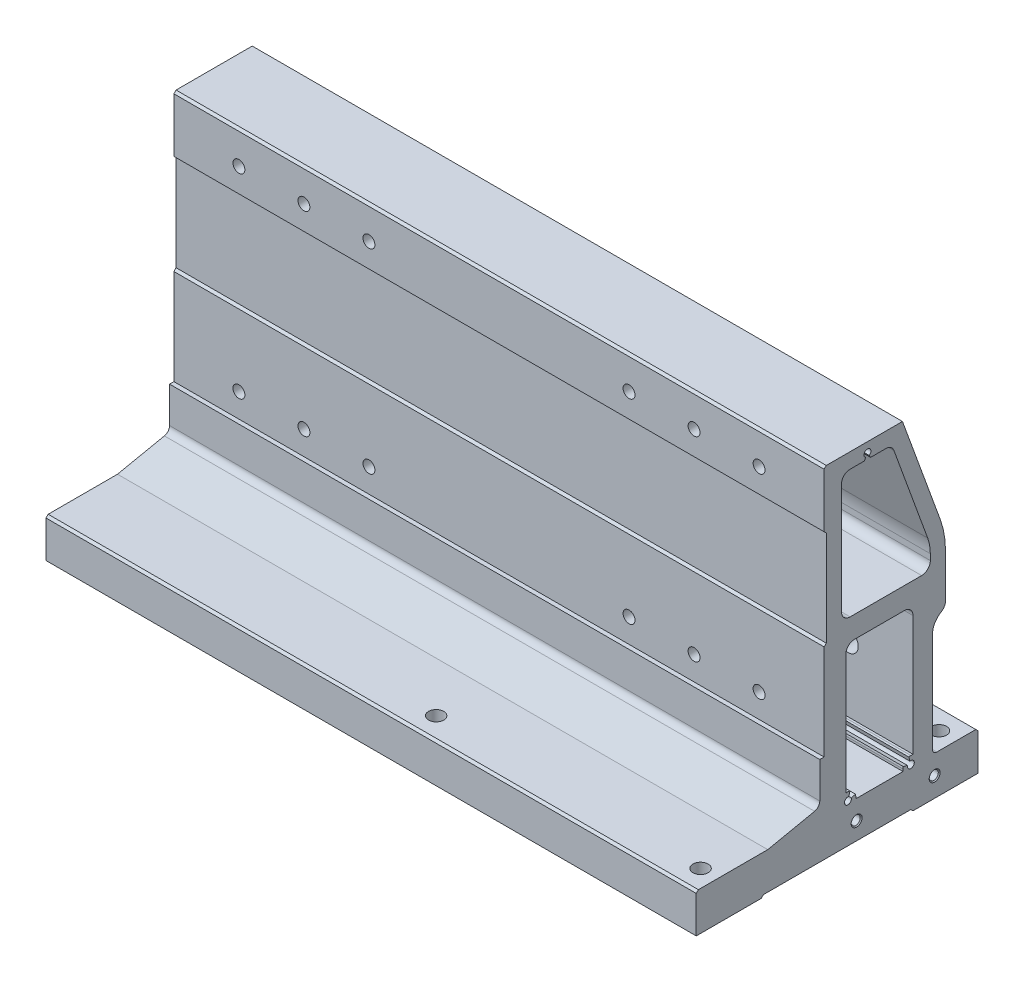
ISO-10303-21;
HEADER;
FILE_DESCRIPTION(('STEP AP214'),'2;1');
FILE_NAME('part.step','',(''),(''),'','','');
FILE_SCHEMA(('AUTOMOTIVE_DESIGN { 1 0 10303 214 1 1 1 1 }'));
ENDSEC;
DATA;
#1=APPLICATION_CONTEXT('core data for automotive mechanical design processes');
#2=APPLICATION_PROTOCOL_DEFINITION('international standard','automotive_design',2000,#1);
#3=PRODUCT_CONTEXT('',#1,'mechanical');
#4=PRODUCT('Part','Part','',(#3));
#5=PRODUCT_RELATED_PRODUCT_CATEGORY('part','',(#4));
#6=PRODUCT_DEFINITION_FORMATION('','',#4);
#7=PRODUCT_DEFINITION_CONTEXT('part definition',#1,'design');
#8=PRODUCT_DEFINITION('design','',#6,#7);
#9=PRODUCT_DEFINITION_SHAPE('','',#8);
#10=(LENGTH_UNIT() NAMED_UNIT(*) SI_UNIT(.MILLI.,.METRE.));
#11=(NAMED_UNIT(*) PLANE_ANGLE_UNIT() SI_UNIT($,.RADIAN.));
#12=(NAMED_UNIT(*) SI_UNIT($,.STERADIAN.) SOLID_ANGLE_UNIT());
#13=UNCERTAINTY_MEASURE_WITH_UNIT(LENGTH_MEASURE(1.E-05),#10,'distance_accuracy_value','');
#14=(GEOMETRIC_REPRESENTATION_CONTEXT(3) GLOBAL_UNCERTAINTY_ASSIGNED_CONTEXT((#13)) GLOBAL_UNIT_ASSIGNED_CONTEXT((#10,
#11,#12)) REPRESENTATION_CONTEXT('',''));
#15=CARTESIAN_POINT('',(0.,0.,0.));
#16=DIRECTION('',(0.,0.,1.));
#17=DIRECTION('',(1.,0.,0.));
#18=AXIS2_PLACEMENT_3D('',#15,#16,#17);
#19=CARTESIAN_POINT('',(150.,24.4394126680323,10.9999999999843));
#20=DIRECTION('',(1.,0.,0.));
#21=DIRECTION('',(0.,0.,-1.));
#22=AXIS2_PLACEMENT_3D('',#19,#20,#21);
#23=PLANE('',#22);
#24=CARTESIAN_POINT('',(150.,8.,-45.0000000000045));
#25=DIRECTION('',(1.,0.,0.));
#26=DIRECTION('',(0.,0.,-1.));
#27=AXIS2_PLACEMENT_3D('',#24,#25,#26);
#28=CIRCLE('',#27,2.525);
#29=CARTESIAN_POINT('',(150.,8.,-47.5250000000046));
#30=VERTEX_POINT('',#29);
#31=EDGE_CURVE('E502',#30,#30,#28,.T.);
#32=ORIENTED_EDGE('',*,*,#31,.F.);
#33=EDGE_LOOP('',(#32));
#34=FACE_BOUND('',#33,.T.);
#35=CARTESIAN_POINT('',(150.,8.,-9.00000000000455));
#36=DIRECTION('',(1.,0.,0.));
#37=DIRECTION('',(0.,0.,-1.));
#38=AXIS2_PLACEMENT_3D('',#35,#36,#37);
#39=CIRCLE('',#38,2.525);
#40=CARTESIAN_POINT('',(150.,8.,-11.5250000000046));
#41=VERTEX_POINT('',#40);
#42=EDGE_CURVE('E511',#41,#41,#39,.T.);
#43=ORIENTED_EDGE('',*,*,#42,.F.);
#44=EDGE_LOOP('',(#43));
#45=FACE_BOUND('',#44,.T.);
#46=DIRECTION('',(0.,0.,1.));
#47=VECTOR('',#46,1.);
#48=CARTESIAN_POINT('',(150.,156.999996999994,-30.1490077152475));
#49=LINE('',#48,#47);
#50=CARTESIAN_POINT('',(150.,156.999996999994,-30.1490077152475));
#51=VERTEX_POINT('',#50);
#52=CARTESIAN_POINT('',(150.,156.999996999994,4.99999999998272));
#53=VERTEX_POINT('',#52);
#54=EDGE_CURVE('E922',#51,#53,#49,.T.);
#55=ORIENTED_EDGE('',*,*,#54,.T.);
#56=DIRECTION('',(0.,-0.707106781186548,0.707106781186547));
#57=VECTOR('',#56,1.);
#58=CARTESIAN_POINT('',(150.,156.999996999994,4.99999999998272));
#59=LINE('',#58,#57);
#60=CARTESIAN_POINT('',(150.,155.999996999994,5.99999999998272));
#61=VERTEX_POINT('',#60);
#62=EDGE_CURVE('E1309',#53,#61,#59,.T.);
#63=ORIENTED_EDGE('',*,*,#62,.T.);
#64=DIRECTION('',(0.,-1.,0.));
#65=VECTOR('',#64,1.);
#66=CARTESIAN_POINT('',(150.,155.999996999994,5.99999999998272));
#67=LINE('',#66,#65);
#68=CARTESIAN_POINT('',(150.,130.999999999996,5.99999999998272));
#69=VERTEX_POINT('',#68);
#70=EDGE_CURVE('E861',#61,#69,#67,.T.);
#71=ORIENTED_EDGE('',*,*,#70,.T.);
#72=DIRECTION('',(0.,-0.707106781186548,-0.707106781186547));
#73=VECTOR('',#72,1.);
#74=CARTESIAN_POINT('',(150.,130.999999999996,5.99999999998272));
#75=LINE('',#74,#73);
#76=CARTESIAN_POINT('',(150.,129.999999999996,4.99999999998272));
#77=VERTEX_POINT('',#76);
#78=EDGE_CURVE('E1312',#69,#77,#75,.T.);
#79=ORIENTED_EDGE('',*,*,#78,.T.);
#80=DIRECTION('',(0.,-1.,0.));
#81=VECTOR('',#80,1.);
#82=CARTESIAN_POINT('',(150.,129.999999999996,4.99999999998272));
#83=LINE('',#82,#81);
#84=CARTESIAN_POINT('',(150.,85.9999999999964,4.99999999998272));
#85=VERTEX_POINT('',#84);
#86=EDGE_CURVE('E1314',#77,#85,#83,.T.);
#87=ORIENTED_EDGE('',*,*,#86,.T.);
#88=DIRECTION('',(0.,-0.707106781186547,0.707106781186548));
#89=VECTOR('',#88,1.);
#90=CARTESIAN_POINT('',(150.,85.9999999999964,4.99999999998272));
#91=LINE('',#90,#89);
#92=CARTESIAN_POINT('',(150.,84.9999999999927,5.99999999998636));
#93=VERTEX_POINT('',#92);
#94=EDGE_CURVE('E1316',#85,#93,#91,.T.);
#95=ORIENTED_EDGE('',*,*,#94,.T.);
#96=DIRECTION('',(0.,-1.,0.));
#97=VECTOR('',#96,1.);
#98=CARTESIAN_POINT('',(150.,84.9999999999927,5.99999999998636));
#99=LINE('',#98,#97);
#100=CARTESIAN_POINT('',(150.,40.9998314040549,5.99999999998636));
#101=VERTEX_POINT('',#100);
#102=EDGE_CURVE('E1318',#93,#101,#99,.T.);
#103=ORIENTED_EDGE('',*,*,#102,.T.);
#104=DIRECTION('',(0.,0.,1.));
#105=VECTOR('',#104,1.);
#106=CARTESIAN_POINT('',(150.,40.9998314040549,5.99999999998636));
#107=LINE('',#106,#105);
#108=CARTESIAN_POINT('',(150.,40.9998314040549,7.99999999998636));
#109=VERTEX_POINT('',#108);
#110=EDGE_CURVE('E1320',#101,#109,#107,.T.);
#111=ORIENTED_EDGE('',*,*,#110,.T.);
#112=DIRECTION('',(0.,-1.,0.));
#113=VECTOR('',#112,1.);
#114=CARTESIAN_POINT('',(150.,40.9998314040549,7.99999999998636));
#115=LINE('',#114,#113);
#116=CARTESIAN_POINT('',(150.,24.4394126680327,7.99999999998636));
#117=VERTEX_POINT('',#116);
#118=EDGE_CURVE('E1322',#109,#117,#115,.T.);
#119=ORIENTED_EDGE('',*,*,#118,.T.);
#120=CARTESIAN_POINT('',(150.,24.4394126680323,10.9999999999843));
#121=DIRECTION('',(-1.,0.,0.));
#122=DIRECTION('',(0.,0.,-1.));
#123=AXIS2_PLACEMENT_3D('',#120,#121,#122);
#124=CIRCLE('',#123,2.9999999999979);
#125=CARTESIAN_POINT('',(150.,21.5024714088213,10.38813723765));
#126=VERTEX_POINT('',#125);
#127=EDGE_CURVE('E1324',#117,#126,#124,.T.);
#128=ORIENTED_EDGE('',*,*,#127,.T.);
#129=DIRECTION('',(0.,-0.203954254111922,0.978980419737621));
#130=VECTOR('',#129,1.);
#131=CARTESIAN_POINT('',(150.,21.5024714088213,10.38813723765));
#132=LINE('',#131,#130);
#133=CARTESIAN_POINT('',(150.,17.,32.0000000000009));
#134=VERTEX_POINT('',#133);
#135=EDGE_CURVE('E1326',#126,#134,#132,.T.);
#136=ORIENTED_EDGE('',*,*,#135,.T.);
#137=DIRECTION('',(0.,0.,1.));
#138=VECTOR('',#137,1.);
#139=CARTESIAN_POINT('',(150.,17.,32.0000000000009));
#140=LINE('',#139,#138);
#141=CARTESIAN_POINT('',(150.,17.,64.0000000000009));
#142=VERTEX_POINT('',#141);
#143=EDGE_CURVE('E1328',#134,#142,#140,.T.);
#144=ORIENTED_EDGE('',*,*,#143,.T.);
#145=DIRECTION('',(0.,-0.707106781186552,0.707106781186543));
#146=VECTOR('',#145,1.);
#147=CARTESIAN_POINT('',(150.,17.,64.0000000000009));
#148=LINE('',#147,#146);
#149=CARTESIAN_POINT('',(150.,16.,65.0000000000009));
#150=VERTEX_POINT('',#149);
#151=EDGE_CURVE('E1330',#142,#150,#148,.T.);
#152=ORIENTED_EDGE('',*,*,#151,.T.);
#153=DIRECTION('',(0.,-1.,0.));
#154=VECTOR('',#153,1.);
#155=CARTESIAN_POINT('',(150.,16.,65.0000000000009));
#156=LINE('',#155,#154);
#157=CARTESIAN_POINT('',(150.,-1.,65.0000000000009));
#158=VERTEX_POINT('',#157);
#159=EDGE_CURVE('E1332',#150,#158,#156,.T.);
#160=ORIENTED_EDGE('',*,*,#159,.T.);
#161=DIRECTION('',(0.,0.,-1.));
#162=VECTOR('',#161,1.);
#163=CARTESIAN_POINT('',(150.,-1.,65.0000000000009));
#164=LINE('',#163,#162);
#165=CARTESIAN_POINT('',(150.,-1.,35.0000000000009));
#166=VERTEX_POINT('',#165);
#167=EDGE_CURVE('E1334',#158,#166,#164,.T.);
#168=ORIENTED_EDGE('',*,*,#167,.T.);
#169=DIRECTION('',(0.,0.707106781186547,-0.707106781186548));
#170=VECTOR('',#169,1.);
#171=CARTESIAN_POINT('',(150.,-1.,35.0000000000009));
#172=LINE('',#171,#170);
#173=CARTESIAN_POINT('',(150.,0.,34.0000000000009));
#174=VERTEX_POINT('',#173);
#175=EDGE_CURVE('E1336',#166,#174,#172,.T.);
#176=ORIENTED_EDGE('',*,*,#175,.T.);
#177=DIRECTION('',(0.,0.,-1.));
#178=VECTOR('',#177,1.);
#179=CARTESIAN_POINT('',(150.,0.,34.0000000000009));
#180=LINE('',#179,#178);
#181=CARTESIAN_POINT('',(150.,0.,-34.0000000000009));
#182=VERTEX_POINT('',#181);
#183=EDGE_CURVE('E1338',#174,#182,#180,.T.);
#184=ORIENTED_EDGE('',*,*,#183,.T.);
#185=DIRECTION('',(0.,-0.707106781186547,-0.707106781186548));
#186=VECTOR('',#185,1.);
#187=CARTESIAN_POINT('',(150.,0.,-34.0000000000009));
#188=LINE('',#187,#186);
#189=CARTESIAN_POINT('',(150.,-1.,-35.0000000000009));
#190=VERTEX_POINT('',#189);
#191=EDGE_CURVE('E1340',#182,#190,#188,.T.);
#192=ORIENTED_EDGE('',*,*,#191,.T.);
#193=DIRECTION('',(0.,0.,-1.));
#194=VECTOR('',#193,1.);
#195=CARTESIAN_POINT('',(150.,-1.,-35.0000000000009));
#196=LINE('',#195,#194);
#197=CARTESIAN_POINT('',(150.,-1.,-65.0000000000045));
#198=VERTEX_POINT('',#197);
#199=EDGE_CURVE('E1342',#190,#198,#196,.T.);
#200=ORIENTED_EDGE('',*,*,#199,.T.);
#201=DIRECTION('',(0.,1.,0.));
#202=VECTOR('',#201,1.);
#203=CARTESIAN_POINT('',(150.,-1.,-65.0000000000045));
#204=LINE('',#203,#202);
#205=CARTESIAN_POINT('',(150.,16.,-65.0000000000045));
#206=VERTEX_POINT('',#205);
#207=EDGE_CURVE('E1344',#198,#206,#204,.T.);
#208=ORIENTED_EDGE('',*,*,#207,.T.);
#209=DIRECTION('',(0.,0.707106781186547,0.707106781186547));
#210=VECTOR('',#209,1.);
#211=CARTESIAN_POINT('',(150.,16.,-65.0000000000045));
#212=LINE('',#211,#210);
#213=CARTESIAN_POINT('',(150.,17.,-64.0000000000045));
#214=VERTEX_POINT('',#213);
#215=EDGE_CURVE('E1346',#206,#214,#212,.T.);
#216=ORIENTED_EDGE('',*,*,#215,.T.);
#217=DIRECTION('',(0.,0.,1.));
#218=VECTOR('',#217,1.);
#219=CARTESIAN_POINT('',(150.,17.,-64.0000000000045));
#220=LINE('',#219,#218);
#221=CARTESIAN_POINT('',(150.,17.,-46.00000000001));
#222=VERTEX_POINT('',#221);
#223=EDGE_CURVE('E1348',#214,#222,#220,.T.);
#224=ORIENTED_EDGE('',*,*,#223,.T.);
#225=CARTESIAN_POINT('',(150.,19.,-46.00000000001));
#226=DIRECTION('',(-1.,0.,0.));
#227=DIRECTION('',(0.,0.,-1.));
#228=AXIS2_PLACEMENT_3D('',#225,#226,#227);
#229=CIRCLE('',#228,2.);
#230=CARTESIAN_POINT('',(150.,19.,-44.00000000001));
#231=VERTEX_POINT('',#230);
#232=EDGE_CURVE('E1350',#222,#231,#229,.T.);
#233=ORIENTED_EDGE('',*,*,#232,.T.);
#234=DIRECTION('',(0.,1.,0.));
#235=VECTOR('',#234,1.);
#236=CARTESIAN_POINT('',(150.,19.,-44.00000000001));
#237=LINE('',#236,#235);
#238=CARTESIAN_POINT('',(150.,65.,-44.00000000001));
#239=VERTEX_POINT('',#238);
#240=EDGE_CURVE('E1352',#231,#239,#237,.T.);
#241=ORIENTED_EDGE('',*,*,#240,.T.);
#242=CARTESIAN_POINT('',(150.,64.9999999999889,-52.0000000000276));
#243=DIRECTION('',(-1.,0.,0.));
#244=DIRECTION('',(0.,0.,-1.));
#245=AXIS2_PLACEMENT_3D('',#242,#243,#244);
#246=CIRCLE('',#245,8.00000000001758);
#247=CARTESIAN_POINT('',(150.,71.9282032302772,-48.0000000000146));
#248=VERTEX_POINT('',#247);
#249=EDGE_CURVE('E1354',#239,#248,#246,.T.);
#250=ORIENTED_EDGE('',*,*,#249,.T.);
#251=CARTESIAN_POINT('',(150.,75.392304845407,-46.0000000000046));
#252=DIRECTION('',(1.,0.,0.));
#253=DIRECTION('',(0.,0.,-1.));
#254=AXIS2_PLACEMENT_3D('',#251,#252,#253);
#255=CIRCLE('',#254,3.99999999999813);
#256=CARTESIAN_POINT('',(150.,75.392304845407,-50.0000000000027));
#257=VERTEX_POINT('',#256);
#258=EDGE_CURVE('E1356',#248,#257,#255,.T.);
#259=ORIENTED_EDGE('',*,*,#258,.T.);
#260=DIRECTION('',(0.,1.,0.));
#261=VECTOR('',#260,1.);
#262=CARTESIAN_POINT('',(150.,75.3923048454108,-50.0000000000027));
#263=LINE('',#262,#261);
#264=CARTESIAN_POINT('',(150.,95.4420377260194,-50.0000000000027));
#265=VERTEX_POINT('',#264);
#266=EDGE_CURVE('E1358',#257,#265,#263,.T.);
#267=ORIENTED_EDGE('',*,*,#266,.T.);
#268=CARTESIAN_POINT('',(150.,95.4420377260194,-9.99999999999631));
#269=DIRECTION('',(1.,0.,0.));
#270=DIRECTION('',(0.,0.,-1.));
#271=AXIS2_PLACEMENT_3D('',#268,#269,#270);
#272=CIRCLE('',#271,40.0000000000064);
#273=CARTESIAN_POINT('',(150.,109.131743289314,-47.5844643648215));
#274=VERTEX_POINT('',#273);
#275=EDGE_CURVE('E1360',#265,#274,#272,.T.);
#276=ORIENTED_EDGE('',*,*,#275,.T.);
#277=DIRECTION('',(0.,0.939611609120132,0.342242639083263));
#278=VECTOR('',#277,1.);
#279=CARTESIAN_POINT('',(150.,109.131743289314,-47.5844643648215));
#280=LINE('',#279,#278);
#281=EDGE_CURVE('E927',#274,#51,#280,.T.);
#282=ORIENTED_EDGE('',*,*,#281,.T.);
#283=EDGE_LOOP('',(#55,#63,#71,#79,#87,#95,#103,#111,#119,#128,#136,#144,#152,#160,#168,#176,
#184,#192,#200,#208,#216,#224,#233,#241,#250,#259,#267,#276,#282));
#284=FACE_BOUND('',#283,.T.);
#285=DIRECTION('',(0.,0.,-1.));
#286=VECTOR('',#285,1.);
#287=CARTESIAN_POINT('',(150.,91.,-39.0000000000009));
#288=LINE('',#287,#286);
#289=CARTESIAN_POINT('',(150.,91.,-6.00000000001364));
#290=VERTEX_POINT('',#289);
#291=CARTESIAN_POINT('',(150.,91.,-39.0000000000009));
#292=VERTEX_POINT('',#291);
#293=EDGE_CURVE('E1204',#290,#292,#288,.T.);
#294=ORIENTED_EDGE('',*,*,#293,.F.);
#295=CARTESIAN_POINT('',(150.,95.,-6.00000000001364));
#296=DIRECTION('',(1.,0.,0.));
#297=DIRECTION('',(0.,0.,-1.));
#298=AXIS2_PLACEMENT_3D('',#295,#296,#297);
#299=CIRCLE('',#298,4.);
#300=CARTESIAN_POINT('',(150.,95.,-2.00000000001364));
#301=VERTEX_POINT('',#300);
#302=EDGE_CURVE('E1202',#301,#290,#299,.T.);
#303=ORIENTED_EDGE('',*,*,#302,.F.);
#304=DIRECTION('',(0.,-1.,0.));
#305=VECTOR('',#304,1.);
#306=CARTESIAN_POINT('',(150.,95.,-2.00000000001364));
#307=LINE('',#306,#305);
#308=CARTESIAN_POINT('',(150.,146.,-2.00000000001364));
#309=VERTEX_POINT('',#308);
#310=EDGE_CURVE('E1230',#309,#301,#307,.T.);
#311=ORIENTED_EDGE('',*,*,#310,.F.);
#312=CARTESIAN_POINT('',(150.,146.,-6.00000000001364));
#313=DIRECTION('',(1.,0.,0.));
#314=DIRECTION('',(0.,0.,-1.));
#315=AXIS2_PLACEMENT_3D('',#312,#313,#314);
#316=CIRCLE('',#315,4.);
#317=CARTESIAN_POINT('',(150.,150.,-6.00000000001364));
#318=VERTEX_POINT('',#317);
#319=EDGE_CURVE('E1227',#318,#309,#316,.T.);
#320=ORIENTED_EDGE('',*,*,#319,.F.);
#321=DIRECTION('',(0.,0.,1.));
#322=VECTOR('',#321,1.);
#323=CARTESIAN_POINT('',(150.,150.,-6.00000000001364));
#324=LINE('',#323,#322);
#325=CARTESIAN_POINT('',(150.,150.,-12.5566260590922));
#326=VERTEX_POINT('',#325);
#327=EDGE_CURVE('E1225',#326,#318,#324,.T.);
#328=ORIENTED_EDGE('',*,*,#327,.F.);
#329=DIRECTION('',(0.,-0.866025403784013,0.500000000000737));
#330=VECTOR('',#329,1.);
#331=CARTESIAN_POINT('',(150.,150.,-12.5566260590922));
#332=LINE('',#331,#330);
#333=CARTESIAN_POINT('',(150.,151.114356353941,-13.2000000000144));
#334=VERTEX_POINT('',#333);
#335=EDGE_CURVE('E1223',#334,#326,#332,.T.);
#336=ORIENTED_EDGE('',*,*,#335,.F.);
#337=CARTESIAN_POINT('',(150.,152.499996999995,-14.0000000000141));
#338=DIRECTION('',(1.,0.,0.));
#339=DIRECTION('',(0.,0.,-1.));
#340=AXIS2_PLACEMENT_3D('',#337,#338,#339);
#341=CIRCLE('',#340,1.59999999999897);
#342=CARTESIAN_POINT('',(150.,151.114356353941,-14.8000000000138));
#343=VERTEX_POINT('',#342);
#344=EDGE_CURVE('E1221',#343,#334,#341,.T.);
#345=ORIENTED_EDGE('',*,*,#344,.F.);
#346=DIRECTION('',(0.,0.866025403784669,0.499999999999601));
#347=VECTOR('',#346,1.);
#348=CARTESIAN_POINT('',(150.,151.114356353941,-14.8000000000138));
#349=LINE('',#348,#347);
#350=CARTESIAN_POINT('',(150.,149.999999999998,-15.4433739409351));
#351=VERTEX_POINT('',#350);
#352=EDGE_CURVE('E1219',#351,#343,#349,.T.);
#353=ORIENTED_EDGE('',*,*,#352,.F.);
#354=DIRECTION('',(0.,0.,1.));
#355=VECTOR('',#354,1.);
#356=CARTESIAN_POINT('',(150.,149.999999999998,-15.4433739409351));
#357=LINE('',#356,#355);
#358=CARTESIAN_POINT('',(150.,149.999999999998,-22.4486643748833));
#359=VERTEX_POINT('',#358);
#360=EDGE_CURVE('E1217',#359,#351,#357,.T.);
#361=ORIENTED_EDGE('',*,*,#360,.F.);
#362=CARTESIAN_POINT('',(150.,146.,-22.448664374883));
#363=DIRECTION('',(1.,0.,0.));
#364=DIRECTION('',(0.,0.,-1.));
#365=AXIS2_PLACEMENT_3D('',#362,#363,#364);
#366=CIRCLE('',#365,3.99999999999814);
#367=CARTESIAN_POINT('',(150.,147.368970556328,-26.2071108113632));
#368=VERTEX_POINT('',#367);
#369=EDGE_CURVE('E1215',#368,#359,#366,.T.);
#370=ORIENTED_EDGE('',*,*,#369,.F.);
#371=DIRECTION('',(0.,0.939611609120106,0.342242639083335));
#372=VECTOR('',#371,1.);
#373=CARTESIAN_POINT('',(150.,147.368970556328,-26.2071108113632));
#374=LINE('',#373,#372);
#375=CARTESIAN_POINT('',(150.,104.580728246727,-41.7922321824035));
#376=VERTEX_POINT('',#375);
#377=EDGE_CURVE('E1213',#376,#368,#374,.T.);
#378=ORIENTED_EDGE('',*,*,#377,.F.);
#379=CARTESIAN_POINT('',(150.,97.7358754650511,-22.9999999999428));
#380=DIRECTION('',(1.,0.,0.));
#381=DIRECTION('',(0.,0.,-1.));
#382=AXIS2_PLACEMENT_3D('',#379,#380,#381);
#383=CIRCLE('',#382,20.0000000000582);
#384=CARTESIAN_POINT('',(150.,97.7358754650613,-43.0000000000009));
#385=VERTEX_POINT('',#384);
#386=EDGE_CURVE('E1211',#385,#376,#383,.T.);
#387=ORIENTED_EDGE('',*,*,#386,.F.);
#388=DIRECTION('',(0.,1.,0.));
#389=VECTOR('',#388,1.);
#390=CARTESIAN_POINT('',(150.,97.7358754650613,-43.0000000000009));
#391=LINE('',#390,#389);
#392=CARTESIAN_POINT('',(150.,95.,-43.0000000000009));
#393=VERTEX_POINT('',#392);
#394=EDGE_CURVE('E1209',#393,#385,#391,.T.);
#395=ORIENTED_EDGE('',*,*,#394,.F.);
#396=CARTESIAN_POINT('',(150.,95.,-39.0000000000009));
#397=DIRECTION('',(1.,0.,0.));
#398=DIRECTION('',(0.,0.,-1.));
#399=AXIS2_PLACEMENT_3D('',#396,#397,#398);
#400=CIRCLE('',#399,4.);
#401=EDGE_CURVE('E1207',#292,#393,#400,.T.);
#402=ORIENTED_EDGE('',*,*,#401,.F.);
#403=EDGE_LOOP('',(#294,#303,#311,#320,#328,#336,#345,#353,#361,#370,#378,#387,#395,#402));
#404=FACE_BOUND('',#403,.T.);
#405=DIRECTION('',(0.,-1.,0.));
#406=VECTOR('',#405,1.);
#407=CARTESIAN_POINT('',(150.,21.5999999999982,-4.00000000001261));
#408=LINE('',#407,#406);
#409=CARTESIAN_POINT('',(150.,76.9999999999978,-4.00000000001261));
#410=VERTEX_POINT('',#409);
#411=CARTESIAN_POINT('',(150.,21.5999999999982,-4.00000000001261));
#412=VERTEX_POINT('',#411);
#413=EDGE_CURVE('E1061',#410,#412,#408,.T.);
#414=ORIENTED_EDGE('',*,*,#413,.F.);
#415=CARTESIAN_POINT('',(150.,76.9999999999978,-8.00000000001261));
#416=DIRECTION('',(1.,0.,0.));
#417=DIRECTION('',(0.,0.,-1.));
#418=AXIS2_PLACEMENT_3D('',#415,#416,#417);
#419=CIRCLE('',#418,4.);
#420=CARTESIAN_POINT('',(150.,80.9999999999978,-8.00000000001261));
#421=VERTEX_POINT('',#420);
#422=EDGE_CURVE('E1059',#421,#410,#419,.T.);
#423=ORIENTED_EDGE('',*,*,#422,.F.);
#424=DIRECTION('',(0.,0.,1.));
#425=VECTOR('',#424,1.);
#426=CARTESIAN_POINT('',(150.,80.9999999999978,-8.00000000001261));
#427=LINE('',#426,#425);
#428=CARTESIAN_POINT('',(150.,80.9999999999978,-31.000000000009));
#429=VERTEX_POINT('',#428);
#430=EDGE_CURVE('E1099',#429,#421,#427,.T.);
#431=ORIENTED_EDGE('',*,*,#430,.F.);
#432=CARTESIAN_POINT('',(150.,76.9999999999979,-31.000000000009));
#433=DIRECTION('',(1.,0.,0.));
#434=DIRECTION('',(0.,0.,-1.));
#435=AXIS2_PLACEMENT_3D('',#432,#433,#434);
#436=CIRCLE('',#435,3.99999999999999);
#437=CARTESIAN_POINT('',(150.,76.9999999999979,-35.000000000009));
#438=VERTEX_POINT('',#437);
#439=EDGE_CURVE('E1096',#438,#429,#436,.T.);
#440=ORIENTED_EDGE('',*,*,#439,.F.);
#441=DIRECTION('',(0.,1.,0.));
#442=VECTOR('',#441,1.);
#443=CARTESIAN_POINT('',(150.,76.9999999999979,-35.000000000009));
#444=LINE('',#443,#442);
#445=CARTESIAN_POINT('',(150.,21.5999999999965,-35.000000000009));
#446=VERTEX_POINT('',#445);
#447=EDGE_CURVE('E1094',#446,#438,#444,.T.);
#448=ORIENTED_EDGE('',*,*,#447,.F.);
#449=DIRECTION('',(0.,0.,-1.));
#450=VECTOR('',#449,1.);
#451=CARTESIAN_POINT('',(150.,21.5999999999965,-35.000000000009));
#452=LINE('',#451,#450);
#453=CARTESIAN_POINT('',(150.,21.5999999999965,-34.0000000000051));
#454=VERTEX_POINT('',#453);
#455=EDGE_CURVE('E1092',#454,#446,#452,.T.);
#456=ORIENTED_EDGE('',*,*,#455,.F.);
#457=CARTESIAN_POINT('',(150.,18.0000000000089,-34.0000000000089));
#458=DIRECTION('',(-1.,0.,0.));
#459=DIRECTION('',(0.,0.,-1.));
#460=AXIS2_PLACEMENT_3D('',#457,#458,#459);
#461=CIRCLE('',#460,3.59999999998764);
#462=CARTESIAN_POINT('',(150.,21.4773329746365,-33.0682514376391));
#463=VERTEX_POINT('',#462);
#464=EDGE_CURVE('E1090',#463,#454,#461,.T.);
#465=ORIENTED_EDGE('',*,*,#464,.F.);
#466=DIRECTION('',(0.,0.96592582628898,0.258819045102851));
#467=VECTOR('',#466,1.);
#468=CARTESIAN_POINT('',(150.,21.4773329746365,-33.0682514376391));
#469=LINE('',#468,#467);
#470=CARTESIAN_POINT('',(150.,19.5454813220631,-33.5858895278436));
#471=VERTEX_POINT('',#470);
#472=EDGE_CURVE('E1088',#471,#463,#469,.T.);
#473=ORIENTED_EDGE('',*,*,#472,.F.);
#474=CARTESIAN_POINT('',(150.,18.0000000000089,-34.0000000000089));
#475=DIRECTION('',(1.,0.,0.));
#476=DIRECTION('',(0.,0.,-1.));
#477=AXIS2_PLACEMENT_3D('',#474,#475,#476);
#478=CIRCLE('',#477,1.5999999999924);
#479=CARTESIAN_POINT('',(150.,18.4141104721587,-32.4545186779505));
#480=VERTEX_POINT('',#479);
#481=EDGE_CURVE('E1086',#480,#471,#478,.T.);
#482=ORIENTED_EDGE('',*,*,#481,.F.);
#483=DIRECTION('',(0.,-0.258819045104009,-0.96592582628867));
#484=VECTOR('',#483,1.);
#485=CARTESIAN_POINT('',(150.,18.4141104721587,-32.4545186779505));
#486=LINE('',#485,#484);
#487=CARTESIAN_POINT('',(150.,18.9317485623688,-30.5226670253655));
#488=VERTEX_POINT('',#487);
#489=EDGE_CURVE('E1084',#488,#480,#486,.T.);
#490=ORIENTED_EDGE('',*,*,#489,.F.);
#491=CARTESIAN_POINT('',(150.,18.0000000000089,-34.0000000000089));
#492=DIRECTION('',(-1.,0.,0.));
#493=DIRECTION('',(0.,0.,-1.));
#494=AXIS2_PLACEMENT_3D('',#491,#492,#493);
#495=CIRCLE('',#494,3.60000000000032);
#496=CARTESIAN_POINT('',(150.,17.9999999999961,-30.4000000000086));
#497=VERTEX_POINT('',#496);
#498=EDGE_CURVE('E1082',#497,#488,#495,.T.);
#499=ORIENTED_EDGE('',*,*,#498,.F.);
#500=DIRECTION('',(0.,1.,0.));
#501=VECTOR('',#500,1.);
#502=CARTESIAN_POINT('',(150.,17.9999999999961,-30.4000000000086));
#503=LINE('',#502,#501);
#504=CARTESIAN_POINT('',(150.,16.9999999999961,-30.4000000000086));
#505=VERTEX_POINT('',#504);
#506=EDGE_CURVE('E1080',#505,#497,#503,.T.);
#507=ORIENTED_EDGE('',*,*,#506,.F.);
#508=DIRECTION('',(0.,0.,-1.));
#509=VECTOR('',#508,1.);
#510=CARTESIAN_POINT('',(150.,16.9999999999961,-30.4000000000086));
#511=LINE('',#510,#509);
#512=CARTESIAN_POINT('',(150.,16.9999999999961,-8.60000000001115));
#513=VERTEX_POINT('',#512);
#514=EDGE_CURVE('E1078',#513,#505,#511,.T.);
#515=ORIENTED_EDGE('',*,*,#514,.F.);
#516=DIRECTION('',(0.,-1.,0.));
#517=VECTOR('',#516,1.);
#518=CARTESIAN_POINT('',(150.,16.9999999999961,-8.60000000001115));
#519=LINE('',#518,#517);
#520=CARTESIAN_POINT('',(150.,17.9999999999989,-8.60000000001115));
#521=VERTEX_POINT('',#520);
#522=EDGE_CURVE('E1076',#521,#513,#519,.T.);
#523=ORIENTED_EDGE('',*,*,#522,.F.);
#524=CARTESIAN_POINT('',(150.,17.9999999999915,-4.99999999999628));
#525=DIRECTION('',(-1.,0.,0.));
#526=DIRECTION('',(0.,0.,-1.));
#527=AXIS2_PLACEMENT_3D('',#524,#525,#526);
#528=CIRCLE('',#527,3.60000000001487);
#529=CARTESIAN_POINT('',(150.,18.9317485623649,-8.47733297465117));
#530=VERTEX_POINT('',#529);
#531=EDGE_CURVE('E1074',#530,#521,#528,.T.);
#532=ORIENTED_EDGE('',*,*,#531,.F.);
#533=DIRECTION('',(0.,0.258819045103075,-0.96592582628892));
#534=VECTOR('',#533,1.);
#535=CARTESIAN_POINT('',(150.,18.9317485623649,-8.47733297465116));
#536=LINE('',#535,#534);
#537=CARTESIAN_POINT('',(150.,18.4141104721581,-6.54548132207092));
#538=VERTEX_POINT('',#537);
#539=EDGE_CURVE('E1072',#538,#530,#536,.T.);
#540=ORIENTED_EDGE('',*,*,#539,.F.);
#541=CARTESIAN_POINT('',(150.,17.9999999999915,-4.99999999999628));
#542=DIRECTION('',(1.,0.,0.));
#543=DIRECTION('',(0.,0.,-1.));
#544=AXIS2_PLACEMENT_3D('',#541,#542,#543);
#545=CIRCLE('',#544,1.60000000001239);
#546=CARTESIAN_POINT('',(150.,19.5454813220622,-5.41411047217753));
#547=VERTEX_POINT('',#546);
#548=EDGE_CURVE('E1070',#547,#538,#545,.T.);
#549=ORIENTED_EDGE('',*,*,#548,.F.);
#550=DIRECTION('',(0.,-0.965925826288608,0.258819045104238));
#551=VECTOR('',#550,1.);
#552=CARTESIAN_POINT('',(150.,19.5454813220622,-5.41411047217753));
#553=LINE('',#552,#551);
#554=CARTESIAN_POINT('',(150.,21.4773329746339,-5.93174856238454));
#555=VERTEX_POINT('',#554);
#556=EDGE_CURVE('E1068',#555,#547,#553,.T.);
#557=ORIENTED_EDGE('',*,*,#556,.F.);
#558=CARTESIAN_POINT('',(150.,17.9999999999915,-4.99999999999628));
#559=DIRECTION('',(-1.,0.,0.));
#560=DIRECTION('',(0.,0.,-1.));
#561=AXIS2_PLACEMENT_3D('',#558,#559,#560);
#562=CIRCLE('',#561,3.60000000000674);
#563=CARTESIAN_POINT('',(150.,21.5999999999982,-5.00000000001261));
#564=VERTEX_POINT('',#563);
#565=EDGE_CURVE('E1066',#564,#555,#562,.T.);
#566=ORIENTED_EDGE('',*,*,#565,.F.);
#567=DIRECTION('',(0.,0.,-1.));
#568=VECTOR('',#567,1.);
#569=CARTESIAN_POINT('',(150.,21.5999999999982,-5.00000000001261));
#570=LINE('',#569,#568);
#571=EDGE_CURVE('E1064',#412,#564,#570,.T.);
#572=ORIENTED_EDGE('',*,*,#571,.F.);
#573=EDGE_LOOP('',(#414,#423,#431,#440,#448,#456,#465,#473,#482,#490,#499,#507,#515,#523,#532,
#540,#549,#557,#566,#572));
#574=FACE_BOUND('',#573,.T.);
#575=ADVANCED_FACE('F37',(#34,#45,#284,#404,#574),#23,.T.);
#576=CARTESIAN_POINT('',(-150.,24.4394126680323,10.9999999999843));
#577=DIRECTION('',(1.,0.,0.));
#578=DIRECTION('',(0.,0.,-1.));
#579=AXIS2_PLACEMENT_3D('',#576,#577,#578);
#580=PLANE('',#579);
#581=CARTESIAN_POINT('',(-150.,95.,-6.00000000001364));
#582=DIRECTION('',(1.,0.,0.));
#583=DIRECTION('',(0.,0.,-1.));
#584=AXIS2_PLACEMENT_3D('',#581,#582,#583);
#585=CIRCLE('',#584,4.);
#586=CARTESIAN_POINT('',(-150.,95.,-2.00000000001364));
#587=VERTEX_POINT('',#586);
#588=CARTESIAN_POINT('',(-150.,91.,-6.00000000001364));
#589=VERTEX_POINT('',#588);
#590=EDGE_CURVE('E1201',#587,#589,#585,.T.);
#591=ORIENTED_EDGE('',*,*,#590,.T.);
#592=DIRECTION('',(0.,0.,-1.));
#593=VECTOR('',#592,1.);
#594=CARTESIAN_POINT('',(-150.,91.,-39.0000000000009));
#595=LINE('',#594,#593);
#596=CARTESIAN_POINT('',(-150.,91.,-39.0000000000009));
#597=VERTEX_POINT('',#596);
#598=EDGE_CURVE('E1235',#589,#597,#595,.T.);
#599=ORIENTED_EDGE('',*,*,#598,.T.);
#600=CARTESIAN_POINT('',(-150.,95.,-39.0000000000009));
#601=DIRECTION('',(1.,0.,0.));
#602=DIRECTION('',(0.,0.,-1.));
#603=AXIS2_PLACEMENT_3D('',#600,#601,#602);
#604=CIRCLE('',#603,4.);
#605=CARTESIAN_POINT('',(-150.,95.,-43.0000000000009));
#606=VERTEX_POINT('',#605);
#607=EDGE_CURVE('E1238',#597,#606,#604,.T.);
#608=ORIENTED_EDGE('',*,*,#607,.T.);
#609=DIRECTION('',(0.,1.,0.));
#610=VECTOR('',#609,1.);
#611=CARTESIAN_POINT('',(-150.,97.7358754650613,-43.0000000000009));
#612=LINE('',#611,#610);
#613=CARTESIAN_POINT('',(-150.,97.7358754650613,-43.0000000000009));
#614=VERTEX_POINT('',#613);
#615=EDGE_CURVE('E1241',#606,#614,#612,.T.);
#616=ORIENTED_EDGE('',*,*,#615,.T.);
#617=CARTESIAN_POINT('',(-150.,97.7358754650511,-22.9999999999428));
#618=DIRECTION('',(1.,0.,0.));
#619=DIRECTION('',(0.,0.,-1.));
#620=AXIS2_PLACEMENT_3D('',#617,#618,#619);
#621=CIRCLE('',#620,20.0000000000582);
#622=CARTESIAN_POINT('',(-150.,104.580728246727,-41.7922321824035));
#623=VERTEX_POINT('',#622);
#624=EDGE_CURVE('E1244',#614,#623,#621,.T.);
#625=ORIENTED_EDGE('',*,*,#624,.T.);
#626=DIRECTION('',(0.,0.939611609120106,0.342242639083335));
#627=VECTOR('',#626,1.);
#628=CARTESIAN_POINT('',(-150.,147.368970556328,-26.2071108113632));
#629=LINE('',#628,#627);
#630=CARTESIAN_POINT('',(-150.,147.368970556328,-26.2071108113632));
#631=VERTEX_POINT('',#630);
#632=EDGE_CURVE('E1247',#623,#631,#629,.T.);
#633=ORIENTED_EDGE('',*,*,#632,.T.);
#634=CARTESIAN_POINT('',(-150.,146.,-22.448664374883));
#635=DIRECTION('',(1.,0.,0.));
#636=DIRECTION('',(0.,0.,-1.));
#637=AXIS2_PLACEMENT_3D('',#634,#635,#636);
#638=CIRCLE('',#637,3.99999999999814);
#639=CARTESIAN_POINT('',(-150.,149.999999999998,-22.4486643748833));
#640=VERTEX_POINT('',#639);
#641=EDGE_CURVE('E1250',#631,#640,#638,.T.);
#642=ORIENTED_EDGE('',*,*,#641,.T.);
#643=DIRECTION('',(0.,0.,1.));
#644=VECTOR('',#643,1.);
#645=CARTESIAN_POINT('',(-150.,149.999999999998,-15.4433739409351));
#646=LINE('',#645,#644);
#647=CARTESIAN_POINT('',(-150.,149.999999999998,-15.4433739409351));
#648=VERTEX_POINT('',#647);
#649=EDGE_CURVE('E1253',#640,#648,#646,.T.);
#650=ORIENTED_EDGE('',*,*,#649,.T.);
#651=DIRECTION('',(0.,0.866025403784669,0.499999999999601));
#652=VECTOR('',#651,1.);
#653=CARTESIAN_POINT('',(-150.,151.114356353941,-14.8000000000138));
#654=LINE('',#653,#652);
#655=CARTESIAN_POINT('',(-150.,151.114356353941,-14.8000000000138));
#656=VERTEX_POINT('',#655);
#657=EDGE_CURVE('E1256',#648,#656,#654,.T.);
#658=ORIENTED_EDGE('',*,*,#657,.T.);
#659=CARTESIAN_POINT('',(-150.,152.499996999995,-14.0000000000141));
#660=DIRECTION('',(1.,0.,0.));
#661=DIRECTION('',(0.,0.,-1.));
#662=AXIS2_PLACEMENT_3D('',#659,#660,#661);
#663=CIRCLE('',#662,1.59999999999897);
#664=CARTESIAN_POINT('',(-150.,151.114356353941,-13.2000000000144));
#665=VERTEX_POINT('',#664);
#666=EDGE_CURVE('E1259',#656,#665,#663,.T.);
#667=ORIENTED_EDGE('',*,*,#666,.T.);
#668=DIRECTION('',(0.,-0.866025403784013,0.500000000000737));
#669=VECTOR('',#668,1.);
#670=CARTESIAN_POINT('',(-150.,150.,-12.5566260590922));
#671=LINE('',#670,#669);
#672=CARTESIAN_POINT('',(-150.,150.,-12.5566260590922));
#673=VERTEX_POINT('',#672);
#674=EDGE_CURVE('E1262',#665,#673,#671,.T.);
#675=ORIENTED_EDGE('',*,*,#674,.T.);
#676=DIRECTION('',(0.,0.,1.));
#677=VECTOR('',#676,1.);
#678=CARTESIAN_POINT('',(-150.,150.,-6.00000000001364));
#679=LINE('',#678,#677);
#680=CARTESIAN_POINT('',(-150.,150.,-6.00000000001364));
#681=VERTEX_POINT('',#680);
#682=EDGE_CURVE('E1265',#673,#681,#679,.T.);
#683=ORIENTED_EDGE('',*,*,#682,.T.);
#684=CARTESIAN_POINT('',(-150.,146.,-6.00000000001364));
#685=DIRECTION('',(1.,0.,0.));
#686=DIRECTION('',(0.,0.,-1.));
#687=AXIS2_PLACEMENT_3D('',#684,#685,#686);
#688=CIRCLE('',#687,4.);
#689=CARTESIAN_POINT('',(-150.,146.,-2.00000000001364));
#690=VERTEX_POINT('',#689);
#691=EDGE_CURVE('E1268',#681,#690,#688,.T.);
#692=ORIENTED_EDGE('',*,*,#691,.T.);
#693=DIRECTION('',(0.,-1.,0.));
#694=VECTOR('',#693,1.);
#695=CARTESIAN_POINT('',(-150.,95.,-2.00000000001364));
#696=LINE('',#695,#694);
#697=EDGE_CURVE('E1205',#690,#587,#696,.T.);
#698=ORIENTED_EDGE('',*,*,#697,.T.);
#699=EDGE_LOOP('',(#591,#599,#608,#616,#625,#633,#642,#650,#658,#667,#675,#683,#692,#698));
#700=FACE_BOUND('',#699,.T.);
#701=DIRECTION('',(0.,0.,1.));
#702=VECTOR('',#701,1.);
#703=CARTESIAN_POINT('',(-150.,156.999996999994,-30.1490077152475));
#704=LINE('',#703,#702);
#705=CARTESIAN_POINT('',(-150.,156.999996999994,-30.1490077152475));
#706=VERTEX_POINT('',#705);
#707=CARTESIAN_POINT('',(-150.,156.999996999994,4.99999999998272));
#708=VERTEX_POINT('',#707);
#709=EDGE_CURVE('E856',#706,#708,#704,.T.);
#710=ORIENTED_EDGE('',*,*,#709,.F.);
#711=DIRECTION('',(0.,0.939611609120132,0.342242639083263));
#712=VECTOR('',#711,1.);
#713=CARTESIAN_POINT('',(-150.,109.131743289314,-47.5844643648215));
#714=LINE('',#713,#712);
#715=CARTESIAN_POINT('',(-150.,109.131743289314,-47.5844643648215));
#716=VERTEX_POINT('',#715);
#717=EDGE_CURVE('E920',#716,#706,#714,.T.);
#718=ORIENTED_EDGE('',*,*,#717,.F.);
#719=CARTESIAN_POINT('',(-150.,95.4420377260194,-9.99999999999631));
#720=DIRECTION('',(1.,0.,0.));
#721=DIRECTION('',(0.,0.,-1.));
#722=AXIS2_PLACEMENT_3D('',#719,#720,#721);
#723=CIRCLE('',#722,40.0000000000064);
#724=CARTESIAN_POINT('',(-150.,95.4420377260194,-50.0000000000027));
#725=VERTEX_POINT('',#724);
#726=EDGE_CURVE('E918',#725,#716,#723,.T.);
#727=ORIENTED_EDGE('',*,*,#726,.F.);
#728=DIRECTION('',(0.,1.,0.));
#729=VECTOR('',#728,1.);
#730=CARTESIAN_POINT('',(-150.,75.3923048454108,-50.0000000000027));
#731=LINE('',#730,#729);
#732=CARTESIAN_POINT('',(-150.,75.392304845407,-50.0000000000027));
#733=VERTEX_POINT('',#732);
#734=EDGE_CURVE('E916',#733,#725,#731,.T.);
#735=ORIENTED_EDGE('',*,*,#734,.F.);
#736=CARTESIAN_POINT('',(-150.,75.392304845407,-46.0000000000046));
#737=DIRECTION('',(1.,0.,0.));
#738=DIRECTION('',(0.,0.,-1.));
#739=AXIS2_PLACEMENT_3D('',#736,#737,#738);
#740=CIRCLE('',#739,3.99999999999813);
#741=CARTESIAN_POINT('',(-150.,71.9282032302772,-48.0000000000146));
#742=VERTEX_POINT('',#741);
#743=EDGE_CURVE('E914',#742,#733,#740,.T.);
#744=ORIENTED_EDGE('',*,*,#743,.F.);
#745=CARTESIAN_POINT('',(-150.,64.9999999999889,-52.0000000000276));
#746=DIRECTION('',(-1.,0.,0.));
#747=DIRECTION('',(0.,0.,-1.));
#748=AXIS2_PLACEMENT_3D('',#745,#746,#747);
#749=CIRCLE('',#748,8.00000000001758);
#750=CARTESIAN_POINT('',(-150.,65.,-44.00000000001));
#751=VERTEX_POINT('',#750);
#752=EDGE_CURVE('E912',#751,#742,#749,.T.);
#753=ORIENTED_EDGE('',*,*,#752,.F.);
#754=DIRECTION('',(0.,1.,0.));
#755=VECTOR('',#754,1.);
#756=CARTESIAN_POINT('',(-150.,19.,-44.00000000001));
#757=LINE('',#756,#755);
#758=CARTESIAN_POINT('',(-150.,19.,-44.00000000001));
#759=VERTEX_POINT('',#758);
#760=EDGE_CURVE('E910',#759,#751,#757,.T.);
#761=ORIENTED_EDGE('',*,*,#760,.F.);
#762=CARTESIAN_POINT('',(-150.,19.,-46.00000000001));
#763=DIRECTION('',(-1.,0.,0.));
#764=DIRECTION('',(0.,0.,-1.));
#765=AXIS2_PLACEMENT_3D('',#762,#763,#764);
#766=CIRCLE('',#765,2.);
#767=CARTESIAN_POINT('',(-150.,17.,-46.00000000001));
#768=VERTEX_POINT('',#767);
#769=EDGE_CURVE('E908',#768,#759,#766,.T.);
#770=ORIENTED_EDGE('',*,*,#769,.F.);
#771=DIRECTION('',(0.,0.,1.));
#772=VECTOR('',#771,1.);
#773=CARTESIAN_POINT('',(-150.,17.,-64.0000000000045));
#774=LINE('',#773,#772);
#775=CARTESIAN_POINT('',(-150.,17.,-64.0000000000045));
#776=VERTEX_POINT('',#775);
#777=EDGE_CURVE('E906',#776,#768,#774,.T.);
#778=ORIENTED_EDGE('',*,*,#777,.F.);
#779=DIRECTION('',(0.,0.707106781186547,0.707106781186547));
#780=VECTOR('',#779,1.);
#781=CARTESIAN_POINT('',(-150.,16.,-65.0000000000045));
#782=LINE('',#781,#780);
#783=CARTESIAN_POINT('',(-150.,16.,-65.0000000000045));
#784=VERTEX_POINT('',#783);
#785=EDGE_CURVE('E904',#784,#776,#782,.T.);
#786=ORIENTED_EDGE('',*,*,#785,.F.);
#787=DIRECTION('',(0.,1.,0.));
#788=VECTOR('',#787,1.);
#789=CARTESIAN_POINT('',(-150.,-1.,-65.0000000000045));
#790=LINE('',#789,#788);
#791=CARTESIAN_POINT('',(-150.,-1.,-65.0000000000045));
#792=VERTEX_POINT('',#791);
#793=EDGE_CURVE('E902',#792,#784,#790,.T.);
#794=ORIENTED_EDGE('',*,*,#793,.F.);
#795=DIRECTION('',(0.,0.,-1.));
#796=VECTOR('',#795,1.);
#797=CARTESIAN_POINT('',(-150.,-1.,-35.0000000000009));
#798=LINE('',#797,#796);
#799=CARTESIAN_POINT('',(-150.,-1.,-35.0000000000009));
#800=VERTEX_POINT('',#799);
#801=EDGE_CURVE('E900',#800,#792,#798,.T.);
#802=ORIENTED_EDGE('',*,*,#801,.F.);
#803=DIRECTION('',(0.,-0.707106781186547,-0.707106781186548));
#804=VECTOR('',#803,1.);
#805=CARTESIAN_POINT('',(-150.,0.,-34.0000000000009));
#806=LINE('',#805,#804);
#807=CARTESIAN_POINT('',(-150.,0.,-34.0000000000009));
#808=VERTEX_POINT('',#807);
#809=EDGE_CURVE('E898',#808,#800,#806,.T.);
#810=ORIENTED_EDGE('',*,*,#809,.F.);
#811=DIRECTION('',(0.,0.,-1.));
#812=VECTOR('',#811,1.);
#813=CARTESIAN_POINT('',(-150.,0.,34.0000000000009));
#814=LINE('',#813,#812);
#815=CARTESIAN_POINT('',(-150.,0.,34.0000000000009));
#816=VERTEX_POINT('',#815);
#817=EDGE_CURVE('E896',#816,#808,#814,.T.);
#818=ORIENTED_EDGE('',*,*,#817,.F.);
#819=DIRECTION('',(0.,0.707106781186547,-0.707106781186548));
#820=VECTOR('',#819,1.);
#821=CARTESIAN_POINT('',(-150.,-1.,35.0000000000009));
#822=LINE('',#821,#820);
#823=CARTESIAN_POINT('',(-150.,-1.,35.0000000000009));
#824=VERTEX_POINT('',#823);
#825=EDGE_CURVE('E894',#824,#816,#822,.T.);
#826=ORIENTED_EDGE('',*,*,#825,.F.);
#827=DIRECTION('',(0.,0.,-1.));
#828=VECTOR('',#827,1.);
#829=CARTESIAN_POINT('',(-150.,-1.,65.0000000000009));
#830=LINE('',#829,#828);
#831=CARTESIAN_POINT('',(-150.,-1.,65.0000000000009));
#832=VERTEX_POINT('',#831);
#833=EDGE_CURVE('E892',#832,#824,#830,.T.);
#834=ORIENTED_EDGE('',*,*,#833,.F.);
#835=DIRECTION('',(0.,-1.,0.));
#836=VECTOR('',#835,1.);
#837=CARTESIAN_POINT('',(-150.,16.,65.0000000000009));
#838=LINE('',#837,#836);
#839=CARTESIAN_POINT('',(-150.,16.,65.0000000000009));
#840=VERTEX_POINT('',#839);
#841=EDGE_CURVE('E890',#840,#832,#838,.T.);
#842=ORIENTED_EDGE('',*,*,#841,.F.);
#843=DIRECTION('',(0.,-0.707106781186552,0.707106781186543));
#844=VECTOR('',#843,1.);
#845=CARTESIAN_POINT('',(-150.,17.,64.0000000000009));
#846=LINE('',#845,#844);
#847=CARTESIAN_POINT('',(-150.,17.,64.0000000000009));
#848=VERTEX_POINT('',#847);
#849=EDGE_CURVE('E888',#848,#840,#846,.T.);
#850=ORIENTED_EDGE('',*,*,#849,.F.);
#851=DIRECTION('',(0.,0.,1.));
#852=VECTOR('',#851,1.);
#853=CARTESIAN_POINT('',(-150.,17.,32.0000000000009));
#854=LINE('',#853,#852);
#855=CARTESIAN_POINT('',(-150.,17.,32.0000000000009));
#856=VERTEX_POINT('',#855);
#857=EDGE_CURVE('E886',#856,#848,#854,.T.);
#858=ORIENTED_EDGE('',*,*,#857,.F.);
#859=DIRECTION('',(0.,-0.203954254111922,0.978980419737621));
#860=VECTOR('',#859,1.);
#861=CARTESIAN_POINT('',(-150.,21.5024714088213,10.38813723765));
#862=LINE('',#861,#860);
#863=CARTESIAN_POINT('',(-150.,21.5024714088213,10.38813723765));
#864=VERTEX_POINT('',#863);
#865=EDGE_CURVE('E884',#864,#856,#862,.T.);
#866=ORIENTED_EDGE('',*,*,#865,.F.);
#867=CARTESIAN_POINT('',(-150.,24.4394126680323,10.9999999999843));
#868=DIRECTION('',(-1.,0.,0.));
#869=DIRECTION('',(0.,0.,-1.));
#870=AXIS2_PLACEMENT_3D('',#867,#868,#869);
#871=CIRCLE('',#870,2.9999999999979);
#872=CARTESIAN_POINT('',(-150.,24.4394126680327,7.99999999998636));
#873=VERTEX_POINT('',#872);
#874=EDGE_CURVE('E882',#873,#864,#871,.T.);
#875=ORIENTED_EDGE('',*,*,#874,.F.);
#876=DIRECTION('',(0.,-1.,0.));
#877=VECTOR('',#876,1.);
#878=CARTESIAN_POINT('',(-150.,40.9998314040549,7.99999999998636));
#879=LINE('',#878,#877);
#880=CARTESIAN_POINT('',(-150.,40.9998314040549,7.99999999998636));
#881=VERTEX_POINT('',#880);
#882=EDGE_CURVE('E880',#881,#873,#879,.T.);
#883=ORIENTED_EDGE('',*,*,#882,.F.);
#884=DIRECTION('',(0.,0.,1.));
#885=VECTOR('',#884,1.);
#886=CARTESIAN_POINT('',(-150.,40.9998314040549,5.99999999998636));
#887=LINE('',#886,#885);
#888=CARTESIAN_POINT('',(-150.,40.9998314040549,5.99999999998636));
#889=VERTEX_POINT('',#888);
#890=EDGE_CURVE('E878',#889,#881,#887,.T.);
#891=ORIENTED_EDGE('',*,*,#890,.F.);
#892=DIRECTION('',(0.,-1.,0.));
#893=VECTOR('',#892,1.);
#894=CARTESIAN_POINT('',(-150.,84.9999999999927,5.99999999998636));
#895=LINE('',#894,#893);
#896=CARTESIAN_POINT('',(-150.,84.9999999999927,5.99999999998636));
#897=VERTEX_POINT('',#896);
#898=EDGE_CURVE('E876',#897,#889,#895,.T.);
#899=ORIENTED_EDGE('',*,*,#898,.F.);
#900=DIRECTION('',(0.,-0.707106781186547,0.707106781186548));
#901=VECTOR('',#900,1.);
#902=CARTESIAN_POINT('',(-150.,85.9999999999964,4.99999999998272));
#903=LINE('',#902,#901);
#904=CARTESIAN_POINT('',(-150.,85.9999999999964,4.99999999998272));
#905=VERTEX_POINT('',#904);
#906=EDGE_CURVE('E874',#905,#897,#903,.T.);
#907=ORIENTED_EDGE('',*,*,#906,.F.);
#908=DIRECTION('',(0.,-1.,0.));
#909=VECTOR('',#908,1.);
#910=CARTESIAN_POINT('',(-150.,129.999999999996,4.99999999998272));
#911=LINE('',#910,#909);
#912=CARTESIAN_POINT('',(-150.,129.999999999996,4.99999999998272));
#913=VERTEX_POINT('',#912);
#914=EDGE_CURVE('E869',#913,#905,#911,.T.);
#915=ORIENTED_EDGE('',*,*,#914,.F.);
#916=DIRECTION('',(0.,-0.707106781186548,-0.707106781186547));
#917=VECTOR('',#916,1.);
#918=CARTESIAN_POINT('',(-150.,130.999999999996,5.99999999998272));
#919=LINE('',#918,#917);
#920=CARTESIAN_POINT('',(-150.,130.999999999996,5.99999999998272));
#921=VERTEX_POINT('',#920);
#922=EDGE_CURVE('E867',#921,#913,#919,.T.);
#923=ORIENTED_EDGE('',*,*,#922,.F.);
#924=DIRECTION('',(0.,-1.,0.));
#925=VECTOR('',#924,1.);
#926=CARTESIAN_POINT('',(-150.,155.999996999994,5.99999999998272));
#927=LINE('',#926,#925);
#928=CARTESIAN_POINT('',(-150.,155.999996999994,5.99999999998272));
#929=VERTEX_POINT('',#928);
#930=EDGE_CURVE('E855',#929,#921,#927,.T.);
#931=ORIENTED_EDGE('',*,*,#930,.F.);
#932=DIRECTION('',(0.,-0.707106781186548,0.707106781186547));
#933=VECTOR('',#932,1.);
#934=CARTESIAN_POINT('',(-150.,156.999996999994,4.99999999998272));
#935=LINE('',#934,#933);
#936=EDGE_CURVE('E846',#708,#929,#935,.T.);
#937=ORIENTED_EDGE('',*,*,#936,.F.);
#938=EDGE_LOOP('',(#710,#718,#727,#735,#744,#753,#761,#770,#778,#786,#794,#802,#810,#818,#826,
#834,#842,#850,#858,#866,#875,#883,#891,#899,#907,#915,#923,#931,#937));
#939=FACE_BOUND('',#938,.T.);
#940=CARTESIAN_POINT('',(-150.,76.9999999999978,-8.00000000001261));
#941=DIRECTION('',(1.,0.,0.));
#942=DIRECTION('',(0.,0.,-1.));
#943=AXIS2_PLACEMENT_3D('',#940,#941,#942);
#944=CIRCLE('',#943,4.);
#945=CARTESIAN_POINT('',(-150.,80.9999999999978,-8.00000000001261));
#946=VERTEX_POINT('',#945);
#947=CARTESIAN_POINT('',(-150.,76.9999999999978,-4.00000000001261));
#948=VERTEX_POINT('',#947);
#949=EDGE_CURVE('E1012',#946,#948,#944,.T.);
#950=ORIENTED_EDGE('',*,*,#949,.T.);
#951=DIRECTION('',(0.,-1.,0.));
#952=VECTOR('',#951,1.);
#953=CARTESIAN_POINT('',(-150.,21.5999999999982,-4.00000000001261));
#954=LINE('',#953,#952);
#955=CARTESIAN_POINT('',(-150.,21.5999999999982,-4.00000000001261));
#956=VERTEX_POINT('',#955);
#957=EDGE_CURVE('E1104',#948,#956,#954,.T.);
#958=ORIENTED_EDGE('',*,*,#957,.T.);
#959=DIRECTION('',(0.,0.,-1.));
#960=VECTOR('',#959,1.);
#961=CARTESIAN_POINT('',(-150.,21.5999999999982,-5.00000000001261));
#962=LINE('',#961,#960);
#963=CARTESIAN_POINT('',(-150.,21.5999999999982,-5.00000000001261));
#964=VERTEX_POINT('',#963);
#965=EDGE_CURVE('E1107',#956,#964,#962,.T.);
#966=ORIENTED_EDGE('',*,*,#965,.T.);
#967=CARTESIAN_POINT('',(-150.,17.9999999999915,-4.99999999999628));
#968=DIRECTION('',(-1.,0.,0.));
#969=DIRECTION('',(0.,0.,-1.));
#970=AXIS2_PLACEMENT_3D('',#967,#968,#969);
#971=CIRCLE('',#970,3.60000000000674);
#972=CARTESIAN_POINT('',(-150.,21.4773329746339,-5.93174856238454));
#973=VERTEX_POINT('',#972);
#974=EDGE_CURVE('E1110',#964,#973,#971,.T.);
#975=ORIENTED_EDGE('',*,*,#974,.T.);
#976=DIRECTION('',(0.,-0.965925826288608,0.258819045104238));
#977=VECTOR('',#976,1.);
#978=CARTESIAN_POINT('',(-150.,19.5454813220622,-5.41411047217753));
#979=LINE('',#978,#977);
#980=CARTESIAN_POINT('',(-150.,19.5454813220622,-5.41411047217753));
#981=VERTEX_POINT('',#980);
#982=EDGE_CURVE('E1113',#973,#981,#979,.T.);
#983=ORIENTED_EDGE('',*,*,#982,.T.);
#984=CARTESIAN_POINT('',(-150.,17.9999999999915,-4.99999999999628));
#985=DIRECTION('',(1.,0.,0.));
#986=DIRECTION('',(0.,0.,-1.));
#987=AXIS2_PLACEMENT_3D('',#984,#985,#986);
#988=CIRCLE('',#987,1.60000000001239);
#989=CARTESIAN_POINT('',(-150.,18.4141104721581,-6.54548132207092));
#990=VERTEX_POINT('',#989);
#991=EDGE_CURVE('E1116',#981,#990,#988,.T.);
#992=ORIENTED_EDGE('',*,*,#991,.T.);
#993=DIRECTION('',(0.,0.258819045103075,-0.96592582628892));
#994=VECTOR('',#993,1.);
#995=CARTESIAN_POINT('',(-150.,18.9317485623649,-8.47733297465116));
#996=LINE('',#995,#994);
#997=CARTESIAN_POINT('',(-150.,18.9317485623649,-8.47733297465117));
#998=VERTEX_POINT('',#997);
#999=EDGE_CURVE('E1119',#990,#998,#996,.T.);
#1000=ORIENTED_EDGE('',*,*,#999,.T.);
#1001=CARTESIAN_POINT('',(-150.,17.9999999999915,-4.99999999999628));
#1002=DIRECTION('',(-1.,0.,0.));
#1003=DIRECTION('',(0.,0.,-1.));
#1004=AXIS2_PLACEMENT_3D('',#1001,#1002,#1003);
#1005=CIRCLE('',#1004,3.60000000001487);
#1006=CARTESIAN_POINT('',(-150.,17.9999999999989,-8.60000000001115));
#1007=VERTEX_POINT('',#1006);
#1008=EDGE_CURVE('E1122',#998,#1007,#1005,.T.);
#1009=ORIENTED_EDGE('',*,*,#1008,.T.);
#1010=DIRECTION('',(0.,-1.,0.));
#1011=VECTOR('',#1010,1.);
#1012=CARTESIAN_POINT('',(-150.,16.9999999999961,-8.60000000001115));
#1013=LINE('',#1012,#1011);
#1014=CARTESIAN_POINT('',(-150.,16.9999999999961,-8.60000000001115));
#1015=VERTEX_POINT('',#1014);
#1016=EDGE_CURVE('E1125',#1007,#1015,#1013,.T.);
#1017=ORIENTED_EDGE('',*,*,#1016,.T.);
#1018=DIRECTION('',(0.,0.,-1.));
#1019=VECTOR('',#1018,1.);
#1020=CARTESIAN_POINT('',(-150.,16.9999999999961,-30.4000000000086));
#1021=LINE('',#1020,#1019);
#1022=CARTESIAN_POINT('',(-150.,16.9999999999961,-30.4000000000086));
#1023=VERTEX_POINT('',#1022);
#1024=EDGE_CURVE('E1128',#1015,#1023,#1021,.T.);
#1025=ORIENTED_EDGE('',*,*,#1024,.T.);
#1026=DIRECTION('',(0.,1.,0.));
#1027=VECTOR('',#1026,1.);
#1028=CARTESIAN_POINT('',(-150.,17.9999999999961,-30.4000000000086));
#1029=LINE('',#1028,#1027);
#1030=CARTESIAN_POINT('',(-150.,17.9999999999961,-30.4000000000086));
#1031=VERTEX_POINT('',#1030);
#1032=EDGE_CURVE('E1131',#1023,#1031,#1029,.T.);
#1033=ORIENTED_EDGE('',*,*,#1032,.T.);
#1034=CARTESIAN_POINT('',(-150.,18.0000000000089,-34.0000000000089));
#1035=DIRECTION('',(-1.,0.,0.));
#1036=DIRECTION('',(0.,0.,-1.));
#1037=AXIS2_PLACEMENT_3D('',#1034,#1035,#1036);
#1038=CIRCLE('',#1037,3.60000000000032);
#1039=CARTESIAN_POINT('',(-150.,18.9317485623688,-30.5226670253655));
#1040=VERTEX_POINT('',#1039);
#1041=EDGE_CURVE('E1134',#1031,#1040,#1038,.T.);
#1042=ORIENTED_EDGE('',*,*,#1041,.T.);
#1043=DIRECTION('',(0.,-0.258819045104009,-0.96592582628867));
#1044=VECTOR('',#1043,1.);
#1045=CARTESIAN_POINT('',(-150.,18.4141104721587,-32.4545186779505));
#1046=LINE('',#1045,#1044);
#1047=CARTESIAN_POINT('',(-150.,18.4141104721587,-32.4545186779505));
#1048=VERTEX_POINT('',#1047);
#1049=EDGE_CURVE('E1137',#1040,#1048,#1046,.T.);
#1050=ORIENTED_EDGE('',*,*,#1049,.T.);
#1051=CARTESIAN_POINT('',(-150.,18.0000000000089,-34.0000000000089));
#1052=DIRECTION('',(1.,0.,0.));
#1053=DIRECTION('',(0.,0.,-1.));
#1054=AXIS2_PLACEMENT_3D('',#1051,#1052,#1053);
#1055=CIRCLE('',#1054,1.5999999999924);
#1056=CARTESIAN_POINT('',(-150.,19.5454813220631,-33.5858895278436));
#1057=VERTEX_POINT('',#1056);
#1058=EDGE_CURVE('E1140',#1048,#1057,#1055,.T.);
#1059=ORIENTED_EDGE('',*,*,#1058,.T.);
#1060=DIRECTION('',(0.,0.96592582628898,0.258819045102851));
#1061=VECTOR('',#1060,1.);
#1062=CARTESIAN_POINT('',(-150.,21.4773329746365,-33.0682514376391));
#1063=LINE('',#1062,#1061);
#1064=CARTESIAN_POINT('',(-150.,21.4773329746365,-33.0682514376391));
#1065=VERTEX_POINT('',#1064);
#1066=EDGE_CURVE('E1143',#1057,#1065,#1063,.T.);
#1067=ORIENTED_EDGE('',*,*,#1066,.T.);
#1068=CARTESIAN_POINT('',(-150.,18.0000000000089,-34.0000000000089));
#1069=DIRECTION('',(-1.,0.,0.));
#1070=DIRECTION('',(0.,0.,-1.));
#1071=AXIS2_PLACEMENT_3D('',#1068,#1069,#1070);
#1072=CIRCLE('',#1071,3.59999999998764);
#1073=CARTESIAN_POINT('',(-150.,21.5999999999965,-34.0000000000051));
#1074=VERTEX_POINT('',#1073);
#1075=EDGE_CURVE('E1146',#1065,#1074,#1072,.T.);
#1076=ORIENTED_EDGE('',*,*,#1075,.T.);
#1077=DIRECTION('',(0.,0.,-1.));
#1078=VECTOR('',#1077,1.);
#1079=CARTESIAN_POINT('',(-150.,21.5999999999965,-35.000000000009));
#1080=LINE('',#1079,#1078);
#1081=CARTESIAN_POINT('',(-150.,21.5999999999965,-35.000000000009));
#1082=VERTEX_POINT('',#1081);
#1083=EDGE_CURVE('E1149',#1074,#1082,#1080,.T.);
#1084=ORIENTED_EDGE('',*,*,#1083,.T.);
#1085=DIRECTION('',(0.,1.,0.));
#1086=VECTOR('',#1085,1.);
#1087=CARTESIAN_POINT('',(-150.,76.9999999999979,-35.000000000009));
#1088=LINE('',#1087,#1086);
#1089=CARTESIAN_POINT('',(-150.,76.9999999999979,-35.000000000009));
#1090=VERTEX_POINT('',#1089);
#1091=EDGE_CURVE('E1152',#1082,#1090,#1088,.T.);
#1092=ORIENTED_EDGE('',*,*,#1091,.T.);
#1093=CARTESIAN_POINT('',(-150.,76.9999999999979,-31.000000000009));
#1094=DIRECTION('',(1.,0.,0.));
#1095=DIRECTION('',(0.,0.,-1.));
#1096=AXIS2_PLACEMENT_3D('',#1093,#1094,#1095);
#1097=CIRCLE('',#1096,3.99999999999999);
#1098=CARTESIAN_POINT('',(-150.,80.9999999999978,-31.000000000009));
#1099=VERTEX_POINT('',#1098);
#1100=EDGE_CURVE('E1155',#1090,#1099,#1097,.T.);
#1101=ORIENTED_EDGE('',*,*,#1100,.T.);
#1102=DIRECTION('',(0.,0.,1.));
#1103=VECTOR('',#1102,1.);
#1104=CARTESIAN_POINT('',(-150.,80.9999999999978,-8.00000000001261));
#1105=LINE('',#1104,#1103);
#1106=EDGE_CURVE('E1062',#1099,#946,#1105,.T.);
#1107=ORIENTED_EDGE('',*,*,#1106,.T.);
#1108=EDGE_LOOP('',(#950,#958,#966,#975,#983,#992,#1000,#1009,#1017,#1025,#1033,#1042,#1050,
#1059,#1067,#1076,#1084,#1092,#1101,#1107));
#1109=FACE_BOUND('',#1108,.T.);
#1110=ADVANCED_FACE('F716',(#700,#939,#1109),#580,.F.);
#1111=CARTESIAN_POINT('',(150.,156.999996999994,-30.1490077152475));
#1112=DIRECTION('',(0.,-1.,0.));
#1113=DIRECTION('',(0.,0.,-1.));
#1114=AXIS2_PLACEMENT_3D('',#1111,#1112,#1113);
#1115=PLANE('',#1114);
#1116=ORIENTED_EDGE('',*,*,#709,.T.);
#1117=DIRECTION('',(-1.,0.,0.));
#1118=VECTOR('',#1117,1.);
#1119=CARTESIAN_POINT('',(150.,156.999996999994,4.99999999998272));
#1120=LINE('',#1119,#1118);
#1121=EDGE_CURVE('E677',#53,#708,#1120,.T.);
#1122=ORIENTED_EDGE('',*,*,#1121,.F.);
#1123=ORIENTED_EDGE('',*,*,#54,.F.);
#1124=DIRECTION('',(-1.,0.,0.));
#1125=VECTOR('',#1124,1.);
#1126=CARTESIAN_POINT('',(150.,156.999996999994,-30.1490077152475));
#1127=LINE('',#1126,#1125);
#1128=EDGE_CURVE('E923',#51,#706,#1127,.T.);
#1129=ORIENTED_EDGE('',*,*,#1128,.T.);
#1130=EDGE_LOOP('',(#1116,#1122,#1123,#1129));
#1131=FACE_BOUND('',#1130,.T.);
#1132=ADVANCED_FACE('F39',(#1131),#1115,.F.);
#1133=CARTESIAN_POINT('',(150.,156.999996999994,4.99999999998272));
#1134=DIRECTION('',(0.,-0.707106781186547,-0.707106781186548));
#1135=DIRECTION('',(0.,0.707106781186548,-0.707106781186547));
#1136=AXIS2_PLACEMENT_3D('',#1133,#1134,#1135);
#1137=PLANE('',#1136);
#1138=ORIENTED_EDGE('',*,*,#936,.T.);
#1139=DIRECTION('',(-1.,0.,0.));
#1140=VECTOR('',#1139,1.);
#1141=CARTESIAN_POINT('',(150.,155.999996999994,5.99999999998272));
#1142=LINE('',#1141,#1140);
#1143=EDGE_CURVE('E848',#61,#929,#1142,.T.);
#1144=ORIENTED_EDGE('',*,*,#1143,.F.);
#1145=ORIENTED_EDGE('',*,*,#62,.F.);
#1146=ORIENTED_EDGE('',*,*,#1121,.T.);
#1147=EDGE_LOOP('',(#1138,#1144,#1145,#1146));
#1148=FACE_BOUND('',#1147,.T.);
#1149=ADVANCED_FACE('F836',(#1148),#1137,.F.);
#1150=CARTESIAN_POINT('',(150.,155.999996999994,5.99999999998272));
#1151=DIRECTION('',(0.,0.,-1.));
#1152=DIRECTION('',(-1.,0.,0.));
#1153=AXIS2_PLACEMENT_3D('',#1150,#1151,#1152);
#1154=PLANE('',#1153);
#1155=CARTESIAN_POINT('',(-60.,142.,5.99999999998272));
#1156=DIRECTION('',(0.,0.,-1.));
#1157=DIRECTION('',(-1.,0.,0.));
#1158=AXIS2_PLACEMENT_3D('',#1155,#1156,#1157);
#1159=CIRCLE('',#1158,2.74999999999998);
#1160=CARTESIAN_POINT('',(-62.75,142.,5.99999999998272));
#1161=VERTEX_POINT('',#1160);
#1162=EDGE_CURVE('E41',#1161,#1161,#1159,.T.);
#1163=ORIENTED_EDGE('',*,*,#1162,.T.);
#1164=EDGE_LOOP('',(#1163));
#1165=FACE_BOUND('',#1164,.T.);
#1166=CARTESIAN_POINT('',(-90.,142.,5.99999999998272));
#1167=DIRECTION('',(0.,0.,-1.));
#1168=DIRECTION('',(-1.,0.,0.));
#1169=AXIS2_PLACEMENT_3D('',#1166,#1167,#1168);
#1170=CIRCLE('',#1169,2.74999999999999);
#1171=CARTESIAN_POINT('',(-92.75,142.,5.99999999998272));
#1172=VERTEX_POINT('',#1171);
#1173=EDGE_CURVE('E546',#1172,#1172,#1170,.T.);
#1174=ORIENTED_EDGE('',*,*,#1173,.T.);
#1175=EDGE_LOOP('',(#1174));
#1176=FACE_BOUND('',#1175,.T.);
#1177=CARTESIAN_POINT('',(-120.,142.,5.99999999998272));
#1178=DIRECTION('',(0.,0.,-1.));
#1179=DIRECTION('',(-1.,0.,0.));
#1180=AXIS2_PLACEMENT_3D('',#1177,#1178,#1179);
#1181=CIRCLE('',#1180,2.74999999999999);
#1182=CARTESIAN_POINT('',(-122.75,142.,5.99999999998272));
#1183=VERTEX_POINT('',#1182);
#1184=EDGE_CURVE('E561',#1183,#1183,#1181,.T.);
#1185=ORIENTED_EDGE('',*,*,#1184,.T.);
#1186=EDGE_LOOP('',(#1185));
#1187=FACE_BOUND('',#1186,.T.);
#1188=CARTESIAN_POINT('',(120.,142.,5.99999999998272));
#1189=DIRECTION('',(0.,0.,-1.));
#1190=DIRECTION('',(-1.,0.,0.));
#1191=AXIS2_PLACEMENT_3D('',#1188,#1189,#1190);
#1192=CIRCLE('',#1191,2.74999999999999);
#1193=CARTESIAN_POINT('',(117.25,142.,5.99999999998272));
#1194=VERTEX_POINT('',#1193);
#1195=EDGE_CURVE('E618',#1194,#1194,#1192,.T.);
#1196=ORIENTED_EDGE('',*,*,#1195,.T.);
#1197=EDGE_LOOP('',(#1196));
#1198=FACE_BOUND('',#1197,.T.);
#1199=CARTESIAN_POINT('',(90.,142.,5.99999999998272));
#1200=DIRECTION('',(0.,0.,-1.));
#1201=DIRECTION('',(-1.,0.,0.));
#1202=AXIS2_PLACEMENT_3D('',#1199,#1200,#1201);
#1203=CIRCLE('',#1202,2.74999999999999);
#1204=CARTESIAN_POINT('',(87.25,142.,5.99999999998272));
#1205=VERTEX_POINT('',#1204);
#1206=EDGE_CURVE('E687',#1205,#1205,#1203,.T.);
#1207=ORIENTED_EDGE('',*,*,#1206,.T.);
#1208=EDGE_LOOP('',(#1207));
#1209=FACE_BOUND('',#1208,.T.);
#1210=CARTESIAN_POINT('',(60.,142.,5.99999999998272));
#1211=DIRECTION('',(0.,0.,-1.));
#1212=DIRECTION('',(-1.,0.,0.));
#1213=AXIS2_PLACEMENT_3D('',#1210,#1211,#1212);
#1214=CIRCLE('',#1213,2.74999999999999);
#1215=CARTESIAN_POINT('',(57.25,142.,5.99999999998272));
#1216=VERTEX_POINT('',#1215);
#1217=EDGE_CURVE('E680',#1216,#1216,#1214,.T.);
#1218=ORIENTED_EDGE('',*,*,#1217,.T.);
#1219=EDGE_LOOP('',(#1218));
#1220=FACE_BOUND('',#1219,.T.);
#1221=ORIENTED_EDGE('',*,*,#930,.T.);
#1222=DIRECTION('',(-1.,0.,0.));
#1223=VECTOR('',#1222,1.);
#1224=CARTESIAN_POINT('',(150.,130.999999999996,5.99999999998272));
#1225=LINE('',#1224,#1223);
#1226=EDGE_CURVE('E862',#69,#921,#1225,.T.);
#1227=ORIENTED_EDGE('',*,*,#1226,.F.);
#1228=ORIENTED_EDGE('',*,*,#70,.F.);
#1229=ORIENTED_EDGE('',*,*,#1143,.T.);
#1230=EDGE_LOOP('',(#1221,#1227,#1228,#1229));
#1231=FACE_BOUND('',#1230,.T.);
#1232=ADVANCED_FACE('F833',(#1165,#1176,#1187,#1198,#1209,#1220,#1231),#1154,.F.);
#1233=CARTESIAN_POINT('',(150.,130.999999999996,5.99999999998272));
#1234=DIRECTION('',(0.,0.707106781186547,-0.707106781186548));
#1235=DIRECTION('',(0.,0.707106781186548,0.707106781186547));
#1236=AXIS2_PLACEMENT_3D('',#1233,#1234,#1235);
#1237=PLANE('',#1236);
#1238=ORIENTED_EDGE('',*,*,#922,.T.);
#1239=DIRECTION('',(-1.,0.,0.));
#1240=VECTOR('',#1239,1.);
#1241=CARTESIAN_POINT('',(150.,129.999999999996,4.99999999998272));
#1242=LINE('',#1241,#1240);
#1243=EDGE_CURVE('E999',#77,#913,#1242,.T.);
#1244=ORIENTED_EDGE('',*,*,#1243,.F.);
#1245=ORIENTED_EDGE('',*,*,#78,.F.);
#1246=ORIENTED_EDGE('',*,*,#1226,.T.);
#1247=EDGE_LOOP('',(#1238,#1244,#1245,#1246));
#1248=FACE_BOUND('',#1247,.T.);
#1249=ADVANCED_FACE('F829',(#1248),#1237,.F.);
#1250=CARTESIAN_POINT('',(150.,129.999999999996,4.99999999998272));
#1251=DIRECTION('',(0.,0.,-1.));
#1252=DIRECTION('',(-1.,0.,0.));
#1253=AXIS2_PLACEMENT_3D('',#1250,#1251,#1252);
#1254=PLANE('',#1253);
#1255=ORIENTED_EDGE('',*,*,#914,.T.);
#1256=DIRECTION('',(-1.,0.,0.));
#1257=VECTOR('',#1256,1.);
#1258=CARTESIAN_POINT('',(150.,85.9999999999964,4.99999999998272));
#1259=LINE('',#1258,#1257);
#1260=EDGE_CURVE('E996',#85,#905,#1259,.T.);
#1261=ORIENTED_EDGE('',*,*,#1260,.F.);
#1262=ORIENTED_EDGE('',*,*,#86,.F.);
#1263=ORIENTED_EDGE('',*,*,#1243,.T.);
#1264=EDGE_LOOP('',(#1255,#1261,#1262,#1263));
#1265=FACE_BOUND('',#1264,.T.);
#1266=ADVANCED_FACE('F825',(#1265),#1254,.F.);
#1267=CARTESIAN_POINT('',(150.,85.9999999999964,4.99999999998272));
#1268=DIRECTION('',(0.,-0.707106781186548,-0.707106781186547));
#1269=DIRECTION('',(0.,0.707106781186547,-0.707106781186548));
#1270=AXIS2_PLACEMENT_3D('',#1267,#1268,#1269);
#1271=PLANE('',#1270);
#1272=ORIENTED_EDGE('',*,*,#906,.T.);
#1273=DIRECTION('',(-1.,0.,0.));
#1274=VECTOR('',#1273,1.);
#1275=CARTESIAN_POINT('',(150.,84.9999999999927,5.99999999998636));
#1276=LINE('',#1275,#1274);
#1277=EDGE_CURVE('E993',#93,#897,#1276,.T.);
#1278=ORIENTED_EDGE('',*,*,#1277,.F.);
#1279=ORIENTED_EDGE('',*,*,#94,.F.);
#1280=ORIENTED_EDGE('',*,*,#1260,.T.);
#1281=EDGE_LOOP('',(#1272,#1278,#1279,#1280));
#1282=FACE_BOUND('',#1281,.T.);
#1283=ADVANCED_FACE('F821',(#1282),#1271,.F.);
#1284=CARTESIAN_POINT('',(150.,84.9999999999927,5.99999999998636));
#1285=DIRECTION('',(0.,0.,-1.));
#1286=DIRECTION('',(-1.,0.,0.));
#1287=AXIS2_PLACEMENT_3D('',#1284,#1285,#1286);
#1288=PLANE('',#1287);
#1289=CARTESIAN_POINT('',(-60.,52.,5.99999999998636));
#1290=DIRECTION('',(0.,0.,-1.));
#1291=DIRECTION('',(-1.,0.,0.));
#1292=AXIS2_PLACEMENT_3D('',#1289,#1290,#1291);
#1293=CIRCLE('',#1292,2.74999999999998);
#1294=CARTESIAN_POINT('',(-62.75,52.,5.99999999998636));
#1295=VERTEX_POINT('',#1294);
#1296=EDGE_CURVE('E575',#1295,#1295,#1293,.T.);
#1297=ORIENTED_EDGE('',*,*,#1296,.T.);
#1298=EDGE_LOOP('',(#1297));
#1299=FACE_BOUND('',#1298,.T.);
#1300=CARTESIAN_POINT('',(-90.,52.,5.99999999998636));
#1301=DIRECTION('',(0.,0.,-1.));
#1302=DIRECTION('',(-1.,0.,0.));
#1303=AXIS2_PLACEMENT_3D('',#1300,#1301,#1302);
#1304=CIRCLE('',#1303,2.74999999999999);
#1305=CARTESIAN_POINT('',(-92.75,52.,5.99999999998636));
#1306=VERTEX_POINT('',#1305);
#1307=EDGE_CURVE('E589',#1306,#1306,#1304,.T.);
#1308=ORIENTED_EDGE('',*,*,#1307,.T.);
#1309=EDGE_LOOP('',(#1308));
#1310=FACE_BOUND('',#1309,.T.);
#1311=CARTESIAN_POINT('',(-120.,52.,5.99999999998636));
#1312=DIRECTION('',(0.,0.,-1.));
#1313=DIRECTION('',(-1.,0.,0.));
#1314=AXIS2_PLACEMENT_3D('',#1311,#1312,#1313);
#1315=CIRCLE('',#1314,2.74999999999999);
#1316=CARTESIAN_POINT('',(-122.75,52.,5.99999999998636));
#1317=VERTEX_POINT('',#1316);
#1318=EDGE_CURVE('E596',#1317,#1317,#1315,.T.);
#1319=ORIENTED_EDGE('',*,*,#1318,.T.);
#1320=EDGE_LOOP('',(#1319));
#1321=FACE_BOUND('',#1320,.T.);
#1322=CARTESIAN_POINT('',(120.,52.,5.99999999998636));
#1323=DIRECTION('',(0.,0.,-1.));
#1324=DIRECTION('',(-1.,0.,0.));
#1325=AXIS2_PLACEMENT_3D('',#1322,#1323,#1324);
#1326=CIRCLE('',#1325,2.74999999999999);
#1327=CARTESIAN_POINT('',(117.25,52.,5.99999999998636));
#1328=VERTEX_POINT('',#1327);
#1329=EDGE_CURVE('E678',#1328,#1328,#1326,.T.);
#1330=ORIENTED_EDGE('',*,*,#1329,.T.);
#1331=EDGE_LOOP('',(#1330));
#1332=FACE_BOUND('',#1331,.T.);
#1333=CARTESIAN_POINT('',(90.,52.,5.99999999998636));
#1334=DIRECTION('',(0.,0.,-1.));
#1335=DIRECTION('',(-1.,0.,0.));
#1336=AXIS2_PLACEMENT_3D('',#1333,#1334,#1335);
#1337=CIRCLE('',#1336,2.74999999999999);
#1338=CARTESIAN_POINT('',(87.25,52.,5.99999999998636));
#1339=VERTEX_POINT('',#1338);
#1340=EDGE_CURVE('E1014',#1339,#1339,#1337,.T.);
#1341=ORIENTED_EDGE('',*,*,#1340,.T.);
#1342=EDGE_LOOP('',(#1341));
#1343=FACE_BOUND('',#1342,.T.);
#1344=CARTESIAN_POINT('',(60.,52.,5.99999999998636));
#1345=DIRECTION('',(0.,0.,-1.));
#1346=DIRECTION('',(-1.,0.,0.));
#1347=AXIS2_PLACEMENT_3D('',#1344,#1345,#1346);
#1348=CIRCLE('',#1347,2.74999999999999);
#1349=CARTESIAN_POINT('',(57.25,52.,5.99999999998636));
#1350=VERTEX_POINT('',#1349);
#1351=EDGE_CURVE('E1009',#1350,#1350,#1348,.T.);
#1352=ORIENTED_EDGE('',*,*,#1351,.T.);
#1353=EDGE_LOOP('',(#1352));
#1354=FACE_BOUND('',#1353,.T.);
#1355=ORIENTED_EDGE('',*,*,#898,.T.);
#1356=DIRECTION('',(-1.,0.,0.));
#1357=VECTOR('',#1356,1.);
#1358=CARTESIAN_POINT('',(150.,40.9998314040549,5.99999999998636));
#1359=LINE('',#1358,#1357);
#1360=EDGE_CURVE('E990',#101,#889,#1359,.T.);
#1361=ORIENTED_EDGE('',*,*,#1360,.F.);
#1362=ORIENTED_EDGE('',*,*,#102,.F.);
#1363=ORIENTED_EDGE('',*,*,#1277,.T.);
#1364=EDGE_LOOP('',(#1355,#1361,#1362,#1363));
#1365=FACE_BOUND('',#1364,.T.);
#1366=ADVANCED_FACE('F817',(#1299,#1310,#1321,#1332,#1343,#1354,#1365),#1288,.F.);
#1367=CARTESIAN_POINT('',(150.,40.9998314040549,5.99999999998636));
#1368=DIRECTION('',(0.,-1.,0.));
#1369=DIRECTION('',(0.,0.,-1.));
#1370=AXIS2_PLACEMENT_3D('',#1367,#1368,#1369);
#1371=PLANE('',#1370);
#1372=ORIENTED_EDGE('',*,*,#890,.T.);
#1373=DIRECTION('',(-1.,0.,0.));
#1374=VECTOR('',#1373,1.);
#1375=CARTESIAN_POINT('',(150.,40.9998314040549,7.99999999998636));
#1376=LINE('',#1375,#1374);
#1377=EDGE_CURVE('E987',#109,#881,#1376,.T.);
#1378=ORIENTED_EDGE('',*,*,#1377,.F.);
#1379=ORIENTED_EDGE('',*,*,#110,.F.);
#1380=ORIENTED_EDGE('',*,*,#1360,.T.);
#1381=EDGE_LOOP('',(#1372,#1378,#1379,#1380));
#1382=FACE_BOUND('',#1381,.T.);
#1383=ADVANCED_FACE('F813',(#1382),#1371,.F.);
#1384=CARTESIAN_POINT('',(150.,40.9998314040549,7.99999999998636));
#1385=DIRECTION('',(0.,0.,-1.));
#1386=DIRECTION('',(-1.,0.,0.));
#1387=AXIS2_PLACEMENT_3D('',#1384,#1385,#1386);
#1388=PLANE('',#1387);
#1389=ORIENTED_EDGE('',*,*,#882,.T.);
#1390=DIRECTION('',(-1.,0.,0.));
#1391=VECTOR('',#1390,1.);
#1392=CARTESIAN_POINT('',(150.,24.4394126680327,7.99999999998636));
#1393=LINE('',#1392,#1391);
#1394=EDGE_CURVE('E984',#117,#873,#1393,.T.);
#1395=ORIENTED_EDGE('',*,*,#1394,.F.);
#1396=ORIENTED_EDGE('',*,*,#118,.F.);
#1397=ORIENTED_EDGE('',*,*,#1377,.T.);
#1398=EDGE_LOOP('',(#1389,#1395,#1396,#1397));
#1399=FACE_BOUND('',#1398,.T.);
#1400=ADVANCED_FACE('F809',(#1399),#1388,.F.);
#1401=CARTESIAN_POINT('',(150.,24.4394126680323,10.9999999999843));
#1402=DIRECTION('',(-1.,0.,0.));
#1403=DIRECTION('',(0.,0.,1.));
#1404=AXIS2_PLACEMENT_3D('',#1401,#1402,#1403);
#1405=CYLINDRICAL_SURFACE('',#1404,2.9999999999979);
#1406=ORIENTED_EDGE('',*,*,#874,.T.);
#1407=DIRECTION('',(-1.,0.,0.));
#1408=VECTOR('',#1407,1.);
#1409=CARTESIAN_POINT('',(150.,21.5024714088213,10.38813723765));
#1410=LINE('',#1409,#1408);
#1411=EDGE_CURVE('E981',#126,#864,#1410,.T.);
#1412=ORIENTED_EDGE('',*,*,#1411,.F.);
#1413=ORIENTED_EDGE('',*,*,#127,.F.);
#1414=ORIENTED_EDGE('',*,*,#1394,.T.);
#1415=EDGE_LOOP('',(#1406,#1412,#1413,#1414));
#1416=FACE_BOUND('',#1415,.T.);
#1417=ADVANCED_FACE('F805',(#1416),#1405,.F.);
#1418=CARTESIAN_POINT('',(150.,21.5024714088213,10.38813723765));
#1419=DIRECTION('',(0.,-0.978980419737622,-0.203954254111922));
#1420=DIRECTION('',(0.,0.203954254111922,-0.978980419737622));
#1421=AXIS2_PLACEMENT_3D('',#1418,#1419,#1420);
#1422=PLANE('',#1421);
#1423=ORIENTED_EDGE('',*,*,#865,.T.);
#1424=DIRECTION('',(-1.,0.,0.));
#1425=VECTOR('',#1424,1.);
#1426=CARTESIAN_POINT('',(150.,17.,32.0000000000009));
#1427=LINE('',#1426,#1425);
#1428=EDGE_CURVE('E978',#134,#856,#1427,.T.);
#1429=ORIENTED_EDGE('',*,*,#1428,.F.);
#1430=ORIENTED_EDGE('',*,*,#135,.F.);
#1431=ORIENTED_EDGE('',*,*,#1411,.T.);
#1432=EDGE_LOOP('',(#1423,#1429,#1430,#1431));
#1433=FACE_BOUND('',#1432,.T.);
#1434=ADVANCED_FACE('F801',(#1433),#1422,.F.);
#1435=CARTESIAN_POINT('',(150.,17.,32.0000000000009));
#1436=DIRECTION('',(0.,-1.,0.));
#1437=DIRECTION('',(0.,0.,-1.));
#1438=AXIS2_PLACEMENT_3D('',#1435,#1436,#1437);
#1439=PLANE('',#1438);
#1440=CARTESIAN_POINT('',(142.,17.,54.9999999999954));
#1441=DIRECTION('',(0.,-1.,0.));
#1442=DIRECTION('',(0.,0.,-1.));
#1443=AXIS2_PLACEMENT_3D('',#1440,#1441,#1442);
#1444=CIRCLE('',#1443,3.49999999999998);
#1445=CARTESIAN_POINT('',(142.,17.,51.4999999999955));
#1446=VERTEX_POINT('',#1445);
#1447=EDGE_CURVE('E2749',#1446,#1446,#1444,.T.);
#1448=ORIENTED_EDGE('',*,*,#1447,.T.);
#1449=EDGE_LOOP('',(#1448));
#1450=FACE_BOUND('',#1449,.T.);
#1451=CARTESIAN_POINT('',(20.,17.,54.9999999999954));
#1452=DIRECTION('',(0.,-1.,0.));
#1453=DIRECTION('',(0.,0.,-1.));
#1454=AXIS2_PLACEMENT_3D('',#1451,#1452,#1453);
#1455=CIRCLE('',#1454,3.49999999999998);
#1456=CARTESIAN_POINT('',(20.,17.,51.4999999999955));
#1457=VERTEX_POINT('',#1456);
#1458=EDGE_CURVE('E2753',#1457,#1457,#1455,.T.);
#1459=ORIENTED_EDGE('',*,*,#1458,.T.);
#1460=EDGE_LOOP('',(#1459));
#1461=FACE_BOUND('',#1460,.T.);
#1462=ORIENTED_EDGE('',*,*,#857,.T.);
#1463=DIRECTION('',(-1.,0.,0.));
#1464=VECTOR('',#1463,1.);
#1465=CARTESIAN_POINT('',(150.,17.,64.0000000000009));
#1466=LINE('',#1465,#1464);
#1467=EDGE_CURVE('E975',#142,#848,#1466,.T.);
#1468=ORIENTED_EDGE('',*,*,#1467,.F.);
#1469=ORIENTED_EDGE('',*,*,#143,.F.);
#1470=ORIENTED_EDGE('',*,*,#1428,.T.);
#1471=EDGE_LOOP('',(#1462,#1468,#1469,#1470));
#1472=FACE_BOUND('',#1471,.T.);
#1473=ADVANCED_FACE('F797',(#1450,#1461,#1472),#1439,.F.);
#1474=CARTESIAN_POINT('',(150.,17.,64.0000000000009));
#1475=DIRECTION('',(0.,-0.707106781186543,-0.707106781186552));
#1476=DIRECTION('',(0.,0.707106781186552,-0.707106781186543));
#1477=AXIS2_PLACEMENT_3D('',#1474,#1475,#1476);
#1478=PLANE('',#1477);
#1479=ORIENTED_EDGE('',*,*,#849,.T.);
#1480=DIRECTION('',(-1.,0.,0.));
#1481=VECTOR('',#1480,1.);
#1482=CARTESIAN_POINT('',(150.,16.,65.0000000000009));
#1483=LINE('',#1482,#1481);
#1484=EDGE_CURVE('E972',#150,#840,#1483,.T.);
#1485=ORIENTED_EDGE('',*,*,#1484,.F.);
#1486=ORIENTED_EDGE('',*,*,#151,.F.);
#1487=ORIENTED_EDGE('',*,*,#1467,.T.);
#1488=EDGE_LOOP('',(#1479,#1485,#1486,#1487));
#1489=FACE_BOUND('',#1488,.T.);
#1490=ADVANCED_FACE('F793',(#1489),#1478,.F.);
#1491=CARTESIAN_POINT('',(150.,16.,65.0000000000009));
#1492=DIRECTION('',(0.,0.,-1.));
#1493=DIRECTION('',(-1.,0.,0.));
#1494=AXIS2_PLACEMENT_3D('',#1491,#1492,#1493);
#1495=PLANE('',#1494);
#1496=ORIENTED_EDGE('',*,*,#841,.T.);
#1497=DIRECTION('',(-1.,0.,0.));
#1498=VECTOR('',#1497,1.);
#1499=CARTESIAN_POINT('',(150.,-1.,65.0000000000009));
#1500=LINE('',#1499,#1498);
#1501=EDGE_CURVE('E969',#158,#832,#1500,.T.);
#1502=ORIENTED_EDGE('',*,*,#1501,.F.);
#1503=ORIENTED_EDGE('',*,*,#159,.F.);
#1504=ORIENTED_EDGE('',*,*,#1484,.T.);
#1505=EDGE_LOOP('',(#1496,#1502,#1503,#1504));
#1506=FACE_BOUND('',#1505,.T.);
#1507=ADVANCED_FACE('F789',(#1506),#1495,.F.);
#1508=CARTESIAN_POINT('',(150.,-1.,65.0000000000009));
#1509=DIRECTION('',(0.,1.,0.));
#1510=DIRECTION('',(0.,0.,1.));
#1511=AXIS2_PLACEMENT_3D('',#1508,#1509,#1510);
#1512=PLANE('',#1511);
#1513=CARTESIAN_POINT('',(142.,-1.,54.9999999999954));
#1514=DIRECTION('',(0.,-1.,0.));
#1515=DIRECTION('',(0.,0.,-1.));
#1516=AXIS2_PLACEMENT_3D('',#1513,#1514,#1515);
#1517=CIRCLE('',#1516,3.49999999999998);
#1518=CARTESIAN_POINT('',(142.,-1.,51.4999999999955));
#1519=VERTEX_POINT('',#1518);
#1520=EDGE_CURVE('E2746',#1519,#1519,#1517,.T.);
#1521=ORIENTED_EDGE('',*,*,#1520,.F.);
#1522=EDGE_LOOP('',(#1521));
#1523=FACE_BOUND('',#1522,.T.);
#1524=CARTESIAN_POINT('',(20.,-1.,54.9999999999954));
#1525=DIRECTION('',(0.,-1.,0.));
#1526=DIRECTION('',(0.,0.,-1.));
#1527=AXIS2_PLACEMENT_3D('',#1524,#1525,#1526);
#1528=CIRCLE('',#1527,3.49999999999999);
#1529=CARTESIAN_POINT('',(20.,-1.,51.4999999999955));
#1530=VERTEX_POINT('',#1529);
#1531=EDGE_CURVE('E2750',#1530,#1530,#1528,.T.);
#1532=ORIENTED_EDGE('',*,*,#1531,.F.);
#1533=EDGE_LOOP('',(#1532));
#1534=FACE_BOUND('',#1533,.T.);
#1535=ORIENTED_EDGE('',*,*,#833,.T.);
#1536=DIRECTION('',(-1.,0.,0.));
#1537=VECTOR('',#1536,1.);
#1538=CARTESIAN_POINT('',(150.,-1.,35.0000000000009));
#1539=LINE('',#1538,#1537);
#1540=EDGE_CURVE('E966',#166,#824,#1539,.T.);
#1541=ORIENTED_EDGE('',*,*,#1540,.F.);
#1542=ORIENTED_EDGE('',*,*,#167,.F.);
#1543=ORIENTED_EDGE('',*,*,#1501,.T.);
#1544=EDGE_LOOP('',(#1535,#1541,#1542,#1543));
#1545=FACE_BOUND('',#1544,.T.);
#1546=ADVANCED_FACE('F785',(#1523,#1534,#1545),#1512,.F.);
#1547=CARTESIAN_POINT('',(150.,-1.,35.0000000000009));
#1548=DIRECTION('',(0.,0.707106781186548,0.707106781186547));
#1549=DIRECTION('',(0.,-0.707106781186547,0.707106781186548));
#1550=AXIS2_PLACEMENT_3D('',#1547,#1548,#1549);
#1551=PLANE('',#1550);
#1552=ORIENTED_EDGE('',*,*,#825,.T.);
#1553=DIRECTION('',(-1.,0.,0.));
#1554=VECTOR('',#1553,1.);
#1555=CARTESIAN_POINT('',(150.,0.,34.0000000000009));
#1556=LINE('',#1555,#1554);
#1557=EDGE_CURVE('E963',#174,#816,#1556,.T.);
#1558=ORIENTED_EDGE('',*,*,#1557,.F.);
#1559=ORIENTED_EDGE('',*,*,#175,.F.);
#1560=ORIENTED_EDGE('',*,*,#1540,.T.);
#1561=EDGE_LOOP('',(#1552,#1558,#1559,#1560));
#1562=FACE_BOUND('',#1561,.T.);
#1563=ADVANCED_FACE('F781',(#1562),#1551,.F.);
#1564=CARTESIAN_POINT('',(150.,0.,34.0000000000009));
#1565=DIRECTION('',(0.,1.,0.));
#1566=DIRECTION('',(0.,0.,1.));
#1567=AXIS2_PLACEMENT_3D('',#1564,#1565,#1566);
#1568=PLANE('',#1567);
#1569=CARTESIAN_POINT('',(142.,0.,0.));
#1570=DIRECTION('',(0.,-1.,0.));
#1571=DIRECTION('',(0.,0.,-1.));
#1572=AXIS2_PLACEMENT_3D('',#1569,#1570,#1571);
#1573=CIRCLE('',#1572,2.5);
#1574=CARTESIAN_POINT('',(142.,0.,-2.50000000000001));
#1575=VERTEX_POINT('',#1574);
#1576=EDGE_CURVE('E490',#1575,#1575,#1573,.T.);
#1577=ORIENTED_EDGE('',*,*,#1576,.F.);
#1578=EDGE_LOOP('',(#1577));
#1579=FACE_BOUND('',#1578,.T.);
#1580=CARTESIAN_POINT('',(20.,0.,0.));
#1581=DIRECTION('',(0.,-1.,0.));
#1582=DIRECTION('',(0.,0.,-1.));
#1583=AXIS2_PLACEMENT_3D('',#1580,#1581,#1582);
#1584=CIRCLE('',#1583,2.5);
#1585=CARTESIAN_POINT('',(20.,0.,-2.50000000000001));
#1586=VERTEX_POINT('',#1585);
#1587=EDGE_CURVE('E489',#1586,#1586,#1584,.T.);
#1588=ORIENTED_EDGE('',*,*,#1587,.F.);
#1589=EDGE_LOOP('',(#1588));
#1590=FACE_BOUND('',#1589,.T.);
#1591=ORIENTED_EDGE('',*,*,#817,.T.);
#1592=DIRECTION('',(-1.,0.,0.));
#1593=VECTOR('',#1592,1.);
#1594=CARTESIAN_POINT('',(150.,0.,-34.0000000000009));
#1595=LINE('',#1594,#1593);
#1596=EDGE_CURVE('E960',#182,#808,#1595,.T.);
#1597=ORIENTED_EDGE('',*,*,#1596,.F.);
#1598=ORIENTED_EDGE('',*,*,#183,.F.);
#1599=ORIENTED_EDGE('',*,*,#1557,.T.);
#1600=EDGE_LOOP('',(#1591,#1597,#1598,#1599));
#1601=FACE_BOUND('',#1600,.T.);
#1602=ADVANCED_FACE('F777',(#1579,#1590,#1601),#1568,.F.);
#1603=CARTESIAN_POINT('',(150.,0.,-34.0000000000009));
#1604=DIRECTION('',(0.,0.707106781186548,-0.707106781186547));
#1605=DIRECTION('',(0.,0.707106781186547,0.707106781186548));
#1606=AXIS2_PLACEMENT_3D('',#1603,#1604,#1605);
#1607=PLANE('',#1606);
#1608=ORIENTED_EDGE('',*,*,#809,.T.);
#1609=DIRECTION('',(-1.,0.,0.));
#1610=VECTOR('',#1609,1.);
#1611=CARTESIAN_POINT('',(150.,-1.,-35.0000000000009));
#1612=LINE('',#1611,#1610);
#1613=EDGE_CURVE('E957',#190,#800,#1612,.T.);
#1614=ORIENTED_EDGE('',*,*,#1613,.F.);
#1615=ORIENTED_EDGE('',*,*,#191,.F.);
#1616=ORIENTED_EDGE('',*,*,#1596,.T.);
#1617=EDGE_LOOP('',(#1608,#1614,#1615,#1616));
#1618=FACE_BOUND('',#1617,.T.);
#1619=ADVANCED_FACE('F773',(#1618),#1607,.F.);
#1620=CARTESIAN_POINT('',(150.,-1.,-35.0000000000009));
#1621=DIRECTION('',(0.,1.,0.));
#1622=DIRECTION('',(0.,0.,1.));
#1623=AXIS2_PLACEMENT_3D('',#1620,#1621,#1622);
#1624=PLANE('',#1623);
#1625=CARTESIAN_POINT('',(20.,-1.,-55.0000000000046));
#1626=DIRECTION('',(0.,-1.,0.));
#1627=DIRECTION('',(0.,0.,-1.));
#1628=AXIS2_PLACEMENT_3D('',#1625,#1626,#1627);
#1629=CIRCLE('',#1628,3.49999999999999);
#1630=CARTESIAN_POINT('',(20.,-1.,-58.5000000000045));
#1631=VERTEX_POINT('',#1630);
#1632=EDGE_CURVE('E2759',#1631,#1631,#1629,.T.);
#1633=ORIENTED_EDGE('',*,*,#1632,.F.);
#1634=EDGE_LOOP('',(#1633));
#1635=FACE_BOUND('',#1634,.T.);
#1636=CARTESIAN_POINT('',(142.,-1.,-55.0000000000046));
#1637=DIRECTION('',(0.,-1.,0.));
#1638=DIRECTION('',(0.,0.,-1.));
#1639=AXIS2_PLACEMENT_3D('',#1636,#1637,#1638);
#1640=CIRCLE('',#1639,3.49999999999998);
#1641=CARTESIAN_POINT('',(142.,-1.,-58.5000000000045));
#1642=VERTEX_POINT('',#1641);
#1643=EDGE_CURVE('E2765',#1642,#1642,#1640,.T.);
#1644=ORIENTED_EDGE('',*,*,#1643,.F.);
#1645=EDGE_LOOP('',(#1644));
#1646=FACE_BOUND('',#1645,.T.);
#1647=ORIENTED_EDGE('',*,*,#801,.T.);
#1648=DIRECTION('',(-1.,0.,0.));
#1649=VECTOR('',#1648,1.);
#1650=CARTESIAN_POINT('',(150.,-1.,-65.0000000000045));
#1651=LINE('',#1650,#1649);
#1652=EDGE_CURVE('E954',#198,#792,#1651,.T.);
#1653=ORIENTED_EDGE('',*,*,#1652,.F.);
#1654=ORIENTED_EDGE('',*,*,#199,.F.);
#1655=ORIENTED_EDGE('',*,*,#1613,.T.);
#1656=EDGE_LOOP('',(#1647,#1653,#1654,#1655));
#1657=FACE_BOUND('',#1656,.T.);
#1658=ADVANCED_FACE('F769',(#1635,#1646,#1657),#1624,.F.);
#1659=CARTESIAN_POINT('',(150.,-1.,-65.0000000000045));
#1660=DIRECTION('',(0.,0.,1.));
#1661=DIRECTION('',(1.,0.,0.));
#1662=AXIS2_PLACEMENT_3D('',#1659,#1660,#1661);
#1663=PLANE('',#1662);
#1664=ORIENTED_EDGE('',*,*,#793,.T.);
#1665=DIRECTION('',(-1.,0.,0.));
#1666=VECTOR('',#1665,1.);
#1667=CARTESIAN_POINT('',(150.,16.,-65.0000000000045));
#1668=LINE('',#1667,#1666);
#1669=EDGE_CURVE('E951',#206,#784,#1668,.T.);
#1670=ORIENTED_EDGE('',*,*,#1669,.F.);
#1671=ORIENTED_EDGE('',*,*,#207,.F.);
#1672=ORIENTED_EDGE('',*,*,#1652,.T.);
#1673=EDGE_LOOP('',(#1664,#1670,#1671,#1672));
#1674=FACE_BOUND('',#1673,.T.);
#1675=ADVANCED_FACE('F765',(#1674),#1663,.F.);
#1676=CARTESIAN_POINT('',(150.,16.,-65.0000000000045));
#1677=DIRECTION('',(0.,-0.707106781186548,0.707106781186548));
#1678=DIRECTION('',(0.,-0.707106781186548,-0.707106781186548));
#1679=AXIS2_PLACEMENT_3D('',#1676,#1677,#1678);
#1680=PLANE('',#1679);
#1681=ORIENTED_EDGE('',*,*,#785,.T.);
#1682=DIRECTION('',(-1.,0.,0.));
#1683=VECTOR('',#1682,1.);
#1684=CARTESIAN_POINT('',(150.,17.,-64.0000000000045));
#1685=LINE('',#1684,#1683);
#1686=EDGE_CURVE('E948',#214,#776,#1685,.T.);
#1687=ORIENTED_EDGE('',*,*,#1686,.F.);
#1688=ORIENTED_EDGE('',*,*,#215,.F.);
#1689=ORIENTED_EDGE('',*,*,#1669,.T.);
#1690=EDGE_LOOP('',(#1681,#1687,#1688,#1689));
#1691=FACE_BOUND('',#1690,.T.);
#1692=ADVANCED_FACE('F761',(#1691),#1680,.F.);
#1693=CARTESIAN_POINT('',(150.,17.,-64.0000000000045));
#1694=DIRECTION('',(0.,-1.,0.));
#1695=DIRECTION('',(0.,0.,-1.));
#1696=AXIS2_PLACEMENT_3D('',#1693,#1694,#1695);
#1697=PLANE('',#1696);
#1698=CARTESIAN_POINT('',(20.,17.,-55.0000000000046));
#1699=DIRECTION('',(0.,-1.,0.));
#1700=DIRECTION('',(0.,0.,-1.));
#1701=AXIS2_PLACEMENT_3D('',#1698,#1699,#1700);
#1702=CIRCLE('',#1701,3.49999999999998);
#1703=CARTESIAN_POINT('',(20.,17.,-58.5000000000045));
#1704=VERTEX_POINT('',#1703);
#1705=EDGE_CURVE('E2762',#1704,#1704,#1702,.T.);
#1706=ORIENTED_EDGE('',*,*,#1705,.T.);
#1707=EDGE_LOOP('',(#1706));
#1708=FACE_BOUND('',#1707,.T.);
#1709=CARTESIAN_POINT('',(142.,17.,-55.0000000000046));
#1710=DIRECTION('',(0.,-1.,0.));
#1711=DIRECTION('',(0.,0.,-1.));
#1712=AXIS2_PLACEMENT_3D('',#1709,#1710,#1711);
#1713=CIRCLE('',#1712,3.49999999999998);
#1714=CARTESIAN_POINT('',(142.,17.,-58.5000000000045));
#1715=VERTEX_POINT('',#1714);
#1716=EDGE_CURVE('E496',#1715,#1715,#1713,.T.);
#1717=ORIENTED_EDGE('',*,*,#1716,.T.);
#1718=EDGE_LOOP('',(#1717));
#1719=FACE_BOUND('',#1718,.T.);
#1720=ORIENTED_EDGE('',*,*,#777,.T.);
#1721=DIRECTION('',(-1.,0.,0.));
#1722=VECTOR('',#1721,1.);
#1723=CARTESIAN_POINT('',(150.,17.,-46.00000000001));
#1724=LINE('',#1723,#1722);
#1725=EDGE_CURVE('E945',#222,#768,#1724,.T.);
#1726=ORIENTED_EDGE('',*,*,#1725,.F.);
#1727=ORIENTED_EDGE('',*,*,#223,.F.);
#1728=ORIENTED_EDGE('',*,*,#1686,.T.);
#1729=EDGE_LOOP('',(#1720,#1726,#1727,#1728));
#1730=FACE_BOUND('',#1729,.T.);
#1731=ADVANCED_FACE('F757',(#1708,#1719,#1730),#1697,.F.);
#1732=CARTESIAN_POINT('',(150.,19.,-46.00000000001));
#1733=DIRECTION('',(-1.,0.,0.));
#1734=DIRECTION('',(0.,0.,1.));
#1735=AXIS2_PLACEMENT_3D('',#1732,#1733,#1734);
#1736=CYLINDRICAL_SURFACE('',#1735,2.);
#1737=ORIENTED_EDGE('',*,*,#769,.T.);
#1738=DIRECTION('',(-1.,0.,0.));
#1739=VECTOR('',#1738,1.);
#1740=CARTESIAN_POINT('',(150.,19.,-44.00000000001));
#1741=LINE('',#1740,#1739);
#1742=EDGE_CURVE('E942',#231,#759,#1741,.T.);
#1743=ORIENTED_EDGE('',*,*,#1742,.F.);
#1744=ORIENTED_EDGE('',*,*,#232,.F.);
#1745=ORIENTED_EDGE('',*,*,#1725,.T.);
#1746=EDGE_LOOP('',(#1737,#1743,#1744,#1745));
#1747=FACE_BOUND('',#1746,.T.);
#1748=ADVANCED_FACE('F753',(#1747),#1736,.F.);
#1749=CARTESIAN_POINT('',(150.,19.,-44.00000000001));
#1750=DIRECTION('',(0.,0.,1.));
#1751=DIRECTION('',(1.,0.,0.));
#1752=AXIS2_PLACEMENT_3D('',#1749,#1750,#1751);
#1753=PLANE('',#1752);
#1754=CARTESIAN_POINT('',(-60.,52.,-44.00000000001));
#1755=DIRECTION('',(0.,0.,1.));
#1756=DIRECTION('',(1.,0.,0.));
#1757=AXIS2_PLACEMENT_3D('',#1754,#1755,#1756);
#1758=CIRCLE('',#1757,4.75);
#1759=CARTESIAN_POINT('',(-55.25,52.,-44.00000000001));
#1760=VERTEX_POINT('',#1759);
#1761=EDGE_CURVE('E569',#1760,#1760,#1758,.T.);
#1762=ORIENTED_EDGE('',*,*,#1761,.T.);
#1763=EDGE_LOOP('',(#1762));
#1764=FACE_BOUND('',#1763,.T.);
#1765=CARTESIAN_POINT('',(-90.,52.,-44.00000000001));
#1766=DIRECTION('',(0.,0.,1.));
#1767=DIRECTION('',(1.,0.,0.));
#1768=AXIS2_PLACEMENT_3D('',#1765,#1766,#1767);
#1769=CIRCLE('',#1768,4.75);
#1770=CARTESIAN_POINT('',(-85.25,52.,-44.00000000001));
#1771=VERTEX_POINT('',#1770);
#1772=EDGE_CURVE('E586',#1771,#1771,#1769,.T.);
#1773=ORIENTED_EDGE('',*,*,#1772,.T.);
#1774=EDGE_LOOP('',(#1773));
#1775=FACE_BOUND('',#1774,.T.);
#1776=CARTESIAN_POINT('',(-120.,52.,-44.00000000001));
#1777=DIRECTION('',(0.,0.,1.));
#1778=DIRECTION('',(1.,0.,0.));
#1779=AXIS2_PLACEMENT_3D('',#1776,#1777,#1778);
#1780=CIRCLE('',#1779,4.75);
#1781=CARTESIAN_POINT('',(-115.25,52.,-44.00000000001));
#1782=VERTEX_POINT('',#1781);
#1783=EDGE_CURVE('E600',#1782,#1782,#1780,.T.);
#1784=ORIENTED_EDGE('',*,*,#1783,.T.);
#1785=EDGE_LOOP('',(#1784));
#1786=FACE_BOUND('',#1785,.T.);
#1787=CARTESIAN_POINT('',(120.,52.,-44.00000000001));
#1788=DIRECTION('',(0.,0.,1.));
#1789=DIRECTION('',(1.,0.,0.));
#1790=AXIS2_PLACEMENT_3D('',#1787,#1788,#1789);
#1791=CIRCLE('',#1790,4.75);
#1792=CARTESIAN_POINT('',(124.75,52.,-44.00000000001));
#1793=VERTEX_POINT('',#1792);
#1794=EDGE_CURVE('E1023',#1793,#1793,#1791,.T.);
#1795=ORIENTED_EDGE('',*,*,#1794,.T.);
#1796=EDGE_LOOP('',(#1795));
#1797=FACE_BOUND('',#1796,.T.);
#1798=CARTESIAN_POINT('',(90.,52.,-44.00000000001));
#1799=DIRECTION('',(0.,0.,1.));
#1800=DIRECTION('',(1.,0.,0.));
#1801=AXIS2_PLACEMENT_3D('',#1798,#1799,#1800);
#1802=CIRCLE('',#1801,4.75);
#1803=CARTESIAN_POINT('',(94.75,52.,-44.00000000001));
#1804=VERTEX_POINT('',#1803);
#1805=EDGE_CURVE('E1017',#1804,#1804,#1802,.T.);
#1806=ORIENTED_EDGE('',*,*,#1805,.T.);
#1807=EDGE_LOOP('',(#1806));
#1808=FACE_BOUND('',#1807,.T.);
#1809=CARTESIAN_POINT('',(60.,52.,-44.00000000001));
#1810=DIRECTION('',(0.,0.,1.));
#1811=DIRECTION('',(1.,0.,0.));
#1812=AXIS2_PLACEMENT_3D('',#1809,#1810,#1811);
#1813=CIRCLE('',#1812,4.75);
#1814=CARTESIAN_POINT('',(64.75,52.,-44.00000000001));
#1815=VERTEX_POINT('',#1814);
#1816=EDGE_CURVE('E1013',#1815,#1815,#1813,.T.);
#1817=ORIENTED_EDGE('',*,*,#1816,.T.);
#1818=EDGE_LOOP('',(#1817));
#1819=FACE_BOUND('',#1818,.T.);
#1820=ORIENTED_EDGE('',*,*,#760,.T.);
#1821=DIRECTION('',(-1.,0.,0.));
#1822=VECTOR('',#1821,1.);
#1823=CARTESIAN_POINT('',(150.,65.,-44.00000000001));
#1824=LINE('',#1823,#1822);
#1825=EDGE_CURVE('E939',#239,#751,#1824,.T.);
#1826=ORIENTED_EDGE('',*,*,#1825,.F.);
#1827=ORIENTED_EDGE('',*,*,#240,.F.);
#1828=ORIENTED_EDGE('',*,*,#1742,.T.);
#1829=EDGE_LOOP('',(#1820,#1826,#1827,#1828));
#1830=FACE_BOUND('',#1829,.T.);
#1831=ADVANCED_FACE('F749',(#1764,#1775,#1786,#1797,#1808,#1819,#1830),#1753,.F.);
#1832=CARTESIAN_POINT('',(150.,64.9999999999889,-52.0000000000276));
#1833=DIRECTION('',(-1.,0.,0.));
#1834=DIRECTION('',(0.,0.,1.));
#1835=AXIS2_PLACEMENT_3D('',#1832,#1833,#1834);
#1836=CYLINDRICAL_SURFACE('',#1835,8.00000000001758);
#1837=ORIENTED_EDGE('',*,*,#752,.T.);
#1838=DIRECTION('',(-1.,0.,0.));
#1839=VECTOR('',#1838,1.);
#1840=CARTESIAN_POINT('',(150.,71.9282032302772,-48.0000000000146));
#1841=LINE('',#1840,#1839);
#1842=EDGE_CURVE('E936',#248,#742,#1841,.T.);
#1843=ORIENTED_EDGE('',*,*,#1842,.F.);
#1844=ORIENTED_EDGE('',*,*,#249,.F.);
#1845=ORIENTED_EDGE('',*,*,#1825,.T.);
#1846=EDGE_LOOP('',(#1837,#1843,#1844,#1845));
#1847=FACE_BOUND('',#1846,.T.);
#1848=ADVANCED_FACE('F745',(#1847),#1836,.F.);
#1849=CARTESIAN_POINT('',(150.,75.392304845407,-46.0000000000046));
#1850=DIRECTION('',(-1.,0.,0.));
#1851=DIRECTION('',(0.,0.,1.));
#1852=AXIS2_PLACEMENT_3D('',#1849,#1850,#1851);
#1853=CYLINDRICAL_SURFACE('',#1852,3.99999999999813);
#1854=ORIENTED_EDGE('',*,*,#743,.T.);
#1855=DIRECTION('',(-1.,0.,0.));
#1856=VECTOR('',#1855,1.);
#1857=CARTESIAN_POINT('',(150.,75.392304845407,-50.0000000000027));
#1858=LINE('',#1857,#1856);
#1859=EDGE_CURVE('E933',#257,#733,#1858,.T.);
#1860=ORIENTED_EDGE('',*,*,#1859,.F.);
#1861=ORIENTED_EDGE('',*,*,#258,.F.);
#1862=ORIENTED_EDGE('',*,*,#1842,.T.);
#1863=EDGE_LOOP('',(#1854,#1860,#1861,#1862));
#1864=FACE_BOUND('',#1863,.T.);
#1865=ADVANCED_FACE('F741',(#1864),#1853,.T.);
#1866=CARTESIAN_POINT('',(150.,75.3923048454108,-50.0000000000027));
#1867=DIRECTION('',(0.,0.,1.));
#1868=DIRECTION('',(1.,0.,0.));
#1869=AXIS2_PLACEMENT_3D('',#1866,#1867,#1868);
#1870=PLANE('',#1869);
#1871=ORIENTED_EDGE('',*,*,#734,.T.);
#1872=DIRECTION('',(-1.,0.,0.));
#1873=VECTOR('',#1872,1.);
#1874=CARTESIAN_POINT('',(150.,95.4420377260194,-50.0000000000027));
#1875=LINE('',#1874,#1873);
#1876=EDGE_CURVE('E930',#265,#725,#1875,.T.);
#1877=ORIENTED_EDGE('',*,*,#1876,.F.);
#1878=ORIENTED_EDGE('',*,*,#266,.F.);
#1879=ORIENTED_EDGE('',*,*,#1859,.T.);
#1880=EDGE_LOOP('',(#1871,#1877,#1878,#1879));
#1881=FACE_BOUND('',#1880,.T.);
#1882=ADVANCED_FACE('F737',(#1881),#1870,.F.);
#1883=CARTESIAN_POINT('',(150.,95.4420377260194,-9.99999999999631));
#1884=DIRECTION('',(-1.,0.,0.));
#1885=DIRECTION('',(0.,0.,1.));
#1886=AXIS2_PLACEMENT_3D('',#1883,#1884,#1885);
#1887=CYLINDRICAL_SURFACE('',#1886,40.0000000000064);
#1888=ORIENTED_EDGE('',*,*,#726,.T.);
#1889=DIRECTION('',(-1.,0.,0.));
#1890=VECTOR('',#1889,1.);
#1891=CARTESIAN_POINT('',(150.,109.131743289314,-47.5844643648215));
#1892=LINE('',#1891,#1890);
#1893=EDGE_CURVE('E926',#274,#716,#1892,.T.);
#1894=ORIENTED_EDGE('',*,*,#1893,.F.);
#1895=ORIENTED_EDGE('',*,*,#275,.F.);
#1896=ORIENTED_EDGE('',*,*,#1876,.T.);
#1897=EDGE_LOOP('',(#1888,#1894,#1895,#1896));
#1898=FACE_BOUND('',#1897,.T.);
#1899=ADVANCED_FACE('F733',(#1898),#1887,.T.);
#1900=CARTESIAN_POINT('',(150.,109.131743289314,-47.5844643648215));
#1901=DIRECTION('',(0.,-0.342242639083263,0.939611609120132));
#1902=DIRECTION('',(0.,-0.939611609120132,-0.342242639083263));
#1903=AXIS2_PLACEMENT_3D('',#1900,#1901,#1902);
#1904=PLANE('',#1903);
#1905=CARTESIAN_POINT('',(-60.,142.,-35.612582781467));
#1906=DIRECTION('',(0.,-0.342242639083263,0.939611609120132));
#1907=DIRECTION('',(0.,-0.939611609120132,-0.342242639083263));
#1908=AXIS2_PLACEMENT_3D('',#1905,#1906,#1907);
#1909=ELLIPSE('',#1908,5.05528023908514,4.75);
#1910=CARTESIAN_POINT('',(-60.,137.25,-37.342715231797));
#1911=VERTEX_POINT('',#1910);
#1912=EDGE_CURVE('E527',#1911,#1911,#1909,.T.);
#1913=ORIENTED_EDGE('',*,*,#1912,.T.);
#1914=EDGE_LOOP('',(#1913));
#1915=FACE_BOUND('',#1914,.T.);
#1916=CARTESIAN_POINT('',(-90.,142.,-35.612582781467));
#1917=DIRECTION('',(0.,-0.342242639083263,0.939611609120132));
#1918=DIRECTION('',(0.,-0.939611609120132,-0.342242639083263));
#1919=AXIS2_PLACEMENT_3D('',#1916,#1917,#1918);
#1920=ELLIPSE('',#1919,5.05528023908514,4.75);
#1921=CARTESIAN_POINT('',(-90.,137.25,-37.342715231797));
#1922=VERTEX_POINT('',#1921);
#1923=EDGE_CURVE('E543',#1922,#1922,#1920,.T.);
#1924=ORIENTED_EDGE('',*,*,#1923,.T.);
#1925=EDGE_LOOP('',(#1924));
#1926=FACE_BOUND('',#1925,.T.);
#1927=CARTESIAN_POINT('',(-120.,142.,-35.612582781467));
#1928=DIRECTION('',(0.,-0.342242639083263,0.939611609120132));
#1929=DIRECTION('',(0.,-0.939611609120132,-0.342242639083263));
#1930=AXIS2_PLACEMENT_3D('',#1927,#1928,#1929);
#1931=ELLIPSE('',#1930,5.05528023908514,4.75);
#1932=CARTESIAN_POINT('',(-120.,137.25,-37.342715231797));
#1933=VERTEX_POINT('',#1932);
#1934=EDGE_CURVE('E555',#1933,#1933,#1931,.T.);
#1935=ORIENTED_EDGE('',*,*,#1934,.T.);
#1936=EDGE_LOOP('',(#1935));
#1937=FACE_BOUND('',#1936,.T.);
#1938=CARTESIAN_POINT('',(120.,142.,-35.612582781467));
#1939=DIRECTION('',(0.,-0.342242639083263,0.939611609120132));
#1940=DIRECTION('',(0.,-0.939611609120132,-0.342242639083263));
#1941=AXIS2_PLACEMENT_3D('',#1938,#1939,#1940);
#1942=ELLIPSE('',#1941,5.05528023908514,4.75);
#1943=CARTESIAN_POINT('',(120.,137.25,-37.342715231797));
#1944=VERTEX_POINT('',#1943);
#1945=EDGE_CURVE('E615',#1944,#1944,#1942,.T.);
#1946=ORIENTED_EDGE('',*,*,#1945,.T.);
#1947=EDGE_LOOP('',(#1946));
#1948=FACE_BOUND('',#1947,.T.);
#1949=CARTESIAN_POINT('',(90.,142.,-35.612582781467));
#1950=DIRECTION('',(0.,-0.342242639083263,0.939611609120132));
#1951=DIRECTION('',(0.,-0.939611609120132,-0.342242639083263));
#1952=AXIS2_PLACEMENT_3D('',#1949,#1950,#1951);
#1953=ELLIPSE('',#1952,5.05528023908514,4.75);
#1954=CARTESIAN_POINT('',(90.,137.25,-37.342715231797));
#1955=VERTEX_POINT('',#1954);
#1956=EDGE_CURVE('E626',#1955,#1955,#1953,.T.);
#1957=ORIENTED_EDGE('',*,*,#1956,.T.);
#1958=EDGE_LOOP('',(#1957));
#1959=FACE_BOUND('',#1958,.T.);
#1960=CARTESIAN_POINT('',(60.,142.,-35.612582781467));
#1961=DIRECTION('',(0.,-0.342242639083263,0.939611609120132));
#1962=DIRECTION('',(0.,-0.939611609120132,-0.342242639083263));
#1963=AXIS2_PLACEMENT_3D('',#1960,#1961,#1962);
#1964=ELLIPSE('',#1963,5.05528023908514,4.75);
#1965=CARTESIAN_POINT('',(60.,137.25,-37.342715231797));
#1966=VERTEX_POINT('',#1965);
#1967=EDGE_CURVE('E1595',#1966,#1966,#1964,.T.);
#1968=ORIENTED_EDGE('',*,*,#1967,.T.);
#1969=EDGE_LOOP('',(#1968));
#1970=FACE_BOUND('',#1969,.T.);
#1971=ORIENTED_EDGE('',*,*,#717,.T.);
#1972=ORIENTED_EDGE('',*,*,#1128,.F.);
#1973=ORIENTED_EDGE('',*,*,#281,.F.);
#1974=ORIENTED_EDGE('',*,*,#1893,.T.);
#1975=EDGE_LOOP('',(#1971,#1972,#1973,#1974));
#1976=FACE_BOUND('',#1975,.T.);
#1977=ADVANCED_FACE('F730',(#1915,#1926,#1937,#1948,#1959,#1970,#1976),#1904,.F.);
#1978=CARTESIAN_POINT('',(150.,95.,-6.00000000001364));
#1979=DIRECTION('',(-1.,0.,0.));
#1980=DIRECTION('',(0.,0.,1.));
#1981=AXIS2_PLACEMENT_3D('',#1978,#1979,#1980);
#1982=CYLINDRICAL_SURFACE('',#1981,4.);
#1983=ORIENTED_EDGE('',*,*,#590,.F.);
#1984=DIRECTION('',(-1.,0.,0.));
#1985=VECTOR('',#1984,1.);
#1986=CARTESIAN_POINT('',(150.,95.,-2.00000000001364));
#1987=LINE('',#1986,#1985);
#1988=EDGE_CURVE('E1232',#301,#587,#1987,.T.);
#1989=ORIENTED_EDGE('',*,*,#1988,.F.);
#1990=ORIENTED_EDGE('',*,*,#302,.T.);
#1991=DIRECTION('',(-1.,0.,0.));
#1992=VECTOR('',#1991,1.);
#1993=CARTESIAN_POINT('',(150.,91.,-6.00000000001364));
#1994=LINE('',#1993,#1992);
#1995=EDGE_CURVE('E1304',#290,#589,#1994,.T.);
#1996=ORIENTED_EDGE('',*,*,#1995,.T.);
#1997=EDGE_LOOP('',(#1983,#1989,#1990,#1996));
#1998=FACE_BOUND('',#1997,.T.);
#1999=ADVANCED_FACE('F727',(#1998),#1982,.F.);
#2000=CARTESIAN_POINT('',(150.,91.,-39.0000000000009));
#2001=DIRECTION('',(0.,1.,0.));
#2002=DIRECTION('',(0.,0.,1.));
#2003=AXIS2_PLACEMENT_3D('',#2000,#2001,#2002);
#2004=PLANE('',#2003);
#2005=ORIENTED_EDGE('',*,*,#598,.F.);
#2006=ORIENTED_EDGE('',*,*,#1995,.F.);
#2007=ORIENTED_EDGE('',*,*,#293,.T.);
#2008=DIRECTION('',(-1.,0.,0.));
#2009=VECTOR('',#2008,1.);
#2010=CARTESIAN_POINT('',(150.,91.,-39.0000000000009));
#2011=LINE('',#2010,#2009);
#2012=EDGE_CURVE('E1302',#292,#597,#2011,.T.);
#2013=ORIENTED_EDGE('',*,*,#2012,.T.);
#2014=EDGE_LOOP('',(#2005,#2006,#2007,#2013));
#2015=FACE_BOUND('',#2014,.T.);
#2016=ADVANCED_FACE('F1661',(#2015),#2004,.T.);
#2017=CARTESIAN_POINT('',(150.,95.,-39.0000000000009));
#2018=DIRECTION('',(-1.,0.,0.));
#2019=DIRECTION('',(0.,0.,1.));
#2020=AXIS2_PLACEMENT_3D('',#2017,#2018,#2019);
#2021=CYLINDRICAL_SURFACE('',#2020,4.);
#2022=ORIENTED_EDGE('',*,*,#607,.F.);
#2023=ORIENTED_EDGE('',*,*,#2012,.F.);
#2024=ORIENTED_EDGE('',*,*,#401,.T.);
#2025=DIRECTION('',(-1.,0.,0.));
#2026=VECTOR('',#2025,1.);
#2027=CARTESIAN_POINT('',(150.,95.,-43.0000000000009));
#2028=LINE('',#2027,#2026);
#2029=EDGE_CURVE('E1300',#393,#606,#2028,.T.);
#2030=ORIENTED_EDGE('',*,*,#2029,.T.);
#2031=EDGE_LOOP('',(#2022,#2023,#2024,#2030));
#2032=FACE_BOUND('',#2031,.T.);
#2033=ADVANCED_FACE('F1665',(#2032),#2021,.F.);
#2034=CARTESIAN_POINT('',(150.,97.7358754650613,-43.0000000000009));
#2035=DIRECTION('',(0.,0.,1.));
#2036=DIRECTION('',(1.,0.,0.));
#2037=AXIS2_PLACEMENT_3D('',#2034,#2035,#2036);
#2038=PLANE('',#2037);
#2039=ORIENTED_EDGE('',*,*,#615,.F.);
#2040=ORIENTED_EDGE('',*,*,#2029,.F.);
#2041=ORIENTED_EDGE('',*,*,#394,.T.);
#2042=DIRECTION('',(-1.,0.,0.));
#2043=VECTOR('',#2042,1.);
#2044=CARTESIAN_POINT('',(150.,97.7358754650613,-43.0000000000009));
#2045=LINE('',#2044,#2043);
#2046=EDGE_CURVE('E1298',#385,#614,#2045,.T.);
#2047=ORIENTED_EDGE('',*,*,#2046,.T.);
#2048=EDGE_LOOP('',(#2039,#2040,#2041,#2047));
#2049=FACE_BOUND('',#2048,.T.);
#2050=ADVANCED_FACE('F1668',(#2049),#2038,.T.);
#2051=CARTESIAN_POINT('',(150.,97.7358754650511,-22.9999999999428));
#2052=DIRECTION('',(-1.,0.,0.));
#2053=DIRECTION('',(0.,0.,1.));
#2054=AXIS2_PLACEMENT_3D('',#2051,#2052,#2053);
#2055=CYLINDRICAL_SURFACE('',#2054,20.0000000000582);
#2056=ORIENTED_EDGE('',*,*,#624,.F.);
#2057=ORIENTED_EDGE('',*,*,#2046,.F.);
#2058=ORIENTED_EDGE('',*,*,#386,.T.);
#2059=DIRECTION('',(-1.,0.,0.));
#2060=VECTOR('',#2059,1.);
#2061=CARTESIAN_POINT('',(150.,104.580728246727,-41.7922321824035));
#2062=LINE('',#2061,#2060);
#2063=EDGE_CURVE('E1296',#376,#623,#2062,.T.);
#2064=ORIENTED_EDGE('',*,*,#2063,.T.);
#2065=EDGE_LOOP('',(#2056,#2057,#2058,#2064));
#2066=FACE_BOUND('',#2065,.T.);
#2067=ADVANCED_FACE('F1611',(#2066),#2055,.F.);
#2068=CARTESIAN_POINT('',(150.,147.368970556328,-26.2071108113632));
#2069=DIRECTION('',(0.,-0.342242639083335,0.939611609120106));
#2070=DIRECTION('',(0.,-0.939611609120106,-0.342242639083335));
#2071=AXIS2_PLACEMENT_3D('',#2068,#2069,#2070);
#2072=PLANE('',#2071);
#2073=CARTESIAN_POINT('',(-60.,142.,-28.1626961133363));
#2074=DIRECTION('',(0.,-0.342242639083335,0.939611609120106));
#2075=DIRECTION('',(0.,-0.939611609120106,-0.342242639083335));
#2076=AXIS2_PLACEMENT_3D('',#2073,#2074,#2075);
#2077=ELLIPSE('',#2076,5.05528023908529,4.75);
#2078=CARTESIAN_POINT('',(-60.,137.25,-29.8928285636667));
#2079=VERTEX_POINT('',#2078);
#2080=EDGE_CURVE('E530',#2079,#2079,#2077,.T.);
#2081=ORIENTED_EDGE('',*,*,#2080,.F.);
#2082=EDGE_LOOP('',(#2081));
#2083=FACE_BOUND('',#2082,.T.);
#2084=CARTESIAN_POINT('',(-90.,142.,-28.1626961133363));
#2085=DIRECTION('',(0.,-0.342242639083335,0.939611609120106));
#2086=DIRECTION('',(0.,-0.939611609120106,-0.342242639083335));
#2087=AXIS2_PLACEMENT_3D('',#2084,#2085,#2086);
#2088=ELLIPSE('',#2087,5.05528023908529,4.75);
#2089=CARTESIAN_POINT('',(-90.,137.25,-29.8928285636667));
#2090=VERTEX_POINT('',#2089);
#2091=EDGE_CURVE('E540',#2090,#2090,#2088,.T.);
#2092=ORIENTED_EDGE('',*,*,#2091,.F.);
#2093=EDGE_LOOP('',(#2092));
#2094=FACE_BOUND('',#2093,.T.);
#2095=CARTESIAN_POINT('',(-120.,142.,-28.1626961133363));
#2096=DIRECTION('',(0.,-0.342242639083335,0.939611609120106));
#2097=DIRECTION('',(0.,-0.939611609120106,-0.342242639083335));
#2098=AXIS2_PLACEMENT_3D('',#2095,#2096,#2097);
#2099=ELLIPSE('',#2098,5.05528023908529,4.75);
#2100=CARTESIAN_POINT('',(-120.,137.25,-29.8928285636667));
#2101=VERTEX_POINT('',#2100);
#2102=EDGE_CURVE('E558',#2101,#2101,#2099,.T.);
#2103=ORIENTED_EDGE('',*,*,#2102,.F.);
#2104=EDGE_LOOP('',(#2103));
#2105=FACE_BOUND('',#2104,.T.);
#2106=CARTESIAN_POINT('',(120.,142.,-28.1626961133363));
#2107=DIRECTION('',(0.,-0.342242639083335,0.939611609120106));
#2108=DIRECTION('',(0.,-0.939611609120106,-0.342242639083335));
#2109=AXIS2_PLACEMENT_3D('',#2106,#2107,#2108);
#2110=ELLIPSE('',#2109,5.05528023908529,4.75);
#2111=CARTESIAN_POINT('',(120.,137.25,-29.8928285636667));
#2112=VERTEX_POINT('',#2111);
#2113=EDGE_CURVE('E612',#2112,#2112,#2110,.T.);
#2114=ORIENTED_EDGE('',*,*,#2113,.F.);
#2115=EDGE_LOOP('',(#2114));
#2116=FACE_BOUND('',#2115,.T.);
#2117=CARTESIAN_POINT('',(90.,142.,-28.1626961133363));
#2118=DIRECTION('',(0.,-0.342242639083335,0.939611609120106));
#2119=DIRECTION('',(0.,-0.939611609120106,-0.342242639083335));
#2120=AXIS2_PLACEMENT_3D('',#2117,#2118,#2119);
#2121=ELLIPSE('',#2120,5.05528023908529,4.75);
#2122=CARTESIAN_POINT('',(90.,137.25,-29.8928285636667));
#2123=VERTEX_POINT('',#2122);
#2124=EDGE_CURVE('E625',#2123,#2123,#2121,.T.);
#2125=ORIENTED_EDGE('',*,*,#2124,.F.);
#2126=EDGE_LOOP('',(#2125));
#2127=FACE_BOUND('',#2126,.T.);
#2128=CARTESIAN_POINT('',(60.,142.,-28.1626961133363));
#2129=DIRECTION('',(0.,-0.342242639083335,0.939611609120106));
#2130=DIRECTION('',(0.,-0.939611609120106,-0.342242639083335));
#2131=AXIS2_PLACEMENT_3D('',#2128,#2129,#2130);
#2132=ELLIPSE('',#2131,5.05528023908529,4.75);
#2133=CARTESIAN_POINT('',(60.,137.25,-29.8928285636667));
#2134=VERTEX_POINT('',#2133);
#2135=EDGE_CURVE('E684',#2134,#2134,#2132,.T.);
#2136=ORIENTED_EDGE('',*,*,#2135,.F.);
#2137=EDGE_LOOP('',(#2136));
#2138=FACE_BOUND('',#2137,.T.);
#2139=ORIENTED_EDGE('',*,*,#632,.F.);
#2140=ORIENTED_EDGE('',*,*,#2063,.F.);
#2141=ORIENTED_EDGE('',*,*,#377,.T.);
#2142=DIRECTION('',(-1.,0.,0.));
#2143=VECTOR('',#2142,1.);
#2144=CARTESIAN_POINT('',(150.,147.368970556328,-26.2071108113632));
#2145=LINE('',#2144,#2143);
#2146=EDGE_CURVE('E1294',#368,#631,#2145,.T.);
#2147=ORIENTED_EDGE('',*,*,#2146,.T.);
#2148=EDGE_LOOP('',(#2139,#2140,#2141,#2147));
#2149=FACE_BOUND('',#2148,.T.);
#2150=ADVANCED_FACE('F1607',(#2083,#2094,#2105,#2116,#2127,#2138,#2149),#2072,.T.);
#2151=CARTESIAN_POINT('',(150.,146.,-22.448664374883));
#2152=DIRECTION('',(-1.,0.,0.));
#2153=DIRECTION('',(0.,0.,1.));
#2154=AXIS2_PLACEMENT_3D('',#2151,#2152,#2153);
#2155=CYLINDRICAL_SURFACE('',#2154,3.99999999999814);
#2156=ORIENTED_EDGE('',*,*,#641,.F.);
#2157=ORIENTED_EDGE('',*,*,#2146,.F.);
#2158=ORIENTED_EDGE('',*,*,#369,.T.);
#2159=DIRECTION('',(-1.,0.,0.));
#2160=VECTOR('',#2159,1.);
#2161=CARTESIAN_POINT('',(150.,149.999999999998,-22.4486643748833));
#2162=LINE('',#2161,#2160);
#2163=EDGE_CURVE('E1292',#359,#640,#2162,.T.);
#2164=ORIENTED_EDGE('',*,*,#2163,.T.);
#2165=EDGE_LOOP('',(#2156,#2157,#2158,#2164));
#2166=FACE_BOUND('',#2165,.T.);
#2167=ADVANCED_FACE('F1610',(#2166),#2155,.F.);
#2168=CARTESIAN_POINT('',(150.,149.999999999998,-15.4433739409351));
#2169=DIRECTION('',(0.,-1.,0.));
#2170=DIRECTION('',(0.,0.,-1.));
#2171=AXIS2_PLACEMENT_3D('',#2168,#2169,#2170);
#2172=PLANE('',#2171);
#2173=ORIENTED_EDGE('',*,*,#649,.F.);
#2174=ORIENTED_EDGE('',*,*,#2163,.F.);
#2175=ORIENTED_EDGE('',*,*,#360,.T.);
#2176=DIRECTION('',(-1.,0.,0.));
#2177=VECTOR('',#2176,1.);
#2178=CARTESIAN_POINT('',(150.,149.999999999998,-15.4433739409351));
#2179=LINE('',#2178,#2177);
#2180=EDGE_CURVE('E1290',#351,#648,#2179,.T.);
#2181=ORIENTED_EDGE('',*,*,#2180,.T.);
#2182=EDGE_LOOP('',(#2173,#2174,#2175,#2181));
#2183=FACE_BOUND('',#2182,.T.);
#2184=ADVANCED_FACE('F1632',(#2183),#2172,.T.);
#2185=CARTESIAN_POINT('',(150.,151.114356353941,-14.8000000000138));
#2186=DIRECTION('',(0.,-0.4999999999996,0.866025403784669));
#2187=DIRECTION('',(0.,-0.866025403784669,-0.499999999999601));
#2188=AXIS2_PLACEMENT_3D('',#2185,#2186,#2187);
#2189=PLANE('',#2188);
#2190=ORIENTED_EDGE('',*,*,#657,.F.);
#2191=ORIENTED_EDGE('',*,*,#2180,.F.);
#2192=ORIENTED_EDGE('',*,*,#352,.T.);
#2193=DIRECTION('',(-1.,0.,0.));
#2194=VECTOR('',#2193,1.);
#2195=CARTESIAN_POINT('',(150.,151.114356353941,-14.8000000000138));
#2196=LINE('',#2195,#2194);
#2197=EDGE_CURVE('E1288',#343,#656,#2196,.T.);
#2198=ORIENTED_EDGE('',*,*,#2197,.T.);
#2199=EDGE_LOOP('',(#2190,#2191,#2192,#2198));
#2200=FACE_BOUND('',#2199,.T.);
#2201=ADVANCED_FACE('F1636',(#2200),#2189,.T.);
#2202=CARTESIAN_POINT('',(150.,152.499996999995,-14.0000000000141));
#2203=DIRECTION('',(-1.,0.,0.));
#2204=DIRECTION('',(0.,0.,1.));
#2205=AXIS2_PLACEMENT_3D('',#2202,#2203,#2204);
#2206=CYLINDRICAL_SURFACE('',#2205,1.59999999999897);
#2207=ORIENTED_EDGE('',*,*,#666,.F.);
#2208=ORIENTED_EDGE('',*,*,#2197,.F.);
#2209=ORIENTED_EDGE('',*,*,#344,.T.);
#2210=DIRECTION('',(-1.,0.,0.));
#2211=VECTOR('',#2210,1.);
#2212=CARTESIAN_POINT('',(150.,151.114356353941,-13.2000000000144));
#2213=LINE('',#2212,#2211);
#2214=EDGE_CURVE('E1286',#334,#665,#2213,.T.);
#2215=ORIENTED_EDGE('',*,*,#2214,.T.);
#2216=EDGE_LOOP('',(#2207,#2208,#2209,#2215));
#2217=FACE_BOUND('',#2216,.T.);
#2218=ADVANCED_FACE('F1641',(#2217),#2206,.F.);
#2219=CARTESIAN_POINT('',(150.,150.,-12.5566260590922));
#2220=DIRECTION('',(0.,-0.500000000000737,-0.866025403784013));
#2221=DIRECTION('',(0.,0.866025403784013,-0.500000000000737));
#2222=AXIS2_PLACEMENT_3D('',#2219,#2220,#2221);
#2223=PLANE('',#2222);
#2224=ORIENTED_EDGE('',*,*,#674,.F.);
#2225=ORIENTED_EDGE('',*,*,#2214,.F.);
#2226=ORIENTED_EDGE('',*,*,#335,.T.);
#2227=DIRECTION('',(-1.,0.,0.));
#2228=VECTOR('',#2227,1.);
#2229=CARTESIAN_POINT('',(150.,150.,-12.5566260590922));
#2230=LINE('',#2229,#2228);
#2231=EDGE_CURVE('E1284',#326,#673,#2230,.T.);
#2232=ORIENTED_EDGE('',*,*,#2231,.T.);
#2233=EDGE_LOOP('',(#2224,#2225,#2226,#2232));
#2234=FACE_BOUND('',#2233,.T.);
#2235=ADVANCED_FACE('F1646',(#2234),#2223,.T.);
#2236=CARTESIAN_POINT('',(150.,150.,-6.00000000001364));
#2237=DIRECTION('',(0.,-1.,0.));
#2238=DIRECTION('',(0.,0.,-1.));
#2239=AXIS2_PLACEMENT_3D('',#2236,#2237,#2238);
#2240=PLANE('',#2239);
#2241=ORIENTED_EDGE('',*,*,#682,.F.);
#2242=ORIENTED_EDGE('',*,*,#2231,.F.);
#2243=ORIENTED_EDGE('',*,*,#327,.T.);
#2244=DIRECTION('',(-1.,0.,0.));
#2245=VECTOR('',#2244,1.);
#2246=CARTESIAN_POINT('',(150.,150.,-6.00000000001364));
#2247=LINE('',#2246,#2245);
#2248=EDGE_CURVE('E1279',#318,#681,#2247,.T.);
#2249=ORIENTED_EDGE('',*,*,#2248,.T.);
#2250=EDGE_LOOP('',(#2241,#2242,#2243,#2249));
#2251=FACE_BOUND('',#2250,.T.);
#2252=ADVANCED_FACE('F1570',(#2251),#2240,.T.);
#2253=CARTESIAN_POINT('',(150.,146.,-6.00000000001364));
#2254=DIRECTION('',(-1.,0.,0.));
#2255=DIRECTION('',(0.,0.,1.));
#2256=AXIS2_PLACEMENT_3D('',#2253,#2254,#2255);
#2257=CYLINDRICAL_SURFACE('',#2256,4.);
#2258=CARTESIAN_POINT('',(-62.5617376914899,146.,-2.00000000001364));
#2259=CARTESIAN_POINT('',(-62.4497216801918,146.071755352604,-2.0000260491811));
#2260=CARTESIAN_POINT('',(-62.3347045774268,146.138764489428,-2.00193169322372));
#2261=CARTESIAN_POINT('',(-62.0995348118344,146.262873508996,-2.00815673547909));
#2262=CARTESIAN_POINT('',(-61.9793833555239,146.319975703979,-2.01247556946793));
#2263=CARTESIAN_POINT('',(-61.7347817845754,146.423877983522,-2.02218189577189));
#2264=CARTESIAN_POINT('',(-61.6103324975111,146.470680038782,-2.0275691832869));
#2265=CARTESIAN_POINT('',(-61.3579428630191,146.553694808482,-2.03828586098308));
#2266=CARTESIAN_POINT('',(-61.2300024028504,146.589907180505,-2.04361524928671));
#2267=CARTESIAN_POINT('',(-60.9714667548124,146.651496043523,-2.05328927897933));
#2268=CARTESIAN_POINT('',(-60.8408709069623,146.676869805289,-2.05763367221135));
#2269=CARTESIAN_POINT('',(-60.5779681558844,146.716579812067,-2.06465738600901));
#2270=CARTESIAN_POINT('',(-60.445661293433,146.730916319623,-2.06733674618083));
#2271=CARTESIAN_POINT('',(-60.1803283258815,146.748436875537,-2.07063335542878));
#2272=CARTESIAN_POINT('',(-60.0473024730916,146.751624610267,-2.07125128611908));
#2273=CARTESIAN_POINT('',(-59.7814639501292,146.746832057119,-2.07033744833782));
#2274=CARTESIAN_POINT('',(-59.6486512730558,146.738852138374,-2.06880575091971));
#2275=CARTESIAN_POINT('',(-59.3853152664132,146.711903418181,-2.06383711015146));
#2276=CARTESIAN_POINT('',(-59.2547820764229,146.693027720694,-2.06041631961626));
#2277=CARTESIAN_POINT('',(-58.9957644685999,146.644499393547,-2.0521873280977));
#2278=CARTESIAN_POINT('',(-58.8672802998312,146.614845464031,-2.04737895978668));
#2279=CARTESIAN_POINT('',(-58.6133386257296,146.544997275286,-2.03714475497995));
#2280=CARTESIAN_POINT('',(-58.4878789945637,146.504810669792,-2.03171936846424));
#2281=CARTESIAN_POINT('',(-58.2407627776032,146.414169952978,-2.02123875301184));
#2282=CARTESIAN_POINT('',(-58.1191045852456,146.363720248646,-2.0161833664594));
#2283=CARTESIAN_POINT('',(-57.9027690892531,146.263279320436,-2.00841824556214));
#2284=CARTESIAN_POINT('',(-57.8073129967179,146.214978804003,-2.00544635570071));
#2285=CARTESIAN_POINT('',(-57.6200200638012,146.112128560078,-2.00124388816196));
#2286=CARTESIAN_POINT('',(-57.5281768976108,146.057590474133,-2.00001012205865));
#2287=CARTESIAN_POINT('',(-57.4382623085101,146.,-2.00000000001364));
#2288=B_SPLINE_CURVE_WITH_KNOTS('',3,(#2258,#2259,#2260,#2261,#2262,#2263,#2264,#2265,#2266,
#2267,#2268,#2269,#2270,#2271,#2272,#2273,#2274,#2275,#2276,#2277,#2278,#2279,#2280,#2281,#2282,
#2283,#2284,#2285,#2286,#2287),.UNSPECIFIED.,.F.,.F.,(4,2,2,2,2,2,2,2,2,2,2,2,2,2,4),(0.,
0.398908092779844,0.797722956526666,1.19646144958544,1.59521283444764,1.99406456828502,
2.39290681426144,2.79161716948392,3.19031434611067,3.58565406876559,3.98104148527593,
4.37614238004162,4.77107397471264,5.09189067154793,5.41211809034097),.UNSPECIFIED.);
#2289=CARTESIAN_POINT('',(-62.5617376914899,146.,-2.00000000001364));
#2290=VERTEX_POINT('',#2289);
#2291=CARTESIAN_POINT('',(-57.4382623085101,146.,-2.00000000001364));
#2292=VERTEX_POINT('',#2291);
#2293=EDGE_CURVE('E11',#2290,#2292,#2288,.T.);
#2294=ORIENTED_EDGE('',*,*,#2293,.F.);
#2295=DIRECTION('',(-1.,0.,0.));
#2296=VECTOR('',#2295,1.);
#2297=CARTESIAN_POINT('',(150.,146.,-2.00000000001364));
#2298=LINE('',#2297,#2296);
#2299=CARTESIAN_POINT('',(-87.4382623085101,146.,-2.00000000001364));
#2300=VERTEX_POINT('',#2299);
#2301=EDGE_CURVE('E1281',#2290,#2300,#2298,.T.);
#2302=ORIENTED_EDGE('',*,*,#2301,.T.);
#2303=CARTESIAN_POINT('',(-92.5617376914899,146.,-2.00000000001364));
#2304=CARTESIAN_POINT('',(-92.4497216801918,146.071755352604,-2.0000260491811));
#2305=CARTESIAN_POINT('',(-92.3347045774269,146.138764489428,-2.00193169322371));
#2306=CARTESIAN_POINT('',(-92.0995348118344,146.262873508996,-2.00815673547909));
#2307=CARTESIAN_POINT('',(-91.9793833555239,146.319975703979,-2.01247556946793));
#2308=CARTESIAN_POINT('',(-91.7347817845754,146.423877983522,-2.02218189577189));
#2309=CARTESIAN_POINT('',(-91.6103324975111,146.470680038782,-2.0275691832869));
#2310=CARTESIAN_POINT('',(-91.3579428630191,146.553694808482,-2.03828586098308));
#2311=CARTESIAN_POINT('',(-91.2300024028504,146.589907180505,-2.04361524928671));
#2312=CARTESIAN_POINT('',(-90.9714667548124,146.651496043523,-2.05328927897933));
#2313=CARTESIAN_POINT('',(-90.8408709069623,146.676869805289,-2.05763367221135));
#2314=CARTESIAN_POINT('',(-90.5779681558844,146.716579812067,-2.06465738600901));
#2315=CARTESIAN_POINT('',(-90.4456612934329,146.730916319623,-2.06733674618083));
#2316=CARTESIAN_POINT('',(-90.1803283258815,146.748436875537,-2.07063335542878));
#2317=CARTESIAN_POINT('',(-90.0473024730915,146.751624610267,-2.07125128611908));
#2318=CARTESIAN_POINT('',(-89.7814639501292,146.746832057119,-2.07033744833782));
#2319=CARTESIAN_POINT('',(-89.6486512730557,146.738852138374,-2.06880575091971));
#2320=CARTESIAN_POINT('',(-89.3853152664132,146.711903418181,-2.06383711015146));
#2321=CARTESIAN_POINT('',(-89.2547820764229,146.693027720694,-2.06041631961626));
#2322=CARTESIAN_POINT('',(-88.9957644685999,146.644499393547,-2.0521873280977));
#2323=CARTESIAN_POINT('',(-88.8672802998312,146.614845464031,-2.04737895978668));
#2324=CARTESIAN_POINT('',(-88.6133386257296,146.544997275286,-2.03714475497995));
#2325=CARTESIAN_POINT('',(-88.4878789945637,146.504810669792,-2.03171936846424));
#2326=CARTESIAN_POINT('',(-88.2407627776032,146.414169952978,-2.02123875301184));
#2327=CARTESIAN_POINT('',(-88.1191045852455,146.363720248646,-2.0161833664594));
#2328=CARTESIAN_POINT('',(-87.9027690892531,146.263279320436,-2.00841824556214));
#2329=CARTESIAN_POINT('',(-87.8073129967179,146.214978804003,-2.00544635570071));
#2330=CARTESIAN_POINT('',(-87.6200200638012,146.112128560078,-2.00124388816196));
#2331=CARTESIAN_POINT('',(-87.5281768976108,146.057590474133,-2.00001012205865));
#2332=CARTESIAN_POINT('',(-87.4382623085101,146.,-2.00000000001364));
#2333=B_SPLINE_CURVE_WITH_KNOTS('',3,(#2303,#2304,#2305,#2306,#2307,#2308,#2309,#2310,#2311,
#2312,#2313,#2314,#2315,#2316,#2317,#2318,#2319,#2320,#2321,#2322,#2323,#2324,#2325,#2326,#2327,
#2328,#2329,#2330,#2331,#2332),.UNSPECIFIED.,.F.,.F.,(4,2,2,2,2,2,2,2,2,2,2,2,2,2,4),(0.,
0.398908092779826,0.797722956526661,1.19646144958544,1.59521283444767,1.99406456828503,
2.39290681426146,2.79161716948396,3.19031434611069,3.58565406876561,3.98104148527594,
4.37614238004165,4.77107397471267,5.09189067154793,5.41211809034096),.UNSPECIFIED.);
#2334=CARTESIAN_POINT('',(-92.5617376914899,146.,-2.00000000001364));
#2335=VERTEX_POINT('',#2334);
#2336=EDGE_CURVE('E46',#2335,#2300,#2333,.T.);
#2337=ORIENTED_EDGE('',*,*,#2336,.F.);
#2338=CARTESIAN_POINT('',(-117.43826230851,146.,-2.00000000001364));
#2339=VERTEX_POINT('',#2338);
#2340=EDGE_CURVE('E1578',#2335,#2339,#2298,.T.);
#2341=ORIENTED_EDGE('',*,*,#2340,.T.);
#2342=CARTESIAN_POINT('',(-122.56173769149,146.,-2.00000000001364));
#2343=CARTESIAN_POINT('',(-122.449721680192,146.071755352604,-2.0000260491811));
#2344=CARTESIAN_POINT('',(-122.334704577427,146.138764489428,-2.00193169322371));
#2345=CARTESIAN_POINT('',(-122.099534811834,146.262873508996,-2.00815673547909));
#2346=CARTESIAN_POINT('',(-121.979383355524,146.319975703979,-2.01247556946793));
#2347=CARTESIAN_POINT('',(-121.734781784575,146.423877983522,-2.02218189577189));
#2348=CARTESIAN_POINT('',(-121.610332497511,146.470680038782,-2.0275691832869));
#2349=CARTESIAN_POINT('',(-121.357942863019,146.553694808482,-2.03828586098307));
#2350=CARTESIAN_POINT('',(-121.23000240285,146.589907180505,-2.04361524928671));
#2351=CARTESIAN_POINT('',(-120.971466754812,146.651496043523,-2.05328927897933));
#2352=CARTESIAN_POINT('',(-120.840870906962,146.676869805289,-2.05763367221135));
#2353=CARTESIAN_POINT('',(-120.577968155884,146.716579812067,-2.06465738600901));
#2354=CARTESIAN_POINT('',(-120.445661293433,146.730916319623,-2.06733674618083));
#2355=CARTESIAN_POINT('',(-120.180328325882,146.748436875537,-2.07063335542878));
#2356=CARTESIAN_POINT('',(-120.047302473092,146.751624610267,-2.07125128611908));
#2357=CARTESIAN_POINT('',(-119.781463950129,146.746832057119,-2.07033744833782));
#2358=CARTESIAN_POINT('',(-119.648651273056,146.738852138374,-2.06880575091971));
#2359=CARTESIAN_POINT('',(-119.385315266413,146.711903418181,-2.06383711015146));
#2360=CARTESIAN_POINT('',(-119.254782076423,146.693027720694,-2.06041631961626));
#2361=CARTESIAN_POINT('',(-118.9957644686,146.644499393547,-2.0521873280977));
#2362=CARTESIAN_POINT('',(-118.867280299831,146.614845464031,-2.04737895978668));
#2363=CARTESIAN_POINT('',(-118.61333862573,146.544997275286,-2.03714475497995));
#2364=CARTESIAN_POINT('',(-118.487878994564,146.504810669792,-2.03171936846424));
#2365=CARTESIAN_POINT('',(-118.240762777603,146.414169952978,-2.02123875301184));
#2366=CARTESIAN_POINT('',(-118.119104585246,146.363720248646,-2.0161833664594));
#2367=CARTESIAN_POINT('',(-117.902769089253,146.263279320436,-2.00841824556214));
#2368=CARTESIAN_POINT('',(-117.807312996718,146.214978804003,-2.00544635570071));
#2369=CARTESIAN_POINT('',(-117.620020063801,146.112128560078,-2.00124388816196));
#2370=CARTESIAN_POINT('',(-117.528176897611,146.057590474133,-2.00001012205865));
#2371=CARTESIAN_POINT('',(-117.43826230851,146.,-2.00000000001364));
#2372=B_SPLINE_CURVE_WITH_KNOTS('',3,(#2342,#2343,#2344,#2345,#2346,#2347,#2348,#2349,#2350,
#2351,#2352,#2353,#2354,#2355,#2356,#2357,#2358,#2359,#2360,#2361,#2362,#2363,#2364,#2365,#2366,
#2367,#2368,#2369,#2370,#2371),.UNSPECIFIED.,.F.,.F.,(4,2,2,2,2,2,2,2,2,2,2,2,2,2,4),(0.,
0.39890809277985,0.797722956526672,1.19646144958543,1.59521283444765,1.99406456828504,
2.39290681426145,2.79161716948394,3.19031434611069,3.5856540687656,3.98104148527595,
4.37614238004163,4.77107397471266,5.09189067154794,5.41211809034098),.UNSPECIFIED.);
#2373=CARTESIAN_POINT('',(-122.56173769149,146.,-2.00000000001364));
#2374=VERTEX_POINT('',#2373);
#2375=EDGE_CURVE('E696',#2374,#2339,#2372,.T.);
#2376=ORIENTED_EDGE('',*,*,#2375,.F.);
#2377=EDGE_CURVE('E1275',#2374,#690,#2298,.T.);
#2378=ORIENTED_EDGE('',*,*,#2377,.T.);
#2379=ORIENTED_EDGE('',*,*,#691,.F.);
#2380=ORIENTED_EDGE('',*,*,#2248,.F.);
#2381=ORIENTED_EDGE('',*,*,#319,.T.);
#2382=CARTESIAN_POINT('',(122.56173769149,146.,-2.00000000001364));
#2383=VERTEX_POINT('',#2382);
#2384=EDGE_CURVE('E1276',#309,#2383,#2298,.T.);
#2385=ORIENTED_EDGE('',*,*,#2384,.T.);
#2386=CARTESIAN_POINT('',(117.43826230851,146.,-2.00000000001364));
#2387=CARTESIAN_POINT('',(117.550278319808,146.071755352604,-2.0000260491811));
#2388=CARTESIAN_POINT('',(117.665295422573,146.138764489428,-2.00193169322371));
#2389=CARTESIAN_POINT('',(117.900465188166,146.262873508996,-2.00815673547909));
#2390=CARTESIAN_POINT('',(118.020616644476,146.319975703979,-2.01247556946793));
#2391=CARTESIAN_POINT('',(118.265218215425,146.423877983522,-2.02218189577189));
#2392=CARTESIAN_POINT('',(118.389667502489,146.470680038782,-2.0275691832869));
#2393=CARTESIAN_POINT('',(118.642057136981,146.553694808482,-2.03828586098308));
#2394=CARTESIAN_POINT('',(118.76999759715,146.589907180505,-2.04361524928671));
#2395=CARTESIAN_POINT('',(119.028533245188,146.651496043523,-2.05328927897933));
#2396=CARTESIAN_POINT('',(119.159129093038,146.676869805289,-2.05763367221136));
#2397=CARTESIAN_POINT('',(119.422031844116,146.716579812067,-2.06465738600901));
#2398=CARTESIAN_POINT('',(119.554338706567,146.730916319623,-2.06733674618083));
#2399=CARTESIAN_POINT('',(119.819671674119,146.748436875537,-2.07063335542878));
#2400=CARTESIAN_POINT('',(119.952697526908,146.751624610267,-2.07125128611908));
#2401=CARTESIAN_POINT('',(120.218536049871,146.746832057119,-2.07033744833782));
#2402=CARTESIAN_POINT('',(120.351348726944,146.738852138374,-2.06880575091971));
#2403=CARTESIAN_POINT('',(120.614684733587,146.711903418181,-2.06383711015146));
#2404=CARTESIAN_POINT('',(120.745217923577,146.693027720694,-2.06041631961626));
#2405=CARTESIAN_POINT('',(121.0042355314,146.644499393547,-2.0521873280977));
#2406=CARTESIAN_POINT('',(121.132719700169,146.614845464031,-2.04737895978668));
#2407=CARTESIAN_POINT('',(121.38666137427,146.544997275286,-2.03714475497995));
#2408=CARTESIAN_POINT('',(121.512121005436,146.504810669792,-2.03171936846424));
#2409=CARTESIAN_POINT('',(121.759237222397,146.414169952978,-2.02123875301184));
#2410=CARTESIAN_POINT('',(121.880895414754,146.363720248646,-2.0161833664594));
#2411=CARTESIAN_POINT('',(122.097230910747,146.263279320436,-2.00841824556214));
#2412=CARTESIAN_POINT('',(122.192687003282,146.214978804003,-2.00544635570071));
#2413=CARTESIAN_POINT('',(122.379979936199,146.112128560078,-2.00124388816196));
#2414=CARTESIAN_POINT('',(122.471823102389,146.057590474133,-2.00001012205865));
#2415=CARTESIAN_POINT('',(122.56173769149,146.,-2.00000000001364));
#2416=B_SPLINE_CURVE_WITH_KNOTS('',3,(#2386,#2387,#2388,#2389,#2390,#2391,#2392,#2393,#2394,
#2395,#2396,#2397,#2398,#2399,#2400,#2401,#2402,#2403,#2404,#2405,#2406,#2407,#2408,#2409,#2410,
#2411,#2412,#2413,#2414,#2415),.UNSPECIFIED.,.F.,.F.,(4,2,2,2,2,2,2,2,2,2,2,2,2,2,4),(0.,
0.398908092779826,0.797722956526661,1.19646144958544,1.59521283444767,1.99406456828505,
2.39290681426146,2.79161716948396,3.19031434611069,3.58565406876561,3.98104148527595,
4.37614238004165,4.77107397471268,5.09189067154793,5.41211809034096),.UNSPECIFIED.);
#2417=CARTESIAN_POINT('',(117.43826230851,146.,-2.00000000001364));
#2418=VERTEX_POINT('',#2417);
#2419=EDGE_CURVE('E676',#2418,#2383,#2416,.T.);
#2420=ORIENTED_EDGE('',*,*,#2419,.F.);
#2421=CARTESIAN_POINT('',(92.5617376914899,146.,-2.00000000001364));
#2422=VERTEX_POINT('',#2421);
#2423=EDGE_CURVE('E1280',#2418,#2422,#2298,.T.);
#2424=ORIENTED_EDGE('',*,*,#2423,.T.);
#2425=CARTESIAN_POINT('',(87.4382623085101,146.,-2.00000000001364));
#2426=CARTESIAN_POINT('',(87.5502783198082,146.071755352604,-2.0000260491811));
#2427=CARTESIAN_POINT('',(87.6652954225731,146.138764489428,-2.00193169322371));
#2428=CARTESIAN_POINT('',(87.9004651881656,146.262873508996,-2.00815673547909));
#2429=CARTESIAN_POINT('',(88.0206166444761,146.319975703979,-2.01247556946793));
#2430=CARTESIAN_POINT('',(88.2652182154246,146.423877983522,-2.02218189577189));
#2431=CARTESIAN_POINT('',(88.3896675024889,146.470680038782,-2.0275691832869));
#2432=CARTESIAN_POINT('',(88.6420571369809,146.553694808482,-2.03828586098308));
#2433=CARTESIAN_POINT('',(88.7699975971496,146.589907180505,-2.04361524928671));
#2434=CARTESIAN_POINT('',(89.0285332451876,146.651496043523,-2.05328927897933));
#2435=CARTESIAN_POINT('',(89.1591290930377,146.676869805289,-2.05763367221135));
#2436=CARTESIAN_POINT('',(89.4220318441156,146.716579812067,-2.06465738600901));
#2437=CARTESIAN_POINT('',(89.554338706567,146.730916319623,-2.06733674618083));
#2438=CARTESIAN_POINT('',(89.8196716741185,146.748436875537,-2.07063335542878));
#2439=CARTESIAN_POINT('',(89.9526975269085,146.751624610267,-2.07125128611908));
#2440=CARTESIAN_POINT('',(90.2185360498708,146.746832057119,-2.07033744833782));
#2441=CARTESIAN_POINT('',(90.3513487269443,146.738852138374,-2.06880575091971));
#2442=CARTESIAN_POINT('',(90.6146847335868,146.711903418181,-2.06383711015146));
#2443=CARTESIAN_POINT('',(90.7452179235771,146.693027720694,-2.06041631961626));
#2444=CARTESIAN_POINT('',(91.0042355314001,146.644499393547,-2.0521873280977));
#2445=CARTESIAN_POINT('',(91.1327197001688,146.614845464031,-2.04737895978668));
#2446=CARTESIAN_POINT('',(91.3866613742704,146.544997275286,-2.03714475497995));
#2447=CARTESIAN_POINT('',(91.5121210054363,146.504810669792,-2.03171936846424));
#2448=CARTESIAN_POINT('',(91.7592372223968,146.414169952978,-2.02123875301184));
#2449=CARTESIAN_POINT('',(91.8808954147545,146.363720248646,-2.0161833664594));
#2450=CARTESIAN_POINT('',(92.0972309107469,146.263279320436,-2.00841824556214));
#2451=CARTESIAN_POINT('',(92.1926870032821,146.214978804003,-2.00544635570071));
#2452=CARTESIAN_POINT('',(92.3799799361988,146.112128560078,-2.00124388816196));
#2453=CARTESIAN_POINT('',(92.4718231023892,146.057590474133,-2.00001012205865));
#2454=CARTESIAN_POINT('',(92.5617376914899,146.,-2.00000000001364));
#2455=B_SPLINE_CURVE_WITH_KNOTS('',3,(#2425,#2426,#2427,#2428,#2429,#2430,#2431,#2432,#2433,
#2434,#2435,#2436,#2437,#2438,#2439,#2440,#2441,#2442,#2443,#2444,#2445,#2446,#2447,#2448,#2449,
#2450,#2451,#2452,#2453,#2454),.UNSPECIFIED.,.F.,.F.,(4,2,2,2,2,2,2,2,2,2,2,2,2,2,4),(0.,
0.398908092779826,0.797722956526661,1.19646144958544,1.59521283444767,1.99406456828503,
2.39290681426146,2.79161716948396,3.19031434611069,3.58565406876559,3.98104148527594,
4.37614238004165,4.77107397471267,5.09189067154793,5.41211809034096),.UNSPECIFIED.);
#2456=CARTESIAN_POINT('',(87.4382623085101,146.,-2.00000000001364));
#2457=VERTEX_POINT('',#2456);
#2458=EDGE_CURVE('E629',#2457,#2422,#2455,.T.);
#2459=ORIENTED_EDGE('',*,*,#2458,.F.);
#2460=CARTESIAN_POINT('',(62.5617376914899,146.,-2.00000000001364));
#2461=VERTEX_POINT('',#2460);
#2462=EDGE_CURVE('E1577',#2457,#2461,#2298,.T.);
#2463=ORIENTED_EDGE('',*,*,#2462,.T.);
#2464=CARTESIAN_POINT('',(57.4382623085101,146.,-2.00000000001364));
#2465=CARTESIAN_POINT('',(57.5502783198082,146.071755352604,-2.0000260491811));
#2466=CARTESIAN_POINT('',(57.6652954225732,146.138764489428,-2.00193169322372));
#2467=CARTESIAN_POINT('',(57.9004651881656,146.262873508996,-2.00815673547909));
#2468=CARTESIAN_POINT('',(58.0206166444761,146.319975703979,-2.01247556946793));
#2469=CARTESIAN_POINT('',(58.2652182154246,146.423877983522,-2.02218189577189));
#2470=CARTESIAN_POINT('',(58.3896675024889,146.470680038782,-2.0275691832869));
#2471=CARTESIAN_POINT('',(58.6420571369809,146.553694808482,-2.03828586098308));
#2472=CARTESIAN_POINT('',(58.7699975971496,146.589907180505,-2.04361524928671));
#2473=CARTESIAN_POINT('',(59.0285332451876,146.651496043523,-2.05328927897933));
#2474=CARTESIAN_POINT('',(59.1591290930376,146.676869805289,-2.05763367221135));
#2475=CARTESIAN_POINT('',(59.4220318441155,146.716579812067,-2.06465738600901));
#2476=CARTESIAN_POINT('',(59.554338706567,146.730916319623,-2.06733674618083));
#2477=CARTESIAN_POINT('',(59.8196716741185,146.748436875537,-2.07063335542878));
#2478=CARTESIAN_POINT('',(59.9526975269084,146.751624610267,-2.07125128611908));
#2479=CARTESIAN_POINT('',(60.2185360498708,146.746832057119,-2.07033744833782));
#2480=CARTESIAN_POINT('',(60.3513487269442,146.738852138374,-2.06880575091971));
#2481=CARTESIAN_POINT('',(60.6146847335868,146.711903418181,-2.06383711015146));
#2482=CARTESIAN_POINT('',(60.7452179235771,146.693027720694,-2.06041631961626));
#2483=CARTESIAN_POINT('',(61.0042355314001,146.644499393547,-2.0521873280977));
#2484=CARTESIAN_POINT('',(61.1327197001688,146.614845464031,-2.04737895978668));
#2485=CARTESIAN_POINT('',(61.3866613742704,146.544997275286,-2.03714475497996));
#2486=CARTESIAN_POINT('',(61.5121210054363,146.504810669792,-2.03171936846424));
#2487=CARTESIAN_POINT('',(61.7592372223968,146.414169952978,-2.02123875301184));
#2488=CARTESIAN_POINT('',(61.8808954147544,146.363720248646,-2.0161833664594));
#2489=CARTESIAN_POINT('',(62.0972309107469,146.263279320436,-2.00841824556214));
#2490=CARTESIAN_POINT('',(62.1926870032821,146.214978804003,-2.00544635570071));
#2491=CARTESIAN_POINT('',(62.3799799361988,146.112128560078,-2.00124388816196));
#2492=CARTESIAN_POINT('',(62.4718231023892,146.057590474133,-2.00001012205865));
#2493=CARTESIAN_POINT('',(62.5617376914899,146.,-2.00000000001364));
#2494=B_SPLINE_CURVE_WITH_KNOTS('',3,(#2464,#2465,#2466,#2467,#2468,#2469,#2470,#2471,#2472,
#2473,#2474,#2475,#2476,#2477,#2478,#2479,#2480,#2481,#2482,#2483,#2484,#2485,#2486,#2487,#2488,
#2489,#2490,#2491,#2492,#2493),.UNSPECIFIED.,.F.,.F.,(4,2,2,2,2,2,2,2,2,2,2,2,2,2,4),(0.,
0.398908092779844,0.797722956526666,1.19646144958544,1.59521283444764,1.994064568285,
2.39290681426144,2.79161716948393,3.19031434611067,3.58565406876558,3.98104148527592,
4.37614238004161,4.77107397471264,5.09189067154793,5.41211809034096),.UNSPECIFIED.);
#2495=CARTESIAN_POINT('',(57.4382623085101,146.,-2.00000000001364));
#2496=VERTEX_POINT('',#2495);
#2497=EDGE_CURVE('E669',#2496,#2461,#2494,.T.);
#2498=ORIENTED_EDGE('',*,*,#2497,.F.);
#2499=EDGE_CURVE('E1282',#2496,#2292,#2298,.T.);
#2500=ORIENTED_EDGE('',*,*,#2499,.T.);
#2501=EDGE_LOOP('',(#2294,#2302,#2337,#2341,#2376,#2378,#2379,#2380,#2381,#2385,#2420,#2424,
#2459,#2463,#2498,#2500));
#2502=FACE_BOUND('',#2501,.T.);
#2503=ADVANCED_FACE('F639',(#2502),#2257,.F.);
#2504=CARTESIAN_POINT('',(150.,95.,-2.00000000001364));
#2505=DIRECTION('',(0.,0.,-1.));
#2506=DIRECTION('',(-1.,0.,0.));
#2507=AXIS2_PLACEMENT_3D('',#2504,#2505,#2506);
#2508=PLANE('',#2507);
#2509=CARTESIAN_POINT('',(-60.,142.,-2.00000000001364));
#2510=DIRECTION('',(0.,0.,-1.));
#2511=DIRECTION('',(-1.,0.,0.));
#2512=AXIS2_PLACEMENT_3D('',#2509,#2510,#2511);
#2513=CIRCLE('',#2512,4.75);
#2514=EDGE_CURVE('E51',#2292,#2290,#2513,.T.);
#2515=ORIENTED_EDGE('',*,*,#2514,.F.);
#2516=ORIENTED_EDGE('',*,*,#2499,.F.);
#2517=CARTESIAN_POINT('',(60.,142.,-2.00000000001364));
#2518=DIRECTION('',(0.,0.,-1.));
#2519=DIRECTION('',(-1.,0.,0.));
#2520=AXIS2_PLACEMENT_3D('',#2517,#2518,#2519);
#2521=CIRCLE('',#2520,4.75);
#2522=EDGE_CURVE('E1593',#2461,#2496,#2521,.T.);
#2523=ORIENTED_EDGE('',*,*,#2522,.F.);
#2524=ORIENTED_EDGE('',*,*,#2462,.F.);
#2525=CARTESIAN_POINT('',(90.,142.,-2.00000000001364));
#2526=DIRECTION('',(0.,0.,-1.));
#2527=DIRECTION('',(-1.,0.,0.));
#2528=AXIS2_PLACEMENT_3D('',#2525,#2526,#2527);
#2529=CIRCLE('',#2528,4.75);
#2530=EDGE_CURVE('E637',#2422,#2457,#2529,.T.);
#2531=ORIENTED_EDGE('',*,*,#2530,.F.);
#2532=ORIENTED_EDGE('',*,*,#2423,.F.);
#2533=CARTESIAN_POINT('',(120.,142.,-2.00000000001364));
#2534=DIRECTION('',(0.,0.,-1.));
#2535=DIRECTION('',(-1.,0.,0.));
#2536=AXIS2_PLACEMENT_3D('',#2533,#2534,#2535);
#2537=CIRCLE('',#2536,4.75);
#2538=EDGE_CURVE('E610',#2383,#2418,#2537,.T.);
#2539=ORIENTED_EDGE('',*,*,#2538,.F.);
#2540=ORIENTED_EDGE('',*,*,#2384,.F.);
#2541=ORIENTED_EDGE('',*,*,#310,.T.);
#2542=ORIENTED_EDGE('',*,*,#1988,.T.);
#2543=ORIENTED_EDGE('',*,*,#697,.F.);
#2544=ORIENTED_EDGE('',*,*,#2377,.F.);
#2545=CARTESIAN_POINT('',(-120.,142.,-2.00000000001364));
#2546=DIRECTION('',(0.,0.,-1.));
#2547=DIRECTION('',(-1.,0.,0.));
#2548=AXIS2_PLACEMENT_3D('',#2545,#2546,#2547);
#2549=CIRCLE('',#2548,4.75);
#2550=EDGE_CURVE('E553',#2339,#2374,#2549,.T.);
#2551=ORIENTED_EDGE('',*,*,#2550,.F.);
#2552=ORIENTED_EDGE('',*,*,#2340,.F.);
#2553=CARTESIAN_POINT('',(-90.,142.,-2.00000000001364));
#2554=DIRECTION('',(0.,0.,-1.));
#2555=DIRECTION('',(-1.,0.,0.));
#2556=AXIS2_PLACEMENT_3D('',#2553,#2554,#2555);
#2557=CIRCLE('',#2556,4.75);
#2558=EDGE_CURVE('E58',#2300,#2335,#2557,.T.);
#2559=ORIENTED_EDGE('',*,*,#2558,.F.);
#2560=ORIENTED_EDGE('',*,*,#2301,.F.);
#2561=EDGE_LOOP('',(#2515,#2516,#2523,#2524,#2531,#2532,#2539,#2540,#2541,#2542,#2543,#2544,
#2551,#2552,#2559,#2560));
#2562=FACE_BOUND('',#2561,.T.);
#2563=ADVANCED_FACE('F1564',(#2562),#2508,.T.);
#2564=CARTESIAN_POINT('',(150.,76.9999999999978,-8.00000000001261));
#2565=DIRECTION('',(-1.,0.,0.));
#2566=DIRECTION('',(0.,0.,1.));
#2567=AXIS2_PLACEMENT_3D('',#2564,#2565,#2566);
#2568=CYLINDRICAL_SURFACE('',#2567,4.);
#2569=ORIENTED_EDGE('',*,*,#949,.F.);
#2570=DIRECTION('',(-1.,0.,0.));
#2571=VECTOR('',#2570,1.);
#2572=CARTESIAN_POINT('',(150.,80.9999999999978,-8.00000000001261));
#2573=LINE('',#2572,#2571);
#2574=EDGE_CURVE('E1101',#421,#946,#2573,.T.);
#2575=ORIENTED_EDGE('',*,*,#2574,.F.);
#2576=ORIENTED_EDGE('',*,*,#422,.T.);
#2577=DIRECTION('',(-1.,0.,0.));
#2578=VECTOR('',#2577,1.);
#2579=CARTESIAN_POINT('',(150.,76.9999999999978,-4.00000000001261));
#2580=LINE('',#2579,#2578);
#2581=EDGE_CURVE('E1198',#410,#948,#2580,.T.);
#2582=ORIENTED_EDGE('',*,*,#2581,.T.);
#2583=EDGE_LOOP('',(#2569,#2575,#2576,#2582));
#2584=FACE_BOUND('',#2583,.T.);
#2585=ADVANCED_FACE('F1468',(#2584),#2568,.F.);
#2586=CARTESIAN_POINT('',(150.,21.5999999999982,-4.00000000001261));
#2587=DIRECTION('',(0.,0.,-1.));
#2588=DIRECTION('',(-1.,0.,0.));
#2589=AXIS2_PLACEMENT_3D('',#2586,#2587,#2588);
#2590=PLANE('',#2589);
#2591=CARTESIAN_POINT('',(-60.,52.,-4.00000000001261));
#2592=DIRECTION('',(0.,0.,-1.));
#2593=DIRECTION('',(-1.,0.,0.));
#2594=AXIS2_PLACEMENT_3D('',#2591,#2592,#2593);
#2595=CIRCLE('',#2594,4.75);
#2596=CARTESIAN_POINT('',(-64.75,52.,-4.00000000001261));
#2597=VERTEX_POINT('',#2596);
#2598=EDGE_CURVE('E572',#2597,#2597,#2595,.T.);
#2599=ORIENTED_EDGE('',*,*,#2598,.F.);
#2600=EDGE_LOOP('',(#2599));
#2601=FACE_BOUND('',#2600,.T.);
#2602=CARTESIAN_POINT('',(-90.,52.,-4.00000000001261));
#2603=DIRECTION('',(0.,0.,-1.));
#2604=DIRECTION('',(-1.,0.,0.));
#2605=AXIS2_PLACEMENT_3D('',#2602,#2603,#2604);
#2606=CIRCLE('',#2605,4.75);
#2607=CARTESIAN_POINT('',(-94.75,52.,-4.00000000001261));
#2608=VERTEX_POINT('',#2607);
#2609=EDGE_CURVE('E583',#2608,#2608,#2606,.T.);
#2610=ORIENTED_EDGE('',*,*,#2609,.F.);
#2611=EDGE_LOOP('',(#2610));
#2612=FACE_BOUND('',#2611,.T.);
#2613=CARTESIAN_POINT('',(-120.,52.,-4.00000000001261));
#2614=DIRECTION('',(0.,0.,-1.));
#2615=DIRECTION('',(-1.,0.,0.));
#2616=AXIS2_PLACEMENT_3D('',#2613,#2614,#2615);
#2617=CIRCLE('',#2616,4.75);
#2618=CARTESIAN_POINT('',(-124.75,52.,-4.00000000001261));
#2619=VERTEX_POINT('',#2618);
#2620=EDGE_CURVE('E597',#2619,#2619,#2617,.T.);
#2621=ORIENTED_EDGE('',*,*,#2620,.F.);
#2622=EDGE_LOOP('',(#2621));
#2623=FACE_BOUND('',#2622,.T.);
#2624=CARTESIAN_POINT('',(120.,52.,-4.00000000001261));
#2625=DIRECTION('',(0.,0.,-1.));
#2626=DIRECTION('',(-1.,0.,0.));
#2627=AXIS2_PLACEMENT_3D('',#2624,#2625,#2626);
#2628=CIRCLE('',#2627,4.75);
#2629=CARTESIAN_POINT('',(115.25,52.,-4.00000000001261));
#2630=VERTEX_POINT('',#2629);
#2631=EDGE_CURVE('E1028',#2630,#2630,#2628,.T.);
#2632=ORIENTED_EDGE('',*,*,#2631,.F.);
#2633=EDGE_LOOP('',(#2632));
#2634=FACE_BOUND('',#2633,.T.);
#2635=CARTESIAN_POINT('',(90.,52.,-4.00000000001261));
#2636=DIRECTION('',(0.,0.,-1.));
#2637=DIRECTION('',(-1.,0.,0.));
#2638=AXIS2_PLACEMENT_3D('',#2635,#2636,#2637);
#2639=CIRCLE('',#2638,4.75);
#2640=CARTESIAN_POINT('',(85.25,52.,-4.00000000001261));
#2641=VERTEX_POINT('',#2640);
#2642=EDGE_CURVE('E1020',#2641,#2641,#2639,.T.);
#2643=ORIENTED_EDGE('',*,*,#2642,.F.);
#2644=EDGE_LOOP('',(#2643));
#2645=FACE_BOUND('',#2644,.T.);
#2646=CARTESIAN_POINT('',(60.,52.,-4.00000000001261));
#2647=DIRECTION('',(0.,0.,-1.));
#2648=DIRECTION('',(-1.,0.,0.));
#2649=AXIS2_PLACEMENT_3D('',#2646,#2647,#2648);
#2650=CIRCLE('',#2649,4.75);
#2651=CARTESIAN_POINT('',(55.25,52.,-4.00000000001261));
#2652=VERTEX_POINT('',#2651);
#2653=EDGE_CURVE('E1004',#2652,#2652,#2650,.T.);
#2654=ORIENTED_EDGE('',*,*,#2653,.F.);
#2655=EDGE_LOOP('',(#2654));
#2656=FACE_BOUND('',#2655,.T.);
#2657=ORIENTED_EDGE('',*,*,#957,.F.);
#2658=ORIENTED_EDGE('',*,*,#2581,.F.);
#2659=ORIENTED_EDGE('',*,*,#413,.T.);
#2660=DIRECTION('',(-1.,0.,0.));
#2661=VECTOR('',#2660,1.);
#2662=CARTESIAN_POINT('',(150.,21.5999999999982,-4.00000000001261));
#2663=LINE('',#2662,#2661);
#2664=EDGE_CURVE('E1196',#412,#956,#2663,.T.);
#2665=ORIENTED_EDGE('',*,*,#2664,.T.);
#2666=EDGE_LOOP('',(#2657,#2658,#2659,#2665));
#2667=FACE_BOUND('',#2666,.T.);
#2668=ADVANCED_FACE('F1461',(#2601,#2612,#2623,#2634,#2645,#2656,#2667),#2590,.T.);
#2669=CARTESIAN_POINT('',(150.,21.5999999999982,-5.00000000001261));
#2670=DIRECTION('',(0.,1.,0.));
#2671=DIRECTION('',(0.,0.,1.));
#2672=AXIS2_PLACEMENT_3D('',#2669,#2670,#2671);
#2673=PLANE('',#2672);
#2674=ORIENTED_EDGE('',*,*,#965,.F.);
#2675=ORIENTED_EDGE('',*,*,#2664,.F.);
#2676=ORIENTED_EDGE('',*,*,#571,.T.);
#2677=DIRECTION('',(-1.,0.,0.));
#2678=VECTOR('',#2677,1.);
#2679=CARTESIAN_POINT('',(150.,21.5999999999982,-5.00000000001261));
#2680=LINE('',#2679,#2678);
#2681=EDGE_CURVE('E1194',#564,#964,#2680,.T.);
#2682=ORIENTED_EDGE('',*,*,#2681,.T.);
#2683=EDGE_LOOP('',(#2674,#2675,#2676,#2682));
#2684=FACE_BOUND('',#2683,.T.);
#2685=ADVANCED_FACE('F1464',(#2684),#2673,.T.);
#2686=CARTESIAN_POINT('',(150.,17.9999999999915,-4.99999999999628));
#2687=DIRECTION('',(-1.,0.,0.));
#2688=DIRECTION('',(0.,0.,1.));
#2689=AXIS2_PLACEMENT_3D('',#2686,#2687,#2688);
#2690=CYLINDRICAL_SURFACE('',#2689,3.60000000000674);
#2691=ORIENTED_EDGE('',*,*,#974,.F.);
#2692=ORIENTED_EDGE('',*,*,#2681,.F.);
#2693=ORIENTED_EDGE('',*,*,#565,.T.);
#2694=DIRECTION('',(-1.,0.,0.));
#2695=VECTOR('',#2694,1.);
#2696=CARTESIAN_POINT('',(150.,21.4773329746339,-5.93174856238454));
#2697=LINE('',#2696,#2695);
#2698=EDGE_CURVE('E1192',#555,#973,#2697,.T.);
#2699=ORIENTED_EDGE('',*,*,#2698,.T.);
#2700=EDGE_LOOP('',(#2691,#2692,#2693,#2699));
#2701=FACE_BOUND('',#2700,.T.);
#2702=ADVANCED_FACE('F1549',(#2701),#2690,.T.);
#2703=CARTESIAN_POINT('',(150.,19.5454813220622,-5.41411047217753));
#2704=DIRECTION('',(0.,-0.258819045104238,-0.965925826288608));
#2705=DIRECTION('',(0.,0.965925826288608,-0.258819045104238));
#2706=AXIS2_PLACEMENT_3D('',#2703,#2704,#2705);
#2707=PLANE('',#2706);
#2708=ORIENTED_EDGE('',*,*,#982,.F.);
#2709=ORIENTED_EDGE('',*,*,#2698,.F.);
#2710=ORIENTED_EDGE('',*,*,#556,.T.);
#2711=DIRECTION('',(-1.,0.,0.));
#2712=VECTOR('',#2711,1.);
#2713=CARTESIAN_POINT('',(150.,19.5454813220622,-5.41411047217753));
#2714=LINE('',#2713,#2712);
#2715=EDGE_CURVE('E1190',#547,#981,#2714,.T.);
#2716=ORIENTED_EDGE('',*,*,#2715,.T.);
#2717=EDGE_LOOP('',(#2708,#2709,#2710,#2716));
#2718=FACE_BOUND('',#2717,.T.);
#2719=ADVANCED_FACE('F1546',(#2718),#2707,.T.);
#2720=CARTESIAN_POINT('',(150.,17.9999999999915,-4.99999999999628));
#2721=DIRECTION('',(-1.,0.,0.));
#2722=DIRECTION('',(0.,0.,1.));
#2723=AXIS2_PLACEMENT_3D('',#2720,#2721,#2722);
#2724=CYLINDRICAL_SURFACE('',#2723,1.60000000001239);
#2725=ORIENTED_EDGE('',*,*,#991,.F.);
#2726=ORIENTED_EDGE('',*,*,#2715,.F.);
#2727=ORIENTED_EDGE('',*,*,#548,.T.);
#2728=DIRECTION('',(-1.,0.,0.));
#2729=VECTOR('',#2728,1.);
#2730=CARTESIAN_POINT('',(150.,18.4141104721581,-6.54548132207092));
#2731=LINE('',#2730,#2729);
#2732=EDGE_CURVE('E1188',#538,#990,#2731,.T.);
#2733=ORIENTED_EDGE('',*,*,#2732,.T.);
#2734=EDGE_LOOP('',(#2725,#2726,#2727,#2733));
#2735=FACE_BOUND('',#2734,.T.);
#2736=ADVANCED_FACE('F1543',(#2735),#2724,.F.);
#2737=CARTESIAN_POINT('',(150.,18.9317485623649,-8.47733297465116));
#2738=DIRECTION('',(0.,0.96592582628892,0.258819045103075));
#2739=DIRECTION('',(0.,-0.258819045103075,0.96592582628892));
#2740=AXIS2_PLACEMENT_3D('',#2737,#2738,#2739);
#2741=PLANE('',#2740);
#2742=ORIENTED_EDGE('',*,*,#999,.F.);
#2743=ORIENTED_EDGE('',*,*,#2732,.F.);
#2744=ORIENTED_EDGE('',*,*,#539,.T.);
#2745=DIRECTION('',(-1.,0.,0.));
#2746=VECTOR('',#2745,1.);
#2747=CARTESIAN_POINT('',(150.,18.9317485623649,-8.47733297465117));
#2748=LINE('',#2747,#2746);
#2749=EDGE_CURVE('E1186',#530,#998,#2748,.T.);
#2750=ORIENTED_EDGE('',*,*,#2749,.T.);
#2751=EDGE_LOOP('',(#2742,#2743,#2744,#2750));
#2752=FACE_BOUND('',#2751,.T.);
#2753=ADVANCED_FACE('F1536',(#2752),#2741,.T.);
#2754=CARTESIAN_POINT('',(150.,17.9999999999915,-4.99999999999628));
#2755=DIRECTION('',(-1.,0.,0.));
#2756=DIRECTION('',(0.,0.,1.));
#2757=AXIS2_PLACEMENT_3D('',#2754,#2755,#2756);
#2758=CYLINDRICAL_SURFACE('',#2757,3.60000000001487);
#2759=ORIENTED_EDGE('',*,*,#1008,.F.);
#2760=ORIENTED_EDGE('',*,*,#2749,.F.);
#2761=ORIENTED_EDGE('',*,*,#531,.T.);
#2762=DIRECTION('',(-1.,0.,0.));
#2763=VECTOR('',#2762,1.);
#2764=CARTESIAN_POINT('',(150.,17.9999999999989,-8.60000000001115));
#2765=LINE('',#2764,#2763);
#2766=EDGE_CURVE('E1184',#521,#1007,#2765,.T.);
#2767=ORIENTED_EDGE('',*,*,#2766,.T.);
#2768=EDGE_LOOP('',(#2759,#2760,#2761,#2767));
#2769=FACE_BOUND('',#2768,.T.);
#2770=ADVANCED_FACE('F1532',(#2769),#2758,.T.);
#2771=CARTESIAN_POINT('',(150.,16.9999999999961,-8.60000000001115));
#2772=DIRECTION('',(0.,0.,-1.));
#2773=DIRECTION('',(-1.,0.,0.));
#2774=AXIS2_PLACEMENT_3D('',#2771,#2772,#2773);
#2775=PLANE('',#2774);
#2776=ORIENTED_EDGE('',*,*,#1016,.F.);
#2777=ORIENTED_EDGE('',*,*,#2766,.F.);
#2778=ORIENTED_EDGE('',*,*,#522,.T.);
#2779=DIRECTION('',(-1.,0.,0.));
#2780=VECTOR('',#2779,1.);
#2781=CARTESIAN_POINT('',(150.,16.9999999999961,-8.60000000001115));
#2782=LINE('',#2781,#2780);
#2783=EDGE_CURVE('E1182',#513,#1015,#2782,.T.);
#2784=ORIENTED_EDGE('',*,*,#2783,.T.);
#2785=EDGE_LOOP('',(#2776,#2777,#2778,#2784));
#2786=FACE_BOUND('',#2785,.T.);
#2787=ADVANCED_FACE('F1529',(#2786),#2775,.T.);
#2788=CARTESIAN_POINT('',(150.,16.9999999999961,-30.4000000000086));
#2789=DIRECTION('',(0.,1.,0.));
#2790=DIRECTION('',(0.,0.,1.));
#2791=AXIS2_PLACEMENT_3D('',#2788,#2789,#2790);
#2792=PLANE('',#2791);
#2793=ORIENTED_EDGE('',*,*,#1024,.F.);
#2794=ORIENTED_EDGE('',*,*,#2783,.F.);
#2795=ORIENTED_EDGE('',*,*,#514,.T.);
#2796=DIRECTION('',(-1.,0.,0.));
#2797=VECTOR('',#2796,1.);
#2798=CARTESIAN_POINT('',(150.,16.9999999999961,-30.4000000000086));
#2799=LINE('',#2798,#2797);
#2800=EDGE_CURVE('E1180',#505,#1023,#2799,.T.);
#2801=ORIENTED_EDGE('',*,*,#2800,.T.);
#2802=EDGE_LOOP('',(#2793,#2794,#2795,#2801));
#2803=FACE_BOUND('',#2802,.T.);
#2804=ADVANCED_FACE('F1521',(#2803),#2792,.T.);
#2805=CARTESIAN_POINT('',(150.,17.9999999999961,-30.4000000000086));
#2806=DIRECTION('',(0.,0.,1.));
#2807=DIRECTION('',(1.,0.,0.));
#2808=AXIS2_PLACEMENT_3D('',#2805,#2806,#2807);
#2809=PLANE('',#2808);
#2810=ORIENTED_EDGE('',*,*,#1032,.F.);
#2811=ORIENTED_EDGE('',*,*,#2800,.F.);
#2812=ORIENTED_EDGE('',*,*,#506,.T.);
#2813=DIRECTION('',(-1.,0.,0.));
#2814=VECTOR('',#2813,1.);
#2815=CARTESIAN_POINT('',(150.,17.9999999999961,-30.4000000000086));
#2816=LINE('',#2815,#2814);
#2817=EDGE_CURVE('E1178',#497,#1031,#2816,.T.);
#2818=ORIENTED_EDGE('',*,*,#2817,.T.);
#2819=EDGE_LOOP('',(#2810,#2811,#2812,#2818));
#2820=FACE_BOUND('',#2819,.T.);
#2821=ADVANCED_FACE('F1517',(#2820),#2809,.T.);
#2822=CARTESIAN_POINT('',(150.,18.0000000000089,-34.0000000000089));
#2823=DIRECTION('',(-1.,0.,0.));
#2824=DIRECTION('',(0.,0.,1.));
#2825=AXIS2_PLACEMENT_3D('',#2822,#2823,#2824);
#2826=CYLINDRICAL_SURFACE('',#2825,3.60000000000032);
#2827=ORIENTED_EDGE('',*,*,#1041,.F.);
#2828=ORIENTED_EDGE('',*,*,#2817,.F.);
#2829=ORIENTED_EDGE('',*,*,#498,.T.);
#2830=DIRECTION('',(-1.,0.,0.));
#2831=VECTOR('',#2830,1.);
#2832=CARTESIAN_POINT('',(150.,18.9317485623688,-30.5226670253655));
#2833=LINE('',#2832,#2831);
#2834=EDGE_CURVE('E1176',#488,#1040,#2833,.T.);
#2835=ORIENTED_EDGE('',*,*,#2834,.T.);
#2836=EDGE_LOOP('',(#2827,#2828,#2829,#2835));
#2837=FACE_BOUND('',#2836,.T.);
#2838=ADVANCED_FACE('F1514',(#2837),#2826,.T.);
#2839=CARTESIAN_POINT('',(150.,18.4141104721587,-32.4545186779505));
#2840=DIRECTION('',(0.,0.96592582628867,-0.258819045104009));
#2841=DIRECTION('',(0.,0.258819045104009,0.96592582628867));
#2842=AXIS2_PLACEMENT_3D('',#2839,#2840,#2841);
#2843=PLANE('',#2842);
#2844=ORIENTED_EDGE('',*,*,#1049,.F.);
#2845=ORIENTED_EDGE('',*,*,#2834,.F.);
#2846=ORIENTED_EDGE('',*,*,#489,.T.);
#2847=DIRECTION('',(-1.,0.,0.));
#2848=VECTOR('',#2847,1.);
#2849=CARTESIAN_POINT('',(150.,18.4141104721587,-32.4545186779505));
#2850=LINE('',#2849,#2848);
#2851=EDGE_CURVE('E1174',#480,#1048,#2850,.T.);
#2852=ORIENTED_EDGE('',*,*,#2851,.T.);
#2853=EDGE_LOOP('',(#2844,#2845,#2846,#2852));
#2854=FACE_BOUND('',#2853,.T.);
#2855=ADVANCED_FACE('F1506',(#2854),#2843,.T.);
#2856=CARTESIAN_POINT('',(150.,18.0000000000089,-34.0000000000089));
#2857=DIRECTION('',(-1.,0.,0.));
#2858=DIRECTION('',(0.,0.,1.));
#2859=AXIS2_PLACEMENT_3D('',#2856,#2857,#2858);
#2860=CYLINDRICAL_SURFACE('',#2859,1.5999999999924);
#2861=ORIENTED_EDGE('',*,*,#1058,.F.);
#2862=ORIENTED_EDGE('',*,*,#2851,.F.);
#2863=ORIENTED_EDGE('',*,*,#481,.T.);
#2864=DIRECTION('',(-1.,0.,0.));
#2865=VECTOR('',#2864,1.);
#2866=CARTESIAN_POINT('',(150.,19.5454813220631,-33.5858895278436));
#2867=LINE('',#2866,#2865);
#2868=EDGE_CURVE('E1172',#471,#1057,#2867,.T.);
#2869=ORIENTED_EDGE('',*,*,#2868,.T.);
#2870=EDGE_LOOP('',(#2861,#2862,#2863,#2869));
#2871=FACE_BOUND('',#2870,.T.);
#2872=ADVANCED_FACE('F1502',(#2871),#2860,.F.);
#2873=CARTESIAN_POINT('',(150.,21.4773329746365,-33.0682514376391));
#2874=DIRECTION('',(0.,-0.258819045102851,0.96592582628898));
#2875=DIRECTION('',(0.,-0.96592582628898,-0.258819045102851));
#2876=AXIS2_PLACEMENT_3D('',#2873,#2874,#2875);
#2877=PLANE('',#2876);
#2878=ORIENTED_EDGE('',*,*,#1066,.F.);
#2879=ORIENTED_EDGE('',*,*,#2868,.F.);
#2880=ORIENTED_EDGE('',*,*,#472,.T.);
#2881=DIRECTION('',(-1.,0.,0.));
#2882=VECTOR('',#2881,1.);
#2883=CARTESIAN_POINT('',(150.,21.4773329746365,-33.0682514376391));
#2884=LINE('',#2883,#2882);
#2885=EDGE_CURVE('E1170',#463,#1065,#2884,.T.);
#2886=ORIENTED_EDGE('',*,*,#2885,.T.);
#2887=EDGE_LOOP('',(#2878,#2879,#2880,#2886));
#2888=FACE_BOUND('',#2887,.T.);
#2889=ADVANCED_FACE('F1499',(#2888),#2877,.T.);
#2890=CARTESIAN_POINT('',(150.,18.0000000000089,-34.0000000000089));
#2891=DIRECTION('',(-1.,0.,0.));
#2892=DIRECTION('',(0.,0.,1.));
#2893=AXIS2_PLACEMENT_3D('',#2890,#2891,#2892);
#2894=CYLINDRICAL_SURFACE('',#2893,3.59999999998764);
#2895=ORIENTED_EDGE('',*,*,#1075,.F.);
#2896=ORIENTED_EDGE('',*,*,#2885,.F.);
#2897=ORIENTED_EDGE('',*,*,#464,.T.);
#2898=DIRECTION('',(-1.,0.,0.));
#2899=VECTOR('',#2898,1.);
#2900=CARTESIAN_POINT('',(150.,21.5999999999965,-34.0000000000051));
#2901=LINE('',#2900,#2899);
#2902=EDGE_CURVE('E1168',#454,#1074,#2901,.T.);
#2903=ORIENTED_EDGE('',*,*,#2902,.T.);
#2904=EDGE_LOOP('',(#2895,#2896,#2897,#2903));
#2905=FACE_BOUND('',#2904,.T.);
#2906=ADVANCED_FACE('F1491',(#2905),#2894,.T.);
#2907=CARTESIAN_POINT('',(150.,21.5999999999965,-35.000000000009));
#2908=DIRECTION('',(0.,1.,0.));
#2909=DIRECTION('',(0.,0.,1.));
#2910=AXIS2_PLACEMENT_3D('',#2907,#2908,#2909);
#2911=PLANE('',#2910);
#2912=ORIENTED_EDGE('',*,*,#1083,.F.);
#2913=ORIENTED_EDGE('',*,*,#2902,.F.);
#2914=ORIENTED_EDGE('',*,*,#455,.T.);
#2915=DIRECTION('',(-1.,0.,0.));
#2916=VECTOR('',#2915,1.);
#2917=CARTESIAN_POINT('',(150.,21.5999999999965,-35.000000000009));
#2918=LINE('',#2917,#2916);
#2919=EDGE_CURVE('E1166',#446,#1082,#2918,.T.);
#2920=ORIENTED_EDGE('',*,*,#2919,.T.);
#2921=EDGE_LOOP('',(#2912,#2913,#2914,#2920));
#2922=FACE_BOUND('',#2921,.T.);
#2923=ADVANCED_FACE('F1487',(#2922),#2911,.T.);
#2924=CARTESIAN_POINT('',(150.,76.9999999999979,-35.000000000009));
#2925=DIRECTION('',(0.,0.,1.));
#2926=DIRECTION('',(1.,0.,0.));
#2927=AXIS2_PLACEMENT_3D('',#2924,#2925,#2926);
#2928=PLANE('',#2927);
#2929=CARTESIAN_POINT('',(-60.,52.,-35.000000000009));
#2930=DIRECTION('',(0.,0.,1.));
#2931=DIRECTION('',(1.,0.,0.));
#2932=AXIS2_PLACEMENT_3D('',#2929,#2930,#2931);
#2933=CIRCLE('',#2932,4.75);
#2934=CARTESIAN_POINT('',(-55.25,52.,-35.000000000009));
#2935=VERTEX_POINT('',#2934);
#2936=EDGE_CURVE('E568',#2935,#2935,#2933,.T.);
#2937=ORIENTED_EDGE('',*,*,#2936,.F.);
#2938=EDGE_LOOP('',(#2937));
#2939=FACE_BOUND('',#2938,.T.);
#2940=CARTESIAN_POINT('',(-90.,52.,-35.000000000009));
#2941=DIRECTION('',(0.,0.,1.));
#2942=DIRECTION('',(1.,0.,0.));
#2943=AXIS2_PLACEMENT_3D('',#2940,#2941,#2942);
#2944=CIRCLE('',#2943,4.75);
#2945=CARTESIAN_POINT('',(-85.25,52.,-35.000000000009));
#2946=VERTEX_POINT('',#2945);
#2947=EDGE_CURVE('E582',#2946,#2946,#2944,.T.);
#2948=ORIENTED_EDGE('',*,*,#2947,.F.);
#2949=EDGE_LOOP('',(#2948));
#2950=FACE_BOUND('',#2949,.T.);
#2951=CARTESIAN_POINT('',(-120.,52.,-35.000000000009));
#2952=DIRECTION('',(0.,0.,1.));
#2953=DIRECTION('',(1.,0.,0.));
#2954=AXIS2_PLACEMENT_3D('',#2951,#2952,#2953);
#2955=CIRCLE('',#2954,4.75);
#2956=CARTESIAN_POINT('',(-115.25,52.,-35.000000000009));
#2957=VERTEX_POINT('',#2956);
#2958=EDGE_CURVE('E601',#2957,#2957,#2955,.T.);
#2959=ORIENTED_EDGE('',*,*,#2958,.F.);
#2960=EDGE_LOOP('',(#2959));
#2961=FACE_BOUND('',#2960,.T.);
#2962=CARTESIAN_POINT('',(120.,52.,-35.000000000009));
#2963=DIRECTION('',(0.,0.,1.));
#2964=DIRECTION('',(1.,0.,0.));
#2965=AXIS2_PLACEMENT_3D('',#2962,#2963,#2964);
#2966=CIRCLE('',#2965,4.75);
#2967=CARTESIAN_POINT('',(124.75,52.,-35.000000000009));
#2968=VERTEX_POINT('',#2967);
#2969=EDGE_CURVE('E1021',#2968,#2968,#2966,.T.);
#2970=ORIENTED_EDGE('',*,*,#2969,.F.);
#2971=EDGE_LOOP('',(#2970));
#2972=FACE_BOUND('',#2971,.T.);
#2973=CARTESIAN_POINT('',(90.,52.,-35.000000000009));
#2974=DIRECTION('',(0.,0.,1.));
#2975=DIRECTION('',(1.,0.,0.));
#2976=AXIS2_PLACEMENT_3D('',#2973,#2974,#2975);
#2977=CIRCLE('',#2976,4.75);
#2978=CARTESIAN_POINT('',(94.75,52.,-35.000000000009));
#2979=VERTEX_POINT('',#2978);
#2980=EDGE_CURVE('E1047',#2979,#2979,#2977,.T.);
#2981=ORIENTED_EDGE('',*,*,#2980,.F.);
#2982=EDGE_LOOP('',(#2981));
#2983=FACE_BOUND('',#2982,.T.);
#2984=CARTESIAN_POINT('',(60.,52.,-35.000000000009));
#2985=DIRECTION('',(0.,0.,1.));
#2986=DIRECTION('',(1.,0.,0.));
#2987=AXIS2_PLACEMENT_3D('',#2984,#2985,#2986);
#2988=CIRCLE('',#2987,4.75);
#2989=CARTESIAN_POINT('',(64.75,52.,-35.000000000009));
#2990=VERTEX_POINT('',#2989);
#2991=EDGE_CURVE('E1007',#2990,#2990,#2988,.T.);
#2992=ORIENTED_EDGE('',*,*,#2991,.F.);
#2993=EDGE_LOOP('',(#2992));
#2994=FACE_BOUND('',#2993,.T.);
#2995=ORIENTED_EDGE('',*,*,#1091,.F.);
#2996=ORIENTED_EDGE('',*,*,#2919,.F.);
#2997=ORIENTED_EDGE('',*,*,#447,.T.);
#2998=DIRECTION('',(-1.,0.,0.));
#2999=VECTOR('',#2998,1.);
#3000=CARTESIAN_POINT('',(150.,76.9999999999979,-35.000000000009));
#3001=LINE('',#3000,#2999);
#3002=EDGE_CURVE('E1164',#438,#1090,#3001,.T.);
#3003=ORIENTED_EDGE('',*,*,#3002,.T.);
#3004=EDGE_LOOP('',(#2995,#2996,#2997,#3003));
#3005=FACE_BOUND('',#3004,.T.);
#3006=ADVANCED_FACE('F1484',(#2939,#2950,#2961,#2972,#2983,#2994,#3005),#2928,.T.);
#3007=CARTESIAN_POINT('',(150.,76.9999999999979,-31.000000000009));
#3008=DIRECTION('',(-1.,0.,0.));
#3009=DIRECTION('',(0.,0.,1.));
#3010=AXIS2_PLACEMENT_3D('',#3007,#3008,#3009);
#3011=CYLINDRICAL_SURFACE('',#3010,3.99999999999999);
#3012=ORIENTED_EDGE('',*,*,#1100,.F.);
#3013=ORIENTED_EDGE('',*,*,#3002,.F.);
#3014=ORIENTED_EDGE('',*,*,#439,.T.);
#3015=DIRECTION('',(-1.,0.,0.));
#3016=VECTOR('',#3015,1.);
#3017=CARTESIAN_POINT('',(150.,80.9999999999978,-31.000000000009));
#3018=LINE('',#3017,#3016);
#3019=EDGE_CURVE('E1162',#429,#1099,#3018,.T.);
#3020=ORIENTED_EDGE('',*,*,#3019,.T.);
#3021=EDGE_LOOP('',(#3012,#3013,#3014,#3020));
#3022=FACE_BOUND('',#3021,.T.);
#3023=ADVANCED_FACE('F1477',(#3022),#3011,.F.);
#3024=CARTESIAN_POINT('',(150.,80.9999999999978,-8.00000000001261));
#3025=DIRECTION('',(0.,-1.,0.));
#3026=DIRECTION('',(0.,0.,-1.));
#3027=AXIS2_PLACEMENT_3D('',#3024,#3025,#3026);
#3028=PLANE('',#3027);
#3029=ORIENTED_EDGE('',*,*,#1106,.F.);
#3030=ORIENTED_EDGE('',*,*,#3019,.F.);
#3031=ORIENTED_EDGE('',*,*,#430,.T.);
#3032=ORIENTED_EDGE('',*,*,#2574,.T.);
#3033=EDGE_LOOP('',(#3029,#3030,#3031,#3032));
#3034=FACE_BOUND('',#3033,.T.);
#3035=ADVANCED_FACE('F1472',(#3034),#3028,.T.);
#3036=CARTESIAN_POINT('',(60.,52.,-50.0000000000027));
#3037=DIRECTION('',(0.,0.,-1.));
#3038=DIRECTION('',(-1.,0.,0.));
#3039=AXIS2_PLACEMENT_3D('',#3036,#3037,#3038);
#3040=CYLINDRICAL_SURFACE('',#3039,2.74999999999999);
#3041=CARTESIAN_POINT('',(60.,52.,-1.00000000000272));
#3042=DIRECTION('',(0.,0.,-1.));
#3043=DIRECTION('',(-1.,0.,0.));
#3044=AXIS2_PLACEMENT_3D('',#3041,#3042,#3043);
#3045=CIRCLE('',#3044,2.75);
#3046=CARTESIAN_POINT('',(57.25,52.,-1.00000000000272));
#3047=VERTEX_POINT('',#3046);
#3048=EDGE_CURVE('E1008',#3047,#3047,#3045,.T.);
#3049=ORIENTED_EDGE('',*,*,#3048,.T.);
#3050=EDGE_LOOP('',(#3049));
#3051=FACE_BOUND('',#3050,.T.);
#3052=ORIENTED_EDGE('',*,*,#1351,.F.);
#3053=EDGE_LOOP('',(#3052));
#3054=FACE_BOUND('',#3053,.T.);
#3055=ADVANCED_FACE('F1984',(#3051,#3054),#3040,.F.);
#3056=CARTESIAN_POINT('',(62.75,52.,-1.00000000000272));
#3057=DIRECTION('',(0.,0.,1.));
#3058=DIRECTION('',(1.,0.,0.));
#3059=AXIS2_PLACEMENT_3D('',#3056,#3057,#3058);
#3060=PLANE('',#3059);
#3061=ORIENTED_EDGE('',*,*,#3048,.F.);
#3062=EDGE_LOOP('',(#3061));
#3063=FACE_BOUND('',#3062,.T.);
#3064=CARTESIAN_POINT('',(60.,52.,-1.00000000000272));
#3065=DIRECTION('',(0.,0.,-1.));
#3066=DIRECTION('',(-1.,0.,0.));
#3067=AXIS2_PLACEMENT_3D('',#3064,#3065,#3066);
#3068=CIRCLE('',#3067,4.74999999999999);
#3069=CARTESIAN_POINT('',(55.25,52.,-1.00000000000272));
#3070=VERTEX_POINT('',#3069);
#3071=EDGE_CURVE('E1050',#3070,#3070,#3068,.T.);
#3072=ORIENTED_EDGE('',*,*,#3071,.T.);
#3073=EDGE_LOOP('',(#3072));
#3074=FACE_BOUND('',#3073,.T.);
#3075=ADVANCED_FACE('F1975',(#3063,#3074),#3060,.F.);
#3076=CARTESIAN_POINT('',(60.,52.,-50.0000000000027));
#3077=DIRECTION('',(0.,0.,-1.));
#3078=DIRECTION('',(-1.,0.,0.));
#3079=AXIS2_PLACEMENT_3D('',#3076,#3077,#3078);
#3080=CYLINDRICAL_SURFACE('',#3079,4.75);
#3081=ORIENTED_EDGE('',*,*,#2653,.T.);
#3082=EDGE_LOOP('',(#3081));
#3083=FACE_BOUND('',#3082,.T.);
#3084=ORIENTED_EDGE('',*,*,#3071,.F.);
#3085=EDGE_LOOP('',(#3084));
#3086=FACE_BOUND('',#3085,.T.);
#3087=ADVANCED_FACE('F1965',(#3083,#3086),#3080,.F.);
#3088=ORIENTED_EDGE('',*,*,#2991,.T.);
#3089=EDGE_LOOP('',(#3088));
#3090=FACE_BOUND('',#3089,.T.);
#3091=ORIENTED_EDGE('',*,*,#1816,.F.);
#3092=EDGE_LOOP('',(#3091));
#3093=FACE_BOUND('',#3092,.T.);
#3094=ADVANCED_FACE('F1956',(#3090,#3093),#3080,.F.);
#3095=CARTESIAN_POINT('',(90.,52.,-50.0000000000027));
#3096=DIRECTION('',(0.,0.,-1.));
#3097=DIRECTION('',(-1.,0.,0.));
#3098=AXIS2_PLACEMENT_3D('',#3095,#3096,#3097);
#3099=CYLINDRICAL_SURFACE('',#3098,4.75);
#3100=ORIENTED_EDGE('',*,*,#2642,.T.);
#3101=EDGE_LOOP('',(#3100));
#3102=FACE_BOUND('',#3101,.T.);
#3103=CARTESIAN_POINT('',(90.,52.,-1.00000000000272));
#3104=DIRECTION('',(0.,0.,-1.));
#3105=DIRECTION('',(-1.,0.,0.));
#3106=AXIS2_PLACEMENT_3D('',#3103,#3104,#3105);
#3107=CIRCLE('',#3106,4.74999999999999);
#3108=CARTESIAN_POINT('',(85.25,52.,-1.00000000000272));
#3109=VERTEX_POINT('',#3108);
#3110=EDGE_CURVE('E1040',#3109,#3109,#3107,.T.);
#3111=ORIENTED_EDGE('',*,*,#3110,.F.);
#3112=EDGE_LOOP('',(#3111));
#3113=FACE_BOUND('',#3112,.T.);
#3114=ADVANCED_FACE('F1929',(#3102,#3113),#3099,.F.);
#3115=CARTESIAN_POINT('',(92.75,52.,-1.00000000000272));
#3116=DIRECTION('',(0.,0.,1.));
#3117=DIRECTION('',(1.,0.,0.));
#3118=AXIS2_PLACEMENT_3D('',#3115,#3116,#3117);
#3119=PLANE('',#3118);
#3120=CARTESIAN_POINT('',(90.,52.,-1.00000000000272));
#3121=DIRECTION('',(0.,0.,-1.));
#3122=DIRECTION('',(-1.,0.,0.));
#3123=AXIS2_PLACEMENT_3D('',#3120,#3121,#3122);
#3124=CIRCLE('',#3123,2.75);
#3125=CARTESIAN_POINT('',(87.25,52.,-1.00000000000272));
#3126=VERTEX_POINT('',#3125);
#3127=EDGE_CURVE('E1018',#3126,#3126,#3124,.T.);
#3128=ORIENTED_EDGE('',*,*,#3127,.F.);
#3129=EDGE_LOOP('',(#3128));
#3130=FACE_BOUND('',#3129,.T.);
#3131=ORIENTED_EDGE('',*,*,#3110,.T.);
#3132=EDGE_LOOP('',(#3131));
#3133=FACE_BOUND('',#3132,.T.);
#3134=ADVANCED_FACE('F1937',(#3130,#3133),#3119,.F.);
#3135=CARTESIAN_POINT('',(90.,52.,-50.0000000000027));
#3136=DIRECTION('',(0.,0.,-1.));
#3137=DIRECTION('',(-1.,0.,0.));
#3138=AXIS2_PLACEMENT_3D('',#3135,#3136,#3137);
#3139=CYLINDRICAL_SURFACE('',#3138,2.74999999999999);
#3140=ORIENTED_EDGE('',*,*,#3127,.T.);
#3141=EDGE_LOOP('',(#3140));
#3142=FACE_BOUND('',#3141,.T.);
#3143=ORIENTED_EDGE('',*,*,#1340,.F.);
#3144=EDGE_LOOP('',(#3143));
#3145=FACE_BOUND('',#3144,.T.);
#3146=ADVANCED_FACE('F1926',(#3142,#3145),#3139,.F.);
#3147=ORIENTED_EDGE('',*,*,#2980,.T.);
#3148=EDGE_LOOP('',(#3147));
#3149=FACE_BOUND('',#3148,.T.);
#3150=ORIENTED_EDGE('',*,*,#1805,.F.);
#3151=EDGE_LOOP('',(#3150));
#3152=FACE_BOUND('',#3151,.T.);
#3153=ADVANCED_FACE('F1918',(#3149,#3152),#3099,.F.);
#3154=CARTESIAN_POINT('',(120.,52.,-50.0000000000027));
#3155=DIRECTION('',(0.,0.,-1.));
#3156=DIRECTION('',(-1.,0.,0.));
#3157=AXIS2_PLACEMENT_3D('',#3154,#3155,#3156);
#3158=CYLINDRICAL_SURFACE('',#3157,4.75);
#3159=ORIENTED_EDGE('',*,*,#2969,.T.);
#3160=EDGE_LOOP('',(#3159));
#3161=FACE_BOUND('',#3160,.T.);
#3162=ORIENTED_EDGE('',*,*,#1794,.F.);
#3163=EDGE_LOOP('',(#3162));
#3164=FACE_BOUND('',#3163,.T.);
#3165=ADVANCED_FACE('F1902',(#3161,#3164),#3158,.F.);
#3166=CARTESIAN_POINT('',(120.,52.,-50.0000000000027));
#3167=DIRECTION('',(0.,0.,-1.));
#3168=DIRECTION('',(-1.,0.,0.));
#3169=AXIS2_PLACEMENT_3D('',#3166,#3167,#3168);
#3170=CYLINDRICAL_SURFACE('',#3169,2.74999999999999);
#3171=CARTESIAN_POINT('',(120.,52.,-1.00000000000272));
#3172=DIRECTION('',(0.,0.,-1.));
#3173=DIRECTION('',(-1.,0.,0.));
#3174=AXIS2_PLACEMENT_3D('',#3171,#3172,#3173);
#3175=CIRCLE('',#3174,2.75);
#3176=CARTESIAN_POINT('',(117.25,52.,-1.00000000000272));
#3177=VERTEX_POINT('',#3176);
#3178=EDGE_CURVE('E1024',#3177,#3177,#3175,.T.);
#3179=ORIENTED_EDGE('',*,*,#3178,.T.);
#3180=EDGE_LOOP('',(#3179));
#3181=FACE_BOUND('',#3180,.T.);
#3182=ORIENTED_EDGE('',*,*,#1329,.F.);
#3183=EDGE_LOOP('',(#3182));
#3184=FACE_BOUND('',#3183,.T.);
#3185=ADVANCED_FACE('F1899',(#3181,#3184),#3170,.F.);
#3186=ORIENTED_EDGE('',*,*,#2631,.T.);
#3187=EDGE_LOOP('',(#3186));
#3188=FACE_BOUND('',#3187,.T.);
#3189=CARTESIAN_POINT('',(120.,52.,-1.00000000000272));
#3190=DIRECTION('',(0.,0.,-1.));
#3191=DIRECTION('',(-1.,0.,0.));
#3192=AXIS2_PLACEMENT_3D('',#3189,#3190,#3191);
#3193=CIRCLE('',#3192,4.74999999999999);
#3194=CARTESIAN_POINT('',(115.25,52.,-1.00000000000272));
#3195=VERTEX_POINT('',#3194);
#3196=EDGE_CURVE('E683',#3195,#3195,#3193,.T.);
#3197=ORIENTED_EDGE('',*,*,#3196,.F.);
#3198=EDGE_LOOP('',(#3197));
#3199=FACE_BOUND('',#3198,.T.);
#3200=ADVANCED_FACE('F1889',(#3188,#3199),#3158,.F.);
#3201=CARTESIAN_POINT('',(122.75,52.,-1.00000000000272));
#3202=DIRECTION('',(0.,0.,1.));
#3203=DIRECTION('',(1.,0.,0.));
#3204=AXIS2_PLACEMENT_3D('',#3201,#3202,#3203);
#3205=PLANE('',#3204);
#3206=ORIENTED_EDGE('',*,*,#3178,.F.);
#3207=EDGE_LOOP('',(#3206));
#3208=FACE_BOUND('',#3207,.T.);
#3209=ORIENTED_EDGE('',*,*,#3196,.T.);
#3210=EDGE_LOOP('',(#3209));
#3211=FACE_BOUND('',#3210,.T.);
#3212=ADVANCED_FACE('F1880',(#3208,#3211),#3205,.F.);
#3213=CARTESIAN_POINT('',(60.,142.,-50.0000000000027));
#3214=DIRECTION('',(0.,0.,-1.));
#3215=DIRECTION('',(-1.,0.,0.));
#3216=AXIS2_PLACEMENT_3D('',#3213,#3214,#3215);
#3217=CYLINDRICAL_SURFACE('',#3216,2.74999999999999);
#3218=CARTESIAN_POINT('',(60.,142.,-1.00000000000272));
#3219=DIRECTION('',(0.,0.,-1.));
#3220=DIRECTION('',(-1.,0.,0.));
#3221=AXIS2_PLACEMENT_3D('',#3218,#3219,#3220);
#3222=CIRCLE('',#3221,2.75);
#3223=CARTESIAN_POINT('',(57.25,142.,-1.00000000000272));
#3224=VERTEX_POINT('',#3223);
#3225=EDGE_CURVE('E1596',#3224,#3224,#3222,.T.);
#3226=ORIENTED_EDGE('',*,*,#3225,.T.);
#3227=EDGE_LOOP('',(#3226));
#3228=FACE_BOUND('',#3227,.T.);
#3229=ORIENTED_EDGE('',*,*,#1217,.F.);
#3230=EDGE_LOOP('',(#3229));
#3231=FACE_BOUND('',#3230,.T.);
#3232=ADVANCED_FACE('F1871',(#3228,#3231),#3217,.F.);
#3233=CARTESIAN_POINT('',(62.75,142.,-1.00000000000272));
#3234=DIRECTION('',(0.,0.,1.));
#3235=DIRECTION('',(1.,0.,0.));
#3236=AXIS2_PLACEMENT_3D('',#3233,#3234,#3235);
#3237=PLANE('',#3236);
#3238=ORIENTED_EDGE('',*,*,#3225,.F.);
#3239=EDGE_LOOP('',(#3238));
#3240=FACE_BOUND('',#3239,.T.);
#3241=CARTESIAN_POINT('',(60.,142.,-1.00000000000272));
#3242=DIRECTION('',(0.,0.,-1.));
#3243=DIRECTION('',(-1.,0.,0.));
#3244=AXIS2_PLACEMENT_3D('',#3241,#3242,#3243);
#3245=CIRCLE('',#3244,4.74999999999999);
#3246=CARTESIAN_POINT('',(55.25,142.,-1.00000000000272));
#3247=VERTEX_POINT('',#3246);
#3248=EDGE_CURVE('E690',#3247,#3247,#3245,.T.);
#3249=ORIENTED_EDGE('',*,*,#3248,.T.);
#3250=EDGE_LOOP('',(#3249));
#3251=FACE_BOUND('',#3250,.T.);
#3252=ADVANCED_FACE('F665',(#3240,#3251),#3237,.F.);
#3253=CARTESIAN_POINT('',(60.,142.,-50.0000000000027));
#3254=DIRECTION('',(0.,0.,-1.));
#3255=DIRECTION('',(-1.,0.,0.));
#3256=AXIS2_PLACEMENT_3D('',#3253,#3254,#3255);
#3257=CYLINDRICAL_SURFACE('',#3256,4.75);
#3258=ORIENTED_EDGE('',*,*,#2522,.T.);
#3259=ORIENTED_EDGE('',*,*,#2497,.T.);
#3260=EDGE_LOOP('',(#3258,#3259));
#3261=FACE_BOUND('',#3260,.T.);
#3262=ORIENTED_EDGE('',*,*,#3248,.F.);
#3263=EDGE_LOOP('',(#3262));
#3264=FACE_BOUND('',#3263,.T.);
#3265=ADVANCED_FACE('F661',(#3261,#3264),#3257,.F.);
#3266=ORIENTED_EDGE('',*,*,#2135,.T.);
#3267=EDGE_LOOP('',(#3266));
#3268=FACE_BOUND('',#3267,.T.);
#3269=ORIENTED_EDGE('',*,*,#1967,.F.);
#3270=EDGE_LOOP('',(#3269));
#3271=FACE_BOUND('',#3270,.T.);
#3272=ADVANCED_FACE('F649',(#3268,#3271),#3257,.F.);
#3273=CARTESIAN_POINT('',(90.,142.,-50.0000000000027));
#3274=DIRECTION('',(0.,0.,-1.));
#3275=DIRECTION('',(-1.,0.,0.));
#3276=AXIS2_PLACEMENT_3D('',#3273,#3274,#3275);
#3277=CYLINDRICAL_SURFACE('',#3276,4.75);
#3278=ORIENTED_EDGE('',*,*,#2124,.T.);
#3279=EDGE_LOOP('',(#3278));
#3280=FACE_BOUND('',#3279,.T.);
#3281=ORIENTED_EDGE('',*,*,#1956,.F.);
#3282=EDGE_LOOP('',(#3281));
#3283=FACE_BOUND('',#3282,.T.);
#3284=ADVANCED_FACE('F643',(#3280,#3283),#3277,.F.);
#3285=CARTESIAN_POINT('',(90.,142.,-50.0000000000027));
#3286=DIRECTION('',(0.,0.,-1.));
#3287=DIRECTION('',(-1.,0.,0.));
#3288=AXIS2_PLACEMENT_3D('',#3285,#3286,#3287);
#3289=CYLINDRICAL_SURFACE('',#3288,2.74999999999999);
#3290=CARTESIAN_POINT('',(90.,142.,-1.00000000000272));
#3291=DIRECTION('',(0.,0.,-1.));
#3292=DIRECTION('',(-1.,0.,0.));
#3293=AXIS2_PLACEMENT_3D('',#3290,#3291,#3292);
#3294=CIRCLE('',#3293,2.75);
#3295=CARTESIAN_POINT('',(87.25,142.,-1.00000000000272));
#3296=VERTEX_POINT('',#3295);
#3297=EDGE_CURVE('E622',#3296,#3296,#3294,.T.);
#3298=ORIENTED_EDGE('',*,*,#3297,.T.);
#3299=EDGE_LOOP('',(#3298));
#3300=FACE_BOUND('',#3299,.T.);
#3301=ORIENTED_EDGE('',*,*,#1206,.F.);
#3302=EDGE_LOOP('',(#3301));
#3303=FACE_BOUND('',#3302,.T.);
#3304=ADVANCED_FACE('F648',(#3300,#3303),#3289,.F.);
#3305=ORIENTED_EDGE('',*,*,#2530,.T.);
#3306=ORIENTED_EDGE('',*,*,#2458,.T.);
#3307=EDGE_LOOP('',(#3305,#3306));
#3308=FACE_BOUND('',#3307,.T.);
#3309=CARTESIAN_POINT('',(90.,142.,-1.00000000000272));
#3310=DIRECTION('',(0.,0.,-1.));
#3311=DIRECTION('',(-1.,0.,0.));
#3312=AXIS2_PLACEMENT_3D('',#3309,#3310,#3311);
#3313=CIRCLE('',#3312,4.74999999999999);
#3314=CARTESIAN_POINT('',(85.25,142.,-1.00000000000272));
#3315=VERTEX_POINT('',#3314);
#3316=EDGE_CURVE('E619',#3315,#3315,#3313,.T.);
#3317=ORIENTED_EDGE('',*,*,#3316,.F.);
#3318=EDGE_LOOP('',(#3317));
#3319=FACE_BOUND('',#3318,.T.);
#3320=ADVANCED_FACE('F651',(#3308,#3319),#3277,.F.);
#3321=CARTESIAN_POINT('',(92.75,142.,-1.00000000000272));
#3322=DIRECTION('',(0.,0.,1.));
#3323=DIRECTION('',(1.,0.,0.));
#3324=AXIS2_PLACEMENT_3D('',#3321,#3322,#3323);
#3325=PLANE('',#3324);
#3326=ORIENTED_EDGE('',*,*,#3297,.F.);
#3327=EDGE_LOOP('',(#3326));
#3328=FACE_BOUND('',#3327,.T.);
#3329=ORIENTED_EDGE('',*,*,#3316,.T.);
#3330=EDGE_LOOP('',(#3329));
#3331=FACE_BOUND('',#3330,.T.);
#3332=ADVANCED_FACE('F654',(#3328,#3331),#3325,.F.);
#3333=CARTESIAN_POINT('',(120.,142.,-50.0000000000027));
#3334=DIRECTION('',(0.,0.,-1.));
#3335=DIRECTION('',(-1.,0.,0.));
#3336=AXIS2_PLACEMENT_3D('',#3333,#3334,#3335);
#3337=CYLINDRICAL_SURFACE('',#3336,2.74999999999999);
#3338=CARTESIAN_POINT('',(120.,142.,-1.00000000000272));
#3339=DIRECTION('',(0.,0.,-1.));
#3340=DIRECTION('',(-1.,0.,0.));
#3341=AXIS2_PLACEMENT_3D('',#3338,#3339,#3340);
#3342=CIRCLE('',#3341,2.75);
#3343=CARTESIAN_POINT('',(117.25,142.,-1.00000000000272));
#3344=VERTEX_POINT('',#3343);
#3345=EDGE_CURVE('E607',#3344,#3344,#3342,.T.);
#3346=ORIENTED_EDGE('',*,*,#3345,.T.);
#3347=EDGE_LOOP('',(#3346));
#3348=FACE_BOUND('',#3347,.T.);
#3349=ORIENTED_EDGE('',*,*,#1195,.F.);
#3350=EDGE_LOOP('',(#3349));
#3351=FACE_BOUND('',#3350,.T.);
#3352=ADVANCED_FACE('F652',(#3348,#3351),#3337,.F.);
#3353=CARTESIAN_POINT('',(122.75,142.,-1.00000000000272));
#3354=DIRECTION('',(0.,0.,1.));
#3355=DIRECTION('',(1.,0.,0.));
#3356=AXIS2_PLACEMENT_3D('',#3353,#3354,#3355);
#3357=PLANE('',#3356);
#3358=ORIENTED_EDGE('',*,*,#3345,.F.);
#3359=EDGE_LOOP('',(#3358));
#3360=FACE_BOUND('',#3359,.T.);
#3361=CARTESIAN_POINT('',(120.,142.,-1.00000000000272));
#3362=DIRECTION('',(0.,0.,-1.));
#3363=DIRECTION('',(-1.,0.,0.));
#3364=AXIS2_PLACEMENT_3D('',#3361,#3362,#3363);
#3365=CIRCLE('',#3364,4.74999999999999);
#3366=CARTESIAN_POINT('',(115.25,142.,-1.00000000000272));
#3367=VERTEX_POINT('',#3366);
#3368=EDGE_CURVE('E604',#3367,#3367,#3365,.T.);
#3369=ORIENTED_EDGE('',*,*,#3368,.T.);
#3370=EDGE_LOOP('',(#3369));
#3371=FACE_BOUND('',#3370,.T.);
#3372=ADVANCED_FACE('F703',(#3360,#3371),#3357,.F.);
#3373=CARTESIAN_POINT('',(120.,142.,-50.0000000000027));
#3374=DIRECTION('',(0.,0.,-1.));
#3375=DIRECTION('',(-1.,0.,0.));
#3376=AXIS2_PLACEMENT_3D('',#3373,#3374,#3375);
#3377=CYLINDRICAL_SURFACE('',#3376,4.75);
#3378=ORIENTED_EDGE('',*,*,#2538,.T.);
#3379=ORIENTED_EDGE('',*,*,#2419,.T.);
#3380=EDGE_LOOP('',(#3378,#3379));
#3381=FACE_BOUND('',#3380,.T.);
#3382=ORIENTED_EDGE('',*,*,#3368,.F.);
#3383=EDGE_LOOP('',(#3382));
#3384=FACE_BOUND('',#3383,.T.);
#3385=ADVANCED_FACE('F698',(#3381,#3384),#3377,.F.);
#3386=ORIENTED_EDGE('',*,*,#2113,.T.);
#3387=EDGE_LOOP('',(#3386));
#3388=FACE_BOUND('',#3387,.T.);
#3389=ORIENTED_EDGE('',*,*,#1945,.F.);
#3390=EDGE_LOOP('',(#3389));
#3391=FACE_BOUND('',#3390,.T.);
#3392=ADVANCED_FACE('F702',(#3388,#3391),#3377,.F.);
#3393=CARTESIAN_POINT('',(-120.,52.,-50.0000000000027));
#3394=DIRECTION('',(0.,0.,-1.));
#3395=DIRECTION('',(-1.,0.,0.));
#3396=AXIS2_PLACEMENT_3D('',#3393,#3394,#3395);
#3397=CYLINDRICAL_SURFACE('',#3396,4.75);
#3398=ORIENTED_EDGE('',*,*,#2620,.T.);
#3399=EDGE_LOOP('',(#3398));
#3400=FACE_BOUND('',#3399,.T.);
#3401=CARTESIAN_POINT('',(-120.,52.,-1.00000000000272));
#3402=DIRECTION('',(0.,0.,-1.));
#3403=DIRECTION('',(-1.,0.,0.));
#3404=AXIS2_PLACEMENT_3D('',#3401,#3402,#3403);
#3405=CIRCLE('',#3404,4.74999999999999);
#3406=CARTESIAN_POINT('',(-124.75,52.,-1.00000000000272));
#3407=VERTEX_POINT('',#3406);
#3408=EDGE_CURVE('E590',#3407,#3407,#3405,.T.);
#3409=ORIENTED_EDGE('',*,*,#3408,.F.);
#3410=EDGE_LOOP('',(#3409));
#3411=FACE_BOUND('',#3410,.T.);
#3412=ADVANCED_FACE('F1806',(#3400,#3411),#3397,.F.);
#3413=CARTESIAN_POINT('',(-117.25,52.,-1.00000000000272));
#3414=DIRECTION('',(0.,0.,1.));
#3415=DIRECTION('',(1.,0.,0.));
#3416=AXIS2_PLACEMENT_3D('',#3413,#3414,#3415);
#3417=PLANE('',#3416);
#3418=CARTESIAN_POINT('',(-120.,52.,-1.00000000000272));
#3419=DIRECTION('',(0.,0.,-1.));
#3420=DIRECTION('',(-1.,0.,0.));
#3421=AXIS2_PLACEMENT_3D('',#3418,#3419,#3420);
#3422=CIRCLE('',#3421,2.75);
#3423=CARTESIAN_POINT('',(-122.75,52.,-1.00000000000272));
#3424=VERTEX_POINT('',#3423);
#3425=EDGE_CURVE('E593',#3424,#3424,#3422,.T.);
#3426=ORIENTED_EDGE('',*,*,#3425,.F.);
#3427=EDGE_LOOP('',(#3426));
#3428=FACE_BOUND('',#3427,.T.);
#3429=ORIENTED_EDGE('',*,*,#3408,.T.);
#3430=EDGE_LOOP('',(#3429));
#3431=FACE_BOUND('',#3430,.T.);
#3432=ADVANCED_FACE('F2285',(#3428,#3431),#3417,.F.);
#3433=CARTESIAN_POINT('',(-120.,52.,-50.0000000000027));
#3434=DIRECTION('',(0.,0.,-1.));
#3435=DIRECTION('',(-1.,0.,0.));
#3436=AXIS2_PLACEMENT_3D('',#3433,#3434,#3435);
#3437=CYLINDRICAL_SURFACE('',#3436,2.74999999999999);
#3438=ORIENTED_EDGE('',*,*,#3425,.T.);
#3439=EDGE_LOOP('',(#3438));
#3440=FACE_BOUND('',#3439,.T.);
#3441=ORIENTED_EDGE('',*,*,#1318,.F.);
#3442=EDGE_LOOP('',(#3441));
#3443=FACE_BOUND('',#3442,.T.);
#3444=ADVANCED_FACE('F705',(#3440,#3443),#3437,.F.);
#3445=ORIENTED_EDGE('',*,*,#2958,.T.);
#3446=EDGE_LOOP('',(#3445));
#3447=FACE_BOUND('',#3446,.T.);
#3448=ORIENTED_EDGE('',*,*,#1783,.F.);
#3449=EDGE_LOOP('',(#3448));
#3450=FACE_BOUND('',#3449,.T.);
#3451=ADVANCED_FACE('F2288',(#3447,#3450),#3397,.F.);
#3452=CARTESIAN_POINT('',(-90.,52.,-50.0000000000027));
#3453=DIRECTION('',(0.,0.,-1.));
#3454=DIRECTION('',(-1.,0.,0.));
#3455=AXIS2_PLACEMENT_3D('',#3452,#3453,#3454);
#3456=CYLINDRICAL_SURFACE('',#3455,4.75);
#3457=ORIENTED_EDGE('',*,*,#2947,.T.);
#3458=EDGE_LOOP('',(#3457));
#3459=FACE_BOUND('',#3458,.T.);
#3460=ORIENTED_EDGE('',*,*,#1772,.F.);
#3461=EDGE_LOOP('',(#3460));
#3462=FACE_BOUND('',#3461,.T.);
#3463=ADVANCED_FACE('F2312',(#3459,#3462),#3456,.F.);
#3464=CARTESIAN_POINT('',(-90.,52.,-50.0000000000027));
#3465=DIRECTION('',(0.,0.,-1.));
#3466=DIRECTION('',(-1.,0.,0.));
#3467=AXIS2_PLACEMENT_3D('',#3464,#3465,#3466);
#3468=CYLINDRICAL_SURFACE('',#3467,2.74999999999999);
#3469=CARTESIAN_POINT('',(-90.,52.,-1.00000000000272));
#3470=DIRECTION('',(0.,0.,-1.));
#3471=DIRECTION('',(-1.,0.,0.));
#3472=AXIS2_PLACEMENT_3D('',#3469,#3470,#3471);
#3473=CIRCLE('',#3472,2.75);
#3474=CARTESIAN_POINT('',(-92.75,52.,-1.00000000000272));
#3475=VERTEX_POINT('',#3474);
#3476=EDGE_CURVE('E579',#3475,#3475,#3473,.T.);
#3477=ORIENTED_EDGE('',*,*,#3476,.T.);
#3478=EDGE_LOOP('',(#3477));
#3479=FACE_BOUND('',#3478,.T.);
#3480=ORIENTED_EDGE('',*,*,#1307,.F.);
#3481=EDGE_LOOP('',(#3480));
#3482=FACE_BOUND('',#3481,.T.);
#3483=ADVANCED_FACE('F2321',(#3479,#3482),#3468,.F.);
#3484=ORIENTED_EDGE('',*,*,#2609,.T.);
#3485=EDGE_LOOP('',(#3484));
#3486=FACE_BOUND('',#3485,.T.);
#3487=CARTESIAN_POINT('',(-90.,52.,-1.00000000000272));
#3488=DIRECTION('',(0.,0.,-1.));
#3489=DIRECTION('',(-1.,0.,0.));
#3490=AXIS2_PLACEMENT_3D('',#3487,#3488,#3489);
#3491=CIRCLE('',#3490,4.74999999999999);
#3492=CARTESIAN_POINT('',(-94.75,52.,-1.00000000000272));
#3493=VERTEX_POINT('',#3492);
#3494=EDGE_CURVE('E576',#3493,#3493,#3491,.T.);
#3495=ORIENTED_EDGE('',*,*,#3494,.F.);
#3496=EDGE_LOOP('',(#3495));
#3497=FACE_BOUND('',#3496,.T.);
#3498=ADVANCED_FACE('F2324',(#3486,#3497),#3456,.F.);
#3499=CARTESIAN_POINT('',(-87.25,52.,-1.00000000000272));
#3500=DIRECTION('',(0.,0.,1.));
#3501=DIRECTION('',(1.,0.,0.));
#3502=AXIS2_PLACEMENT_3D('',#3499,#3500,#3501);
#3503=PLANE('',#3502);
#3504=ORIENTED_EDGE('',*,*,#3476,.F.);
#3505=EDGE_LOOP('',(#3504));
#3506=FACE_BOUND('',#3505,.T.);
#3507=ORIENTED_EDGE('',*,*,#3494,.T.);
#3508=EDGE_LOOP('',(#3507));
#3509=FACE_BOUND('',#3508,.T.);
#3510=ADVANCED_FACE('F2341',(#3506,#3509),#3503,.F.);
#3511=CARTESIAN_POINT('',(-60.,52.,-50.0000000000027));
#3512=DIRECTION('',(0.,0.,-1.));
#3513=DIRECTION('',(-1.,0.,0.));
#3514=AXIS2_PLACEMENT_3D('',#3511,#3512,#3513);
#3515=CYLINDRICAL_SURFACE('',#3514,4.75);
#3516=ORIENTED_EDGE('',*,*,#2936,.T.);
#3517=EDGE_LOOP('',(#3516));
#3518=FACE_BOUND('',#3517,.T.);
#3519=ORIENTED_EDGE('',*,*,#1761,.F.);
#3520=EDGE_LOOP('',(#3519));
#3521=FACE_BOUND('',#3520,.T.);
#3522=ADVANCED_FACE('F2350',(#3518,#3521),#3515,.F.);
#3523=CARTESIAN_POINT('',(-60.,52.,-50.0000000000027));
#3524=DIRECTION('',(0.,0.,-1.));
#3525=DIRECTION('',(-1.,0.,0.));
#3526=AXIS2_PLACEMENT_3D('',#3523,#3524,#3525);
#3527=CYLINDRICAL_SURFACE('',#3526,2.74999999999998);
#3528=CARTESIAN_POINT('',(-60.,52.,-1.00000000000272));
#3529=DIRECTION('',(0.,0.,-1.));
#3530=DIRECTION('',(-1.,0.,0.));
#3531=AXIS2_PLACEMENT_3D('',#3528,#3529,#3530);
#3532=CIRCLE('',#3531,2.75);
#3533=CARTESIAN_POINT('',(-62.75,52.,-1.00000000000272));
#3534=VERTEX_POINT('',#3533);
#3535=EDGE_CURVE('E565',#3534,#3534,#3532,.T.);
#3536=ORIENTED_EDGE('',*,*,#3535,.T.);
#3537=EDGE_LOOP('',(#3536));
#3538=FACE_BOUND('',#3537,.T.);
#3539=ORIENTED_EDGE('',*,*,#1296,.F.);
#3540=EDGE_LOOP('',(#3539));
#3541=FACE_BOUND('',#3540,.T.);
#3542=ADVANCED_FACE('F2360',(#3538,#3541),#3527,.F.);
#3543=ORIENTED_EDGE('',*,*,#2598,.T.);
#3544=EDGE_LOOP('',(#3543));
#3545=FACE_BOUND('',#3544,.T.);
#3546=CARTESIAN_POINT('',(-60.,52.,-1.00000000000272));
#3547=DIRECTION('',(0.,0.,-1.));
#3548=DIRECTION('',(-1.,0.,0.));
#3549=AXIS2_PLACEMENT_3D('',#3546,#3547,#3548);
#3550=CIRCLE('',#3549,4.74999999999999);
#3551=CARTESIAN_POINT('',(-64.75,52.,-1.00000000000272));
#3552=VERTEX_POINT('',#3551);
#3553=EDGE_CURVE('E562',#3552,#3552,#3550,.T.);
#3554=ORIENTED_EDGE('',*,*,#3553,.F.);
#3555=EDGE_LOOP('',(#3554));
#3556=FACE_BOUND('',#3555,.T.);
#3557=ADVANCED_FACE('F2363',(#3545,#3556),#3515,.F.);
#3558=CARTESIAN_POINT('',(-57.25,52.,-1.00000000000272));
#3559=DIRECTION('',(0.,0.,1.));
#3560=DIRECTION('',(1.,0.,0.));
#3561=AXIS2_PLACEMENT_3D('',#3558,#3559,#3560);
#3562=PLANE('',#3561);
#3563=ORIENTED_EDGE('',*,*,#3535,.F.);
#3564=EDGE_LOOP('',(#3563));
#3565=FACE_BOUND('',#3564,.T.);
#3566=ORIENTED_EDGE('',*,*,#3553,.T.);
#3567=EDGE_LOOP('',(#3566));
#3568=FACE_BOUND('',#3567,.T.);
#3569=ADVANCED_FACE('F2380',(#3565,#3568),#3562,.F.);
#3570=CARTESIAN_POINT('',(-120.,142.,-50.0000000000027));
#3571=DIRECTION('',(0.,0.,-1.));
#3572=DIRECTION('',(-1.,0.,0.));
#3573=AXIS2_PLACEMENT_3D('',#3570,#3571,#3572);
#3574=CYLINDRICAL_SURFACE('',#3573,2.74999999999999);
#3575=CARTESIAN_POINT('',(-120.,142.,-1.00000000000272));
#3576=DIRECTION('',(0.,0.,-1.));
#3577=DIRECTION('',(-1.,0.,0.));
#3578=AXIS2_PLACEMENT_3D('',#3575,#3576,#3577);
#3579=CIRCLE('',#3578,2.75);
#3580=CARTESIAN_POINT('',(-122.75,142.,-1.00000000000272));
#3581=VERTEX_POINT('',#3580);
#3582=EDGE_CURVE('E550',#3581,#3581,#3579,.T.);
#3583=ORIENTED_EDGE('',*,*,#3582,.T.);
#3584=EDGE_LOOP('',(#3583));
#3585=FACE_BOUND('',#3584,.T.);
#3586=ORIENTED_EDGE('',*,*,#1184,.F.);
#3587=EDGE_LOOP('',(#3586));
#3588=FACE_BOUND('',#3587,.T.);
#3589=ADVANCED_FACE('F2389',(#3585,#3588),#3574,.F.);
#3590=CARTESIAN_POINT('',(-117.25,142.,-1.00000000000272));
#3591=DIRECTION('',(0.,0.,1.));
#3592=DIRECTION('',(1.,0.,0.));
#3593=AXIS2_PLACEMENT_3D('',#3590,#3591,#3592);
#3594=PLANE('',#3593);
#3595=ORIENTED_EDGE('',*,*,#3582,.F.);
#3596=EDGE_LOOP('',(#3595));
#3597=FACE_BOUND('',#3596,.T.);
#3598=CARTESIAN_POINT('',(-120.,142.,-1.00000000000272));
#3599=DIRECTION('',(0.,0.,-1.));
#3600=DIRECTION('',(-1.,0.,0.));
#3601=AXIS2_PLACEMENT_3D('',#3598,#3599,#3600);
#3602=CIRCLE('',#3601,4.74999999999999);
#3603=CARTESIAN_POINT('',(-124.75,142.,-1.00000000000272));
#3604=VERTEX_POINT('',#3603);
#3605=EDGE_CURVE('E547',#3604,#3604,#3602,.T.);
#3606=ORIENTED_EDGE('',*,*,#3605,.T.);
#3607=EDGE_LOOP('',(#3606));
#3608=FACE_BOUND('',#3607,.T.);
#3609=ADVANCED_FACE('F2399',(#3597,#3608),#3594,.F.);
#3610=CARTESIAN_POINT('',(-120.,142.,-50.0000000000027));
#3611=DIRECTION('',(0.,0.,-1.));
#3612=DIRECTION('',(-1.,0.,0.));
#3613=AXIS2_PLACEMENT_3D('',#3610,#3611,#3612);
#3614=CYLINDRICAL_SURFACE('',#3613,4.75);
#3615=ORIENTED_EDGE('',*,*,#2550,.T.);
#3616=ORIENTED_EDGE('',*,*,#2375,.T.);
#3617=EDGE_LOOP('',(#3615,#3616));
#3618=FACE_BOUND('',#3617,.T.);
#3619=ORIENTED_EDGE('',*,*,#3605,.F.);
#3620=EDGE_LOOP('',(#3619));
#3621=FACE_BOUND('',#3620,.T.);
#3622=ADVANCED_FACE('F2409',(#3618,#3621),#3614,.F.);
#3623=ORIENTED_EDGE('',*,*,#2102,.T.);
#3624=EDGE_LOOP('',(#3623));
#3625=FACE_BOUND('',#3624,.T.);
#3626=ORIENTED_EDGE('',*,*,#1934,.F.);
#3627=EDGE_LOOP('',(#3626));
#3628=FACE_BOUND('',#3627,.T.);
#3629=ADVANCED_FACE('F2419',(#3625,#3628),#3614,.F.);
#3630=CARTESIAN_POINT('',(-90.,142.,-50.0000000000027));
#3631=DIRECTION('',(0.,0.,-1.));
#3632=DIRECTION('',(-1.,0.,0.));
#3633=AXIS2_PLACEMENT_3D('',#3630,#3631,#3632);
#3634=CYLINDRICAL_SURFACE('',#3633,2.74999999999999);
#3635=CARTESIAN_POINT('',(-90.,142.,-1.00000000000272));
#3636=DIRECTION('',(0.,0.,-1.));
#3637=DIRECTION('',(-1.,0.,0.));
#3638=AXIS2_PLACEMENT_3D('',#3635,#3636,#3637);
#3639=CIRCLE('',#3638,2.75);
#3640=CARTESIAN_POINT('',(-92.75,142.,-1.00000000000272));
#3641=VERTEX_POINT('',#3640);
#3642=EDGE_CURVE('E536',#3641,#3641,#3639,.T.);
#3643=ORIENTED_EDGE('',*,*,#3642,.T.);
#3644=EDGE_LOOP('',(#3643));
#3645=FACE_BOUND('',#3644,.T.);
#3646=ORIENTED_EDGE('',*,*,#1173,.F.);
#3647=EDGE_LOOP('',(#3646));
#3648=FACE_BOUND('',#3647,.T.);
#3649=ADVANCED_FACE('F2429',(#3645,#3648),#3634,.F.);
#3650=CARTESIAN_POINT('',(-87.25,142.,-1.00000000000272));
#3651=DIRECTION('',(0.,0.,1.));
#3652=DIRECTION('',(1.,0.,0.));
#3653=AXIS2_PLACEMENT_3D('',#3650,#3651,#3652);
#3654=PLANE('',#3653);
#3655=ORIENTED_EDGE('',*,*,#3642,.F.);
#3656=EDGE_LOOP('',(#3655));
#3657=FACE_BOUND('',#3656,.T.);
#3658=CARTESIAN_POINT('',(-90.,142.,-1.00000000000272));
#3659=DIRECTION('',(0.,0.,-1.));
#3660=DIRECTION('',(-1.,0.,0.));
#3661=AXIS2_PLACEMENT_3D('',#3658,#3659,#3660);
#3662=CIRCLE('',#3661,4.74999999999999);
#3663=CARTESIAN_POINT('',(-94.75,142.,-1.00000000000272));
#3664=VERTEX_POINT('',#3663);
#3665=EDGE_CURVE('E533',#3664,#3664,#3662,.T.);
#3666=ORIENTED_EDGE('',*,*,#3665,.T.);
#3667=EDGE_LOOP('',(#3666));
#3668=FACE_BOUND('',#3667,.T.);
#3669=ADVANCED_FACE('F2438',(#3657,#3668),#3654,.F.);
#3670=CARTESIAN_POINT('',(-90.,142.,-50.0000000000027));
#3671=DIRECTION('',(0.,0.,-1.));
#3672=DIRECTION('',(-1.,0.,0.));
#3673=AXIS2_PLACEMENT_3D('',#3670,#3671,#3672);
#3674=CYLINDRICAL_SURFACE('',#3673,4.75);
#3675=ORIENTED_EDGE('',*,*,#2558,.T.);
#3676=ORIENTED_EDGE('',*,*,#2336,.T.);
#3677=EDGE_LOOP('',(#3675,#3676));
#3678=FACE_BOUND('',#3677,.T.);
#3679=ORIENTED_EDGE('',*,*,#3665,.F.);
#3680=EDGE_LOOP('',(#3679));
#3681=FACE_BOUND('',#3680,.T.);
#3682=ADVANCED_FACE('F2448',(#3678,#3681),#3674,.F.);
#3683=ORIENTED_EDGE('',*,*,#2091,.T.);
#3684=EDGE_LOOP('',(#3683));
#3685=FACE_BOUND('',#3684,.T.);
#3686=ORIENTED_EDGE('',*,*,#1923,.F.);
#3687=EDGE_LOOP('',(#3686));
#3688=FACE_BOUND('',#3687,.T.);
#3689=ADVANCED_FACE('F2458',(#3685,#3688),#3674,.F.);
#3690=CARTESIAN_POINT('',(-60.,142.,-50.0000000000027));
#3691=DIRECTION('',(0.,0.,-1.));
#3692=DIRECTION('',(-1.,0.,0.));
#3693=AXIS2_PLACEMENT_3D('',#3690,#3691,#3692);
#3694=CYLINDRICAL_SURFACE('',#3693,2.74999999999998);
#3695=CARTESIAN_POINT('',(-60.,142.,-1.00000000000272));
#3696=DIRECTION('',(0.,0.,-1.));
#3697=DIRECTION('',(-1.,0.,0.));
#3698=AXIS2_PLACEMENT_3D('',#3695,#3696,#3697);
#3699=CIRCLE('',#3698,2.75);
#3700=CARTESIAN_POINT('',(-62.75,142.,-1.00000000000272));
#3701=VERTEX_POINT('',#3700);
#3702=EDGE_CURVE('E523',#3701,#3701,#3699,.T.);
#3703=ORIENTED_EDGE('',*,*,#3702,.T.);
#3704=EDGE_LOOP('',(#3703));
#3705=FACE_BOUND('',#3704,.T.);
#3706=ORIENTED_EDGE('',*,*,#1162,.F.);
#3707=EDGE_LOOP('',(#3706));
#3708=FACE_BOUND('',#3707,.T.);
#3709=ADVANCED_FACE('F2467',(#3705,#3708),#3694,.F.);
#3710=CARTESIAN_POINT('',(-57.25,142.,-1.00000000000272));
#3711=DIRECTION('',(0.,0.,1.));
#3712=DIRECTION('',(1.,0.,0.));
#3713=AXIS2_PLACEMENT_3D('',#3710,#3711,#3712);
#3714=PLANE('',#3713);
#3715=ORIENTED_EDGE('',*,*,#3702,.F.);
#3716=EDGE_LOOP('',(#3715));
#3717=FACE_BOUND('',#3716,.T.);
#3718=CARTESIAN_POINT('',(-60.,142.,-1.00000000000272));
#3719=DIRECTION('',(0.,0.,-1.));
#3720=DIRECTION('',(-1.,0.,0.));
#3721=AXIS2_PLACEMENT_3D('',#3718,#3719,#3720);
#3722=CIRCLE('',#3721,4.74999999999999);
#3723=CARTESIAN_POINT('',(-64.75,142.,-1.00000000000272));
#3724=VERTEX_POINT('',#3723);
#3725=EDGE_CURVE('E520',#3724,#3724,#3722,.T.);
#3726=ORIENTED_EDGE('',*,*,#3725,.T.);
#3727=EDGE_LOOP('',(#3726));
#3728=FACE_BOUND('',#3727,.T.);
#3729=ADVANCED_FACE('F2476',(#3717,#3728),#3714,.F.);
#3730=CARTESIAN_POINT('',(-60.,142.,-50.0000000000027));
#3731=DIRECTION('',(0.,0.,-1.));
#3732=DIRECTION('',(-1.,0.,0.));
#3733=AXIS2_PLACEMENT_3D('',#3730,#3731,#3732);
#3734=CYLINDRICAL_SURFACE('',#3733,4.75);
#3735=ORIENTED_EDGE('',*,*,#2514,.T.);
#3736=ORIENTED_EDGE('',*,*,#2293,.T.);
#3737=EDGE_LOOP('',(#3735,#3736));
#3738=FACE_BOUND('',#3737,.T.);
#3739=ORIENTED_EDGE('',*,*,#3725,.F.);
#3740=EDGE_LOOP('',(#3739));
#3741=FACE_BOUND('',#3740,.T.);
#3742=ADVANCED_FACE('F2486',(#3738,#3741),#3734,.F.);
#3743=ORIENTED_EDGE('',*,*,#2080,.T.);
#3744=EDGE_LOOP('',(#3743));
#3745=FACE_BOUND('',#3744,.T.);
#3746=ORIENTED_EDGE('',*,*,#1912,.F.);
#3747=EDGE_LOOP('',(#3746));
#3748=FACE_BOUND('',#3747,.T.);
#3749=ADVANCED_FACE('F2496',(#3745,#3748),#3734,.F.);
#3750=CARTESIAN_POINT('',(138.,8.,-9.00000000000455));
#3751=DIRECTION('',(1.,0.,0.));
#3752=DIRECTION('',(0.,0.,-1.));
#3753=AXIS2_PLACEMENT_3D('',#3750,#3751,#3752);
#3754=CONICAL_SURFACE('',#3753,2.1,1.02974425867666);
#3755=CARTESIAN_POINT('',(136.738192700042,8.,-9.00000000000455));
#3756=VERTEX_POINT('',#3755);
#3757=VERTEX_LOOP('',#3756);
#3758=FACE_BOUND('',#3757,.T.);
#3759=CARTESIAN_POINT('',(138.,8.,-9.00000000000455));
#3760=DIRECTION('',(1.,0.,0.));
#3761=DIRECTION('',(0.,0.,-1.));
#3762=AXIS2_PLACEMENT_3D('',#3759,#3760,#3761);
#3763=CIRCLE('',#3762,2.1);
#3764=CARTESIAN_POINT('',(138.,8.,-11.1000000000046));
#3765=VERTEX_POINT('',#3764);
#3766=EDGE_CURVE('E517',#3765,#3765,#3763,.T.);
#3767=ORIENTED_EDGE('',*,*,#3766,.T.);
#3768=EDGE_LOOP('',(#3767));
#3769=FACE_BOUND('',#3768,.T.);
#3770=ADVANCED_FACE('F2504',(#3758,#3769),#3754,.F.);
#3771=CARTESIAN_POINT('',(150.,8.,-9.00000000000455));
#3772=DIRECTION('',(1.,0.,0.));
#3773=DIRECTION('',(0.,0.,-1.));
#3774=AXIS2_PLACEMENT_3D('',#3771,#3772,#3773);
#3775=CYLINDRICAL_SURFACE('',#3774,2.1);
#3776=ORIENTED_EDGE('',*,*,#3766,.F.);
#3777=EDGE_LOOP('',(#3776));
#3778=FACE_BOUND('',#3777,.T.);
#3779=CARTESIAN_POINT('',(149.575,8.,-9.00000000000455));
#3780=DIRECTION('',(1.,0.,0.));
#3781=DIRECTION('',(0.,0.,-1.));
#3782=AXIS2_PLACEMENT_3D('',#3779,#3780,#3781);
#3783=CIRCLE('',#3782,2.1);
#3784=CARTESIAN_POINT('',(149.575,8.,-11.1000000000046));
#3785=VERTEX_POINT('',#3784);
#3786=EDGE_CURVE('E514',#3785,#3785,#3783,.T.);
#3787=ORIENTED_EDGE('',*,*,#3786,.T.);
#3788=EDGE_LOOP('',(#3787));
#3789=FACE_BOUND('',#3788,.T.);
#3790=ADVANCED_FACE('F2519',(#3778,#3789),#3775,.F.);
#3791=CARTESIAN_POINT('',(150.,8.,-9.00000000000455));
#3792=DIRECTION('',(1.,0.,0.));
#3793=DIRECTION('',(0.,0.,-1.));
#3794=AXIS2_PLACEMENT_3D('',#3791,#3792,#3793);
#3795=CONICAL_SURFACE('',#3794,2.525,0.78539816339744);
#3796=ORIENTED_EDGE('',*,*,#3786,.F.);
#3797=EDGE_LOOP('',(#3796));
#3798=FACE_BOUND('',#3797,.T.);
#3799=ORIENTED_EDGE('',*,*,#42,.T.);
#3800=EDGE_LOOP('',(#3799));
#3801=FACE_BOUND('',#3800,.T.);
#3802=ADVANCED_FACE('F2530',(#3798,#3801),#3795,.F.);
#3803=CARTESIAN_POINT('',(138.,8.,-45.0000000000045));
#3804=DIRECTION('',(1.,0.,0.));
#3805=DIRECTION('',(0.,0.,-1.));
#3806=AXIS2_PLACEMENT_3D('',#3803,#3804,#3805);
#3807=CONICAL_SURFACE('',#3806,2.1,1.02974425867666);
#3808=CARTESIAN_POINT('',(136.738192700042,8.,-45.0000000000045));
#3809=VERTEX_POINT('',#3808);
#3810=VERTEX_LOOP('',#3809);
#3811=FACE_BOUND('',#3810,.T.);
#3812=CARTESIAN_POINT('',(138.,8.,-45.0000000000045));
#3813=DIRECTION('',(1.,0.,0.));
#3814=DIRECTION('',(0.,0.,-1.));
#3815=AXIS2_PLACEMENT_3D('',#3812,#3813,#3814);
#3816=CIRCLE('',#3815,2.1);
#3817=CARTESIAN_POINT('',(138.,8.,-47.1000000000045));
#3818=VERTEX_POINT('',#3817);
#3819=EDGE_CURVE('E508',#3818,#3818,#3816,.T.);
#3820=ORIENTED_EDGE('',*,*,#3819,.T.);
#3821=EDGE_LOOP('',(#3820));
#3822=FACE_BOUND('',#3821,.T.);
#3823=ADVANCED_FACE('F2542',(#3811,#3822),#3807,.F.);
#3824=CARTESIAN_POINT('',(150.,8.,-45.0000000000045));
#3825=DIRECTION('',(1.,0.,0.));
#3826=DIRECTION('',(0.,0.,-1.));
#3827=AXIS2_PLACEMENT_3D('',#3824,#3825,#3826);
#3828=CYLINDRICAL_SURFACE('',#3827,2.1);
#3829=ORIENTED_EDGE('',*,*,#3819,.F.);
#3830=EDGE_LOOP('',(#3829));
#3831=FACE_BOUND('',#3830,.T.);
#3832=CARTESIAN_POINT('',(149.575,8.,-45.0000000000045));
#3833=DIRECTION('',(1.,0.,0.));
#3834=DIRECTION('',(0.,0.,-1.));
#3835=AXIS2_PLACEMENT_3D('',#3832,#3833,#3834);
#3836=CIRCLE('',#3835,2.1);
#3837=CARTESIAN_POINT('',(149.575,8.,-47.1000000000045));
#3838=VERTEX_POINT('',#3837);
#3839=EDGE_CURVE('E505',#3838,#3838,#3836,.T.);
#3840=ORIENTED_EDGE('',*,*,#3839,.T.);
#3841=EDGE_LOOP('',(#3840));
#3842=FACE_BOUND('',#3841,.T.);
#3843=ADVANCED_FACE('F2552',(#3831,#3842),#3828,.F.);
#3844=CARTESIAN_POINT('',(150.,8.,-45.0000000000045));
#3845=DIRECTION('',(1.,0.,0.));
#3846=DIRECTION('',(0.,0.,-1.));
#3847=AXIS2_PLACEMENT_3D('',#3844,#3845,#3846);
#3848=CONICAL_SURFACE('',#3847,2.525,0.78539816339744);
#3849=ORIENTED_EDGE('',*,*,#3839,.F.);
#3850=EDGE_LOOP('',(#3849));
#3851=FACE_BOUND('',#3850,.T.);
#3852=ORIENTED_EDGE('',*,*,#31,.T.);
#3853=EDGE_LOOP('',(#3852));
#3854=FACE_BOUND('',#3853,.T.);
#3855=ADVANCED_FACE('F2561',(#3851,#3854),#3848,.F.);
#3856=CARTESIAN_POINT('',(20.,10.,0.));
#3857=DIRECTION('',(0.,-1.,0.));
#3858=DIRECTION('',(0.,0.,-1.));
#3859=AXIS2_PLACEMENT_3D('',#3856,#3857,#3858);
#3860=CONICAL_SURFACE('',#3859,2.5,1.02974425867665);
#3861=CARTESIAN_POINT('',(20.,11.5021515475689,0.));
#3862=VERTEX_POINT('',#3861);
#3863=VERTEX_LOOP('',#3862);
#3864=FACE_BOUND('',#3863,.T.);
#3865=CARTESIAN_POINT('',(20.,10.,0.));
#3866=DIRECTION('',(0.,-1.,0.));
#3867=DIRECTION('',(0.,0.,-1.));
#3868=AXIS2_PLACEMENT_3D('',#3865,#3866,#3867);
#3869=CIRCLE('',#3868,2.5);
#3870=CARTESIAN_POINT('',(20.,10.,-2.5));
#3871=VERTEX_POINT('',#3870);
#3872=EDGE_CURVE('E493',#3871,#3871,#3869,.T.);
#3873=ORIENTED_EDGE('',*,*,#3872,.T.);
#3874=EDGE_LOOP('',(#3873));
#3875=FACE_BOUND('',#3874,.T.);
#3876=ADVANCED_FACE('F2571',(#3864,#3875),#3860,.F.);
#3877=CARTESIAN_POINT('',(20.,0.,0.));
#3878=DIRECTION('',(0.,-1.,0.));
#3879=DIRECTION('',(0.,0.,-1.));
#3880=AXIS2_PLACEMENT_3D('',#3877,#3878,#3879);
#3881=CYLINDRICAL_SURFACE('',#3880,2.5);
#3882=ORIENTED_EDGE('',*,*,#3872,.F.);
#3883=EDGE_LOOP('',(#3882));
#3884=FACE_BOUND('',#3883,.T.);
#3885=ORIENTED_EDGE('',*,*,#1587,.T.);
#3886=EDGE_LOOP('',(#3885));
#3887=FACE_BOUND('',#3886,.T.);
#3888=ADVANCED_FACE('F483',(#3884,#3887),#3881,.F.);
#3889=CARTESIAN_POINT('',(142.,10.,0.));
#3890=DIRECTION('',(0.,-1.,0.));
#3891=DIRECTION('',(0.,0.,-1.));
#3892=AXIS2_PLACEMENT_3D('',#3889,#3890,#3891);
#3893=CONICAL_SURFACE('',#3892,2.5,1.02974425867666);
#3894=CARTESIAN_POINT('',(142.,11.5021515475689,0.));
#3895=VERTEX_POINT('',#3894);
#3896=VERTEX_LOOP('',#3895);
#3897=FACE_BOUND('',#3896,.T.);
#3898=CARTESIAN_POINT('',(142.,10.,0.));
#3899=DIRECTION('',(0.,-1.,0.));
#3900=DIRECTION('',(0.,0.,-1.));
#3901=AXIS2_PLACEMENT_3D('',#3898,#3899,#3900);
#3902=CIRCLE('',#3901,2.5);
#3903=CARTESIAN_POINT('',(142.,10.,-2.50000000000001));
#3904=VERTEX_POINT('',#3903);
#3905=EDGE_CURVE('E487',#3904,#3904,#3902,.T.);
#3906=ORIENTED_EDGE('',*,*,#3905,.T.);
#3907=EDGE_LOOP('',(#3906));
#3908=FACE_BOUND('',#3907,.T.);
#3909=ADVANCED_FACE('F479',(#3897,#3908),#3893,.F.);
#3910=CARTESIAN_POINT('',(142.,0.,0.));
#3911=DIRECTION('',(0.,-1.,0.));
#3912=DIRECTION('',(0.,0.,-1.));
#3913=AXIS2_PLACEMENT_3D('',#3910,#3911,#3912);
#3914=CYLINDRICAL_SURFACE('',#3913,2.5);
#3915=ORIENTED_EDGE('',*,*,#3905,.F.);
#3916=EDGE_LOOP('',(#3915));
#3917=FACE_BOUND('',#3916,.T.);
#3918=ORIENTED_EDGE('',*,*,#1576,.T.);
#3919=EDGE_LOOP('',(#3918));
#3920=FACE_BOUND('',#3919,.T.);
#3921=ADVANCED_FACE('F482',(#3917,#3920),#3914,.F.);
#3922=CARTESIAN_POINT('',(142.,-1.,-55.0000000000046));
#3923=DIRECTION('',(0.,-1.,0.));
#3924=DIRECTION('',(0.,0.,-1.));
#3925=AXIS2_PLACEMENT_3D('',#3922,#3923,#3924);
#3926=CYLINDRICAL_SURFACE('',#3925,3.49999999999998);
#3927=ORIENTED_EDGE('',*,*,#1643,.T.);
#3928=EDGE_LOOP('',(#3927));
#3929=FACE_BOUND('',#3928,.T.);
#3930=ORIENTED_EDGE('',*,*,#1716,.F.);
#3931=EDGE_LOOP('',(#3930));
#3932=FACE_BOUND('',#3931,.T.);
#3933=ADVANCED_FACE('F2598',(#3929,#3932),#3926,.F.);
#3934=CARTESIAN_POINT('',(20.,-1.,-55.0000000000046));
#3935=DIRECTION('',(0.,-1.,0.));
#3936=DIRECTION('',(0.,0.,-1.));
#3937=AXIS2_PLACEMENT_3D('',#3934,#3935,#3936);
#3938=CYLINDRICAL_SURFACE('',#3937,3.49999999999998);
#3939=ORIENTED_EDGE('',*,*,#1632,.T.);
#3940=EDGE_LOOP('',(#3939));
#3941=FACE_BOUND('',#3940,.T.);
#3942=ORIENTED_EDGE('',*,*,#1705,.F.);
#3943=EDGE_LOOP('',(#3942));
#3944=FACE_BOUND('',#3943,.T.);
#3945=ADVANCED_FACE('F2604',(#3941,#3944),#3938,.F.);
#3946=CARTESIAN_POINT('',(20.,-1.,54.9999999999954));
#3947=DIRECTION('',(0.,-1.,0.));
#3948=DIRECTION('',(0.,0.,-1.));
#3949=AXIS2_PLACEMENT_3D('',#3946,#3947,#3948);
#3950=CYLINDRICAL_SURFACE('',#3949,3.49999999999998);
#3951=ORIENTED_EDGE('',*,*,#1531,.T.);
#3952=EDGE_LOOP('',(#3951));
#3953=FACE_BOUND('',#3952,.T.);
#3954=ORIENTED_EDGE('',*,*,#1458,.F.);
#3955=EDGE_LOOP('',(#3954));
#3956=FACE_BOUND('',#3955,.T.);
#3957=ADVANCED_FACE('F2612',(#3953,#3956),#3950,.F.);
#3958=CARTESIAN_POINT('',(142.,-1.,54.9999999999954));
#3959=DIRECTION('',(0.,-1.,0.));
#3960=DIRECTION('',(0.,0.,-1.));
#3961=AXIS2_PLACEMENT_3D('',#3958,#3959,#3960);
#3962=CYLINDRICAL_SURFACE('',#3961,3.49999999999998);
#3963=ORIENTED_EDGE('',*,*,#1520,.T.);
#3964=EDGE_LOOP('',(#3963));
#3965=FACE_BOUND('',#3964,.T.);
#3966=ORIENTED_EDGE('',*,*,#1447,.F.);
#3967=EDGE_LOOP('',(#3966));
#3968=FACE_BOUND('',#3967,.T.);
#3969=ADVANCED_FACE('F2620',(#3965,#3968),#3962,.F.);
#3970=CLOSED_SHELL('',(#575,#1110,#1132,#1149,#1232,#1249,#1266,#1283,#1366,#1383,#1400,#1417,
#1434,#1473,#1490,#1507,#1546,#1563,#1602,#1619,#1658,#1675,#1692,#1731,#1748,#1831,#1848,#1865,
#1882,#1899,#1977,#1999,#2016,#2033,#2050,#2067,#2150,#2167,#2184,#2201,#2218,#2235,#2252,#2503,
#2563,#2585,#2668,#2685,#2702,#2719,#2736,#2753,#2770,#2787,#2804,#2821,#2838,#2855,#2872,#2889,
#2906,#2923,#3006,#3023,#3035,#3055,#3075,#3087,#3094,#3114,#3134,#3146,#3153,#3165,#3185,#3200,
#3212,#3232,#3252,#3265,#3272,#3284,#3304,#3320,#3332,#3352,#3372,#3385,#3392,#3412,#3432,#3444,
#3451,#3463,#3483,#3498,#3510,#3522,#3542,#3557,#3569,#3589,#3609,#3622,#3629,#3649,#3669,#3682,
#3689,#3709,#3729,#3742,#3749,#3770,#3790,#3802,#3823,#3843,#3855,#3876,#3888,#3909,#3921,#3933,
#3945,#3957,#3969));
#3971=MANIFOLD_SOLID_BREP('B2',#3970);
#3972=ADVANCED_BREP_SHAPE_REPRESENTATION('',(#18,#3971),#14);
#3973=SHAPE_DEFINITION_REPRESENTATION(#9,#3972);
ENDSEC;
END-ISO-10303-21;
